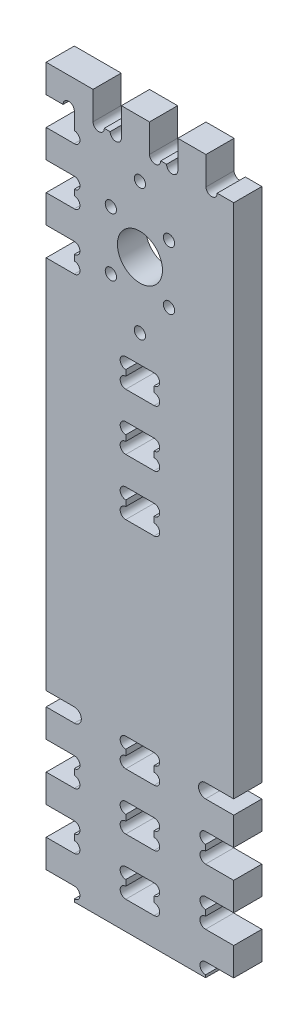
ISO-10303-21;
HEADER;
FILE_DESCRIPTION(('STEP AP214'),'2;1');
FILE_NAME('part.step','',(''),(''),'','','');
FILE_SCHEMA(('AUTOMOTIVE_DESIGN { 1 0 10303 214 1 1 1 1 }'));
ENDSEC;
DATA;
#1=APPLICATION_CONTEXT('core data for automotive mechanical design processes');
#2=APPLICATION_PROTOCOL_DEFINITION('international standard','automotive_design',2000,#1);
#3=PRODUCT_CONTEXT('',#1,'mechanical');
#4=PRODUCT('Part','Part','',(#3));
#5=PRODUCT_RELATED_PRODUCT_CATEGORY('part','',(#4));
#6=PRODUCT_DEFINITION_FORMATION('','',#4);
#7=PRODUCT_DEFINITION_CONTEXT('part definition',#1,'design');
#8=PRODUCT_DEFINITION('design','',#6,#7);
#9=PRODUCT_DEFINITION_SHAPE('','',#8);
#10=(LENGTH_UNIT() NAMED_UNIT(*) SI_UNIT(.MILLI.,.METRE.));
#11=(NAMED_UNIT(*) PLANE_ANGLE_UNIT() SI_UNIT($,.RADIAN.));
#12=(NAMED_UNIT(*) SI_UNIT($,.STERADIAN.) SOLID_ANGLE_UNIT());
#13=UNCERTAINTY_MEASURE_WITH_UNIT(LENGTH_MEASURE(1.E-05),#10,'distance_accuracy_value','');
#14=(GEOMETRIC_REPRESENTATION_CONTEXT(3) GLOBAL_UNCERTAINTY_ASSIGNED_CONTEXT((#13)) GLOBAL_UNIT_ASSIGNED_CONTEXT((#10,
#11,#12)) REPRESENTATION_CONTEXT('',''));
#15=CARTESIAN_POINT('',(0.,0.,0.));
#16=DIRECTION('',(0.,0.,1.));
#17=DIRECTION('',(1.,0.,0.));
#18=AXIS2_PLACEMENT_3D('',#15,#16,#17);
#19=CARTESIAN_POINT('',(15.,86.35,15.));
#20=DIRECTION('',(0.,0.,1.));
#21=DIRECTION('',(1.,0.,0.));
#22=AXIS2_PLACEMENT_3D('',#19,#20,#21);
#23=PLANE('',#22);
#24=DIRECTION('',(0.,-1.,0.));
#25=VECTOR('',#24,1.);
#26=CARTESIAN_POINT('',(42.4499999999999,0.,15.));
#27=LINE('',#26,#25);
#28=CARTESIAN_POINT('',(42.4499999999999,84.3,15.));
#29=VERTEX_POINT('',#28);
#30=CARTESIAN_POINT('',(42.4499999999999,81.2,15.));
#31=VERTEX_POINT('',#30);
#32=EDGE_CURVE('E851',#29,#31,#27,.T.);
#33=ORIENTED_EDGE('',*,*,#32,.F.);
#34=CARTESIAN_POINT('',(42.4499999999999,87.3,15.));
#35=DIRECTION('',(0.,0.,1.));
#36=DIRECTION('',(1.,0.,0.));
#37=AXIS2_PLACEMENT_3D('',#34,#35,#36);
#38=CIRCLE('',#37,3.);
#39=CARTESIAN_POINT('',(42.4499999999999,90.3,15.));
#40=VERTEX_POINT('',#39);
#41=EDGE_CURVE('E854',#29,#40,#38,.F.);
#42=ORIENTED_EDGE('',*,*,#41,.T.);
#43=DIRECTION('',(1.,0.,0.));
#44=VECTOR('',#43,1.);
#45=CARTESIAN_POINT('',(0.,90.3,15.));
#46=LINE('',#45,#44);
#47=CARTESIAN_POINT('',(57.5499999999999,90.3,15.));
#48=VERTEX_POINT('',#47);
#49=EDGE_CURVE('E822',#40,#48,#46,.T.);
#50=ORIENTED_EDGE('',*,*,#49,.T.);
#51=CARTESIAN_POINT('',(57.5499999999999,87.3,15.));
#52=DIRECTION('',(0.,0.,1.));
#53=DIRECTION('',(1.,0.,0.));
#54=AXIS2_PLACEMENT_3D('',#51,#52,#53);
#55=CIRCLE('',#54,3.);
#56=CARTESIAN_POINT('',(57.5499999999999,84.3,15.));
#57=VERTEX_POINT('',#56);
#58=EDGE_CURVE('E836',#48,#57,#55,.F.);
#59=ORIENTED_EDGE('',*,*,#58,.T.);
#60=DIRECTION('',(0.,1.,0.));
#61=VECTOR('',#60,1.);
#62=CARTESIAN_POINT('',(57.5499999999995,-2.57634415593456E-13,15.));
#63=LINE('',#62,#61);
#64=CARTESIAN_POINT('',(57.5499999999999,81.2,15.));
#65=VERTEX_POINT('',#64);
#66=EDGE_CURVE('E839',#65,#57,#63,.T.);
#67=ORIENTED_EDGE('',*,*,#66,.F.);
#68=CARTESIAN_POINT('',(57.5499999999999,78.2,15.));
#69=DIRECTION('',(0.,0.,1.));
#70=DIRECTION('',(1.,0.,0.));
#71=AXIS2_PLACEMENT_3D('',#68,#69,#70);
#72=CIRCLE('',#71,3.);
#73=CARTESIAN_POINT('',(57.5499999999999,75.2,15.));
#74=VERTEX_POINT('',#73);
#75=EDGE_CURVE('E842',#65,#74,#72,.F.);
#76=ORIENTED_EDGE('',*,*,#75,.T.);
#77=DIRECTION('',(1.,0.,0.));
#78=VECTOR('',#77,1.);
#79=CARTESIAN_POINT('',(0.,75.2,15.));
#80=LINE('',#79,#78);
#81=CARTESIAN_POINT('',(42.4499999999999,75.2,15.));
#82=VERTEX_POINT('',#81);
#83=EDGE_CURVE('E845',#82,#74,#80,.T.);
#84=ORIENTED_EDGE('',*,*,#83,.F.);
#85=CARTESIAN_POINT('',(42.4499999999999,78.2,15.));
#86=DIRECTION('',(0.,0.,1.));
#87=DIRECTION('',(1.,0.,0.));
#88=AXIS2_PLACEMENT_3D('',#85,#86,#87);
#89=CIRCLE('',#88,3.);
#90=EDGE_CURVE('E848',#31,#82,#89,.T.);
#91=ORIENTED_EDGE('',*,*,#90,.F.);
#92=EDGE_LOOP('',(#33,#42,#50,#59,#67,#76,#84,#91));
#93=FACE_BOUND('',#92,.T.);
#94=DIRECTION('',(0.,-1.,0.));
#95=VECTOR('',#94,1.);
#96=CARTESIAN_POINT('',(42.4500000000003,0.,15.));
#97=LINE('',#96,#95);
#98=CARTESIAN_POINT('',(42.4499999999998,229.5,15.));
#99=VERTEX_POINT('',#98);
#100=CARTESIAN_POINT('',(42.4499999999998,226.4,15.));
#101=VERTEX_POINT('',#100);
#102=EDGE_CURVE('E933',#99,#101,#97,.T.);
#103=ORIENTED_EDGE('',*,*,#102,.F.);
#104=CARTESIAN_POINT('',(42.4499999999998,232.5,15.));
#105=DIRECTION('',(0.,0.,1.));
#106=DIRECTION('',(1.,0.,0.));
#107=AXIS2_PLACEMENT_3D('',#104,#105,#106);
#108=CIRCLE('',#107,3.);
#109=CARTESIAN_POINT('',(42.4499999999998,235.5,15.));
#110=VERTEX_POINT('',#109);
#111=EDGE_CURVE('E936',#99,#110,#108,.F.);
#112=ORIENTED_EDGE('',*,*,#111,.T.);
#113=DIRECTION('',(1.,0.,0.));
#114=VECTOR('',#113,1.);
#115=CARTESIAN_POINT('',(0.,235.5,15.));
#116=LINE('',#115,#114);
#117=CARTESIAN_POINT('',(57.5499999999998,235.5,15.));
#118=VERTEX_POINT('',#117);
#119=EDGE_CURVE('E902',#110,#118,#116,.T.);
#120=ORIENTED_EDGE('',*,*,#119,.T.);
#121=CARTESIAN_POINT('',(57.5499999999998,232.5,15.));
#122=DIRECTION('',(0.,0.,1.));
#123=DIRECTION('',(1.,0.,0.));
#124=AXIS2_PLACEMENT_3D('',#121,#122,#123);
#125=CIRCLE('',#124,2.99999999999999);
#126=CARTESIAN_POINT('',(57.5499999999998,229.5,15.));
#127=VERTEX_POINT('',#126);
#128=EDGE_CURVE('E918',#118,#127,#125,.F.);
#129=ORIENTED_EDGE('',*,*,#128,.T.);
#130=DIRECTION('',(0.,1.,0.));
#131=VECTOR('',#130,1.);
#132=CARTESIAN_POINT('',(57.5499999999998,0.,15.));
#133=LINE('',#132,#131);
#134=CARTESIAN_POINT('',(57.5499999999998,226.4,15.));
#135=VERTEX_POINT('',#134);
#136=EDGE_CURVE('E921',#135,#127,#133,.T.);
#137=ORIENTED_EDGE('',*,*,#136,.F.);
#138=CARTESIAN_POINT('',(57.5499999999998,223.4,15.));
#139=DIRECTION('',(0.,0.,1.));
#140=DIRECTION('',(1.,0.,0.));
#141=AXIS2_PLACEMENT_3D('',#138,#139,#140);
#142=CIRCLE('',#141,3.00000000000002);
#143=CARTESIAN_POINT('',(57.5499999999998,220.4,15.));
#144=VERTEX_POINT('',#143);
#145=EDGE_CURVE('E924',#135,#144,#142,.F.);
#146=ORIENTED_EDGE('',*,*,#145,.T.);
#147=DIRECTION('',(1.,0.,0.));
#148=VECTOR('',#147,1.);
#149=CARTESIAN_POINT('',(0.,220.4,15.));
#150=LINE('',#149,#148);
#151=CARTESIAN_POINT('',(42.4499999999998,220.4,15.));
#152=VERTEX_POINT('',#151);
#153=EDGE_CURVE('E927',#152,#144,#150,.T.);
#154=ORIENTED_EDGE('',*,*,#153,.F.);
#155=CARTESIAN_POINT('',(42.4499999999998,223.4,15.));
#156=DIRECTION('',(0.,0.,1.));
#157=DIRECTION('',(1.,0.,0.));
#158=AXIS2_PLACEMENT_3D('',#155,#156,#157);
#159=CIRCLE('',#158,3.);
#160=EDGE_CURVE('E930',#101,#152,#159,.T.);
#161=ORIENTED_EDGE('',*,*,#160,.F.);
#162=EDGE_LOOP('',(#103,#112,#120,#129,#137,#146,#154,#161));
#163=FACE_BOUND('',#162,.T.);
#164=DIRECTION('',(0.,-1.,0.));
#165=VECTOR('',#164,1.);
#166=CARTESIAN_POINT('',(42.45,0.,15.));
#167=LINE('',#166,#165);
#168=CARTESIAN_POINT('',(42.45,24.1,15.));
#169=VERTEX_POINT('',#168);
#170=CARTESIAN_POINT('',(42.45,21.,15.));
#171=VERTEX_POINT('',#170);
#172=EDGE_CURVE('E983',#169,#171,#167,.T.);
#173=ORIENTED_EDGE('',*,*,#172,.F.);
#174=CARTESIAN_POINT('',(42.45,27.1,15.));
#175=DIRECTION('',(0.,0.,1.));
#176=DIRECTION('',(1.,0.,0.));
#177=AXIS2_PLACEMENT_3D('',#174,#175,#176);
#178=CIRCLE('',#177,3.);
#179=CARTESIAN_POINT('',(42.45,30.1,15.));
#180=VERTEX_POINT('',#179);
#181=EDGE_CURVE('E980',#169,#180,#178,.F.);
#182=ORIENTED_EDGE('',*,*,#181,.T.);
#183=DIRECTION('',(1.,0.,0.));
#184=VECTOR('',#183,1.);
#185=CARTESIAN_POINT('',(0.,30.1,15.));
#186=LINE('',#185,#184);
#187=CARTESIAN_POINT('',(57.55,30.1,15.));
#188=VERTEX_POINT('',#187);
#189=EDGE_CURVE('E1001',#180,#188,#186,.T.);
#190=ORIENTED_EDGE('',*,*,#189,.T.);
#191=CARTESIAN_POINT('',(57.55,27.1,15.));
#192=DIRECTION('',(0.,0.,1.));
#193=DIRECTION('',(1.,0.,0.));
#194=AXIS2_PLACEMENT_3D('',#191,#192,#193);
#195=CIRCLE('',#194,3.);
#196=CARTESIAN_POINT('',(57.55,24.1,15.));
#197=VERTEX_POINT('',#196);
#198=EDGE_CURVE('E998',#188,#197,#195,.F.);
#199=ORIENTED_EDGE('',*,*,#198,.T.);
#200=DIRECTION('',(0.,1.,0.));
#201=VECTOR('',#200,1.);
#202=CARTESIAN_POINT('',(57.5500000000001,2.57634415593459E-13,15.));
#203=LINE('',#202,#201);
#204=CARTESIAN_POINT('',(57.55,21.,15.));
#205=VERTEX_POINT('',#204);
#206=EDGE_CURVE('E995',#205,#197,#203,.T.);
#207=ORIENTED_EDGE('',*,*,#206,.F.);
#208=CARTESIAN_POINT('',(57.55,18.,15.));
#209=DIRECTION('',(0.,0.,1.));
#210=DIRECTION('',(1.,0.,0.));
#211=AXIS2_PLACEMENT_3D('',#208,#209,#210);
#212=CIRCLE('',#211,3.);
#213=CARTESIAN_POINT('',(57.55,15.,15.));
#214=VERTEX_POINT('',#213);
#215=EDGE_CURVE('E992',#205,#214,#212,.F.);
#216=ORIENTED_EDGE('',*,*,#215,.T.);
#217=DIRECTION('',(1.,0.,0.));
#218=VECTOR('',#217,1.);
#219=CARTESIAN_POINT('',(0.,15.,15.));
#220=LINE('',#219,#218);
#221=CARTESIAN_POINT('',(42.45,15.,15.));
#222=VERTEX_POINT('',#221);
#223=EDGE_CURVE('E989',#222,#214,#220,.T.);
#224=ORIENTED_EDGE('',*,*,#223,.F.);
#225=CARTESIAN_POINT('',(42.45,18.,15.));
#226=DIRECTION('',(0.,0.,1.));
#227=DIRECTION('',(1.,0.,0.));
#228=AXIS2_PLACEMENT_3D('',#225,#226,#227);
#229=CIRCLE('',#228,3.);
#230=EDGE_CURVE('E986',#171,#222,#229,.T.);
#231=ORIENTED_EDGE('',*,*,#230,.F.);
#232=EDGE_LOOP('',(#173,#182,#190,#199,#207,#216,#224,#231));
#233=FACE_BOUND('',#232,.T.);
#234=CARTESIAN_POINT('',(50.,280.270515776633,15.));
#235=DIRECTION('',(0.,0.,1.));
#236=DIRECTION('',(1.,0.,0.));
#237=AXIS2_PLACEMENT_3D('',#234,#235,#236);
#238=CIRCLE('',#237,3.);
#239=CARTESIAN_POINT('',(53.,280.270515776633,15.));
#240=VERTEX_POINT('',#239);
#241=EDGE_CURVE('E1022',#240,#240,#238,.T.);
#242=ORIENTED_EDGE('',*,*,#241,.F.);
#243=EDGE_LOOP('',(#242));
#244=FACE_BOUND('',#243,.T.);
#245=CARTESIAN_POINT('',(50.,350.270515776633,15.));
#246=DIRECTION('',(0.,0.,1.));
#247=DIRECTION('',(1.,0.,0.));
#248=AXIS2_PLACEMENT_3D('',#245,#246,#247);
#249=CIRCLE('',#248,3.);
#250=CARTESIAN_POINT('',(53.,350.270515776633,15.));
#251=VERTEX_POINT('',#250);
#252=EDGE_CURVE('E1026',#251,#251,#249,.T.);
#253=ORIENTED_EDGE('',*,*,#252,.F.);
#254=EDGE_LOOP('',(#253));
#255=FACE_BOUND('',#254,.T.);
#256=CARTESIAN_POINT('',(65.4999999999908,299.770515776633,15.));
#257=DIRECTION('',(0.,0.,1.));
#258=DIRECTION('',(1.,0.,0.));
#259=AXIS2_PLACEMENT_3D('',#256,#257,#258);
#260=CIRCLE('',#259,3.00000000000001);
#261=CARTESIAN_POINT('',(68.4999999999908,299.770515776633,15.));
#262=VERTEX_POINT('',#261);
#263=EDGE_CURVE('E1032',#262,#262,#260,.T.);
#264=ORIENTED_EDGE('',*,*,#263,.F.);
#265=EDGE_LOOP('',(#264));
#266=FACE_BOUND('',#265,.T.);
#267=CARTESIAN_POINT('',(34.5,299.770539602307,15.));
#268=DIRECTION('',(0.,0.,1.));
#269=DIRECTION('',(1.,0.,0.));
#270=AXIS2_PLACEMENT_3D('',#267,#268,#269);
#271=CIRCLE('',#270,3.);
#272=CARTESIAN_POINT('',(37.5,299.770539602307,15.));
#273=VERTEX_POINT('',#272);
#274=EDGE_CURVE('E1038',#273,#273,#271,.T.);
#275=ORIENTED_EDGE('',*,*,#274,.F.);
#276=EDGE_LOOP('',(#275));
#277=FACE_BOUND('',#276,.T.);
#278=CARTESIAN_POINT('',(34.5000000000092,330.770539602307,15.));
#279=DIRECTION('',(0.,0.,1.));
#280=DIRECTION('',(1.,0.,0.));
#281=AXIS2_PLACEMENT_3D('',#278,#279,#280);
#282=CIRCLE('',#281,3.);
#283=CARTESIAN_POINT('',(37.5000000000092,330.770539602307,15.));
#284=VERTEX_POINT('',#283);
#285=EDGE_CURVE('E1044',#284,#284,#282,.T.);
#286=ORIENTED_EDGE('',*,*,#285,.F.);
#287=EDGE_LOOP('',(#286));
#288=FACE_BOUND('',#287,.T.);
#289=CARTESIAN_POINT('',(65.5,330.770515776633,15.));
#290=DIRECTION('',(0.,0.,1.));
#291=DIRECTION('',(1.,0.,0.));
#292=AXIS2_PLACEMENT_3D('',#289,#290,#291);
#293=CIRCLE('',#292,3.00000000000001);
#294=CARTESIAN_POINT('',(68.5,330.770515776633,15.));
#295=VERTEX_POINT('',#294);
#296=EDGE_CURVE('E1050',#295,#295,#293,.T.);
#297=ORIENTED_EDGE('',*,*,#296,.F.);
#298=EDGE_LOOP('',(#297));
#299=FACE_BOUND('',#298,.T.);
#300=CARTESIAN_POINT('',(50.,315.270515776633,15.));
#301=DIRECTION('',(0.,0.,1.));
#302=DIRECTION('',(1.,0.,0.));
#303=AXIS2_PLACEMENT_3D('',#300,#301,#302);
#304=CIRCLE('',#303,12.);
#305=CARTESIAN_POINT('',(62.,315.270515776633,15.));
#306=VERTEX_POINT('',#305);
#307=EDGE_CURVE('E1056',#306,#306,#304,.T.);
#308=ORIENTED_EDGE('',*,*,#307,.F.);
#309=EDGE_LOOP('',(#308));
#310=FACE_BOUND('',#309,.T.);
#311=CARTESIAN_POINT('',(15.,86.35,15.));
#312=DIRECTION('',(0.,0.,-1.));
#313=DIRECTION('',(1.,0.,0.));
#314=AXIS2_PLACEMENT_3D('',#311,#312,#313);
#315=CIRCLE('',#314,3.75);
#316=CARTESIAN_POINT('',(15.,90.1,15.));
#317=VERTEX_POINT('',#316);
#318=CARTESIAN_POINT('',(15.,82.6,15.));
#319=VERTEX_POINT('',#318);
#320=EDGE_CURVE('E1072',#317,#319,#315,.T.);
#321=ORIENTED_EDGE('',*,*,#320,.T.);
#322=DIRECTION('',(-1.,0.,0.));
#323=VECTOR('',#322,1.);
#324=CARTESIAN_POINT('',(0.,82.6,15.));
#325=LINE('',#324,#323);
#326=CARTESIAN_POINT('',(0.,82.6,15.));
#327=VERTEX_POINT('',#326);
#328=EDGE_CURVE('E1075',#319,#327,#325,.T.);
#329=ORIENTED_EDGE('',*,*,#328,.T.);
#330=DIRECTION('',(0.,-1.,0.));
#331=VECTOR('',#330,1.);
#332=CARTESIAN_POINT('',(0.,82.6,15.));
#333=LINE('',#332,#331);
#334=CARTESIAN_POINT('',(0.,67.6,15.));
#335=VERTEX_POINT('',#334);
#336=EDGE_CURVE('E1078',#327,#335,#333,.T.);
#337=ORIENTED_EDGE('',*,*,#336,.T.);
#338=DIRECTION('',(1.,0.,0.));
#339=VECTOR('',#338,1.);
#340=CARTESIAN_POINT('',(0.,67.6,15.));
#341=LINE('',#340,#339);
#342=CARTESIAN_POINT('',(15.,67.6,15.));
#343=VERTEX_POINT('',#342);
#344=EDGE_CURVE('E1080',#335,#343,#341,.T.);
#345=ORIENTED_EDGE('',*,*,#344,.T.);
#346=CARTESIAN_POINT('',(15.,64.6,15.));
#347=DIRECTION('',(0.,0.,-1.));
#348=DIRECTION('',(-1.,0.,0.));
#349=AXIS2_PLACEMENT_3D('',#346,#347,#348);
#350=CIRCLE('',#349,3.);
#351=CARTESIAN_POINT('',(15.,61.6,15.));
#352=VERTEX_POINT('',#351);
#353=EDGE_CURVE('E1082',#343,#352,#350,.T.);
#354=ORIENTED_EDGE('',*,*,#353,.T.);
#355=DIRECTION('',(0.,-1.,0.));
#356=VECTOR('',#355,1.);
#357=CARTESIAN_POINT('',(15.,61.6,15.));
#358=LINE('',#357,#356);
#359=CARTESIAN_POINT('',(15.,58.5,15.));
#360=VERTEX_POINT('',#359);
#361=EDGE_CURVE('E1084',#352,#360,#358,.T.);
#362=ORIENTED_EDGE('',*,*,#361,.T.);
#363=CARTESIAN_POINT('',(15.,55.5,15.));
#364=DIRECTION('',(0.,0.,-1.));
#365=DIRECTION('',(-1.,0.,0.));
#366=AXIS2_PLACEMENT_3D('',#363,#364,#365);
#367=CIRCLE('',#366,3.);
#368=CARTESIAN_POINT('',(15.,52.5,15.));
#369=VERTEX_POINT('',#368);
#370=EDGE_CURVE('E1086',#360,#369,#367,.T.);
#371=ORIENTED_EDGE('',*,*,#370,.T.);
#372=DIRECTION('',(-1.,0.,0.));
#373=VECTOR('',#372,1.);
#374=CARTESIAN_POINT('',(15.,52.5,15.));
#375=LINE('',#374,#373);
#376=CARTESIAN_POINT('',(0.,52.5,15.));
#377=VERTEX_POINT('',#376);
#378=EDGE_CURVE('E1088',#369,#377,#375,.T.);
#379=ORIENTED_EDGE('',*,*,#378,.T.);
#380=DIRECTION('',(0.,-1.,0.));
#381=VECTOR('',#380,1.);
#382=CARTESIAN_POINT('',(0.,52.5,15.));
#383=LINE('',#382,#381);
#384=CARTESIAN_POINT('',(0.,37.5,15.));
#385=VERTEX_POINT('',#384);
#386=EDGE_CURVE('E1090',#377,#385,#383,.T.);
#387=ORIENTED_EDGE('',*,*,#386,.T.);
#388=DIRECTION('',(1.,0.,0.));
#389=VECTOR('',#388,1.);
#390=CARTESIAN_POINT('',(0.,37.5,15.));
#391=LINE('',#390,#389);
#392=CARTESIAN_POINT('',(15.,37.5,15.));
#393=VERTEX_POINT('',#392);
#394=EDGE_CURVE('E1092',#385,#393,#391,.T.);
#395=ORIENTED_EDGE('',*,*,#394,.T.);
#396=CARTESIAN_POINT('',(15.,34.5,15.));
#397=DIRECTION('',(0.,0.,-1.));
#398=DIRECTION('',(-1.,0.,0.));
#399=AXIS2_PLACEMENT_3D('',#396,#397,#398);
#400=CIRCLE('',#399,3.);
#401=CARTESIAN_POINT('',(15.,31.5,15.));
#402=VERTEX_POINT('',#401);
#403=EDGE_CURVE('E1094',#393,#402,#400,.T.);
#404=ORIENTED_EDGE('',*,*,#403,.T.);
#405=DIRECTION('',(0.,-1.,0.));
#406=VECTOR('',#405,1.);
#407=CARTESIAN_POINT('',(15.,31.5,15.));
#408=LINE('',#407,#406);
#409=CARTESIAN_POINT('',(15.,28.4,15.));
#410=VERTEX_POINT('',#409);
#411=EDGE_CURVE('E1096',#402,#410,#408,.T.);
#412=ORIENTED_EDGE('',*,*,#411,.T.);
#413=CARTESIAN_POINT('',(15.,25.4,15.));
#414=DIRECTION('',(0.,0.,-1.));
#415=DIRECTION('',(-1.,0.,0.));
#416=AXIS2_PLACEMENT_3D('',#413,#414,#415);
#417=CIRCLE('',#416,3.);
#418=CARTESIAN_POINT('',(15.,22.4,15.));
#419=VERTEX_POINT('',#418);
#420=EDGE_CURVE('E1098',#410,#419,#417,.T.);
#421=ORIENTED_EDGE('',*,*,#420,.T.);
#422=DIRECTION('',(-1.,0.,0.));
#423=VECTOR('',#422,1.);
#424=CARTESIAN_POINT('',(15.,22.4,15.));
#425=LINE('',#424,#423);
#426=CARTESIAN_POINT('',(0.,22.4,15.));
#427=VERTEX_POINT('',#426);
#428=EDGE_CURVE('E1100',#419,#427,#425,.T.);
#429=ORIENTED_EDGE('',*,*,#428,.T.);
#430=DIRECTION('',(0.,-1.,0.));
#431=VECTOR('',#430,1.);
#432=CARTESIAN_POINT('',(0.,22.4,15.));
#433=LINE('',#432,#431);
#434=CARTESIAN_POINT('',(0.,7.4,15.));
#435=VERTEX_POINT('',#434);
#436=EDGE_CURVE('E1102',#427,#435,#433,.T.);
#437=ORIENTED_EDGE('',*,*,#436,.T.);
#438=DIRECTION('',(1.,0.,0.));
#439=VECTOR('',#438,1.);
#440=CARTESIAN_POINT('',(0.,7.4,15.));
#441=LINE('',#440,#439);
#442=CARTESIAN_POINT('',(15.,7.4,15.));
#443=VERTEX_POINT('',#442);
#444=EDGE_CURVE('E1104',#435,#443,#441,.T.);
#445=ORIENTED_EDGE('',*,*,#444,.T.);
#446=CARTESIAN_POINT('',(15.,4.4,15.));
#447=DIRECTION('',(0.,0.,-1.));
#448=DIRECTION('',(-1.,0.,0.));
#449=AXIS2_PLACEMENT_3D('',#446,#447,#448);
#450=CIRCLE('',#449,3.);
#451=CARTESIAN_POINT('',(15.,1.4,15.));
#452=VERTEX_POINT('',#451);
#453=EDGE_CURVE('E1106',#443,#452,#450,.T.);
#454=ORIENTED_EDGE('',*,*,#453,.T.);
#455=DIRECTION('',(0.,-1.,0.));
#456=VECTOR('',#455,1.);
#457=CARTESIAN_POINT('',(15.,1.4,15.));
#458=LINE('',#457,#456);
#459=CARTESIAN_POINT('',(15.,0.,15.));
#460=VERTEX_POINT('',#459);
#461=EDGE_CURVE('E1108',#452,#460,#458,.T.);
#462=ORIENTED_EDGE('',*,*,#461,.T.);
#463=DIRECTION('',(1.,0.,0.));
#464=VECTOR('',#463,1.);
#465=CARTESIAN_POINT('',(85.,0.,15.));
#466=LINE('',#465,#464);
#467=CARTESIAN_POINT('',(85.,0.,15.));
#468=VERTEX_POINT('',#467);
#469=EDGE_CURVE('E1110',#460,#468,#466,.T.);
#470=ORIENTED_EDGE('',*,*,#469,.T.);
#471=DIRECTION('',(0.,1.,0.));
#472=VECTOR('',#471,1.);
#473=CARTESIAN_POINT('',(85.,1.39999999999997,15.));
#474=LINE('',#473,#472);
#475=CARTESIAN_POINT('',(85.,1.39999999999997,15.));
#476=VERTEX_POINT('',#475);
#477=EDGE_CURVE('E1112',#468,#476,#474,.T.);
#478=ORIENTED_EDGE('',*,*,#477,.T.);
#479=CARTESIAN_POINT('',(85.,4.39999999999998,15.));
#480=DIRECTION('',(0.,0.,-1.));
#481=DIRECTION('',(1.,0.,0.));
#482=AXIS2_PLACEMENT_3D('',#479,#480,#481);
#483=CIRCLE('',#482,3.00000000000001);
#484=CARTESIAN_POINT('',(85.,7.39999999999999,15.));
#485=VERTEX_POINT('',#484);
#486=EDGE_CURVE('E1114',#476,#485,#483,.T.);
#487=ORIENTED_EDGE('',*,*,#486,.T.);
#488=DIRECTION('',(1.,0.,0.));
#489=VECTOR('',#488,1.);
#490=CARTESIAN_POINT('',(100.,7.4,15.));
#491=LINE('',#490,#489);
#492=CARTESIAN_POINT('',(100.,7.4,15.));
#493=VERTEX_POINT('',#492);
#494=EDGE_CURVE('E1116',#485,#493,#491,.T.);
#495=ORIENTED_EDGE('',*,*,#494,.T.);
#496=DIRECTION('',(0.,1.,0.));
#497=VECTOR('',#496,1.);
#498=CARTESIAN_POINT('',(100.,22.4,15.));
#499=LINE('',#498,#497);
#500=CARTESIAN_POINT('',(100.,22.4,15.));
#501=VERTEX_POINT('',#500);
#502=EDGE_CURVE('E1118',#493,#501,#499,.T.);
#503=ORIENTED_EDGE('',*,*,#502,.T.);
#504=DIRECTION('',(-1.,0.,0.));
#505=VECTOR('',#504,1.);
#506=CARTESIAN_POINT('',(85.,22.4,15.));
#507=LINE('',#506,#505);
#508=CARTESIAN_POINT('',(85.,22.4,15.));
#509=VERTEX_POINT('',#508);
#510=EDGE_CURVE('E1120',#501,#509,#507,.T.);
#511=ORIENTED_EDGE('',*,*,#510,.T.);
#512=CARTESIAN_POINT('',(85.0000000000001,25.4,15.));
#513=DIRECTION('',(0.,0.,-1.));
#514=DIRECTION('',(-1.,0.,0.));
#515=AXIS2_PLACEMENT_3D('',#512,#513,#514);
#516=CIRCLE('',#515,3.);
#517=CARTESIAN_POINT('',(85.0000000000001,28.4,15.));
#518=VERTEX_POINT('',#517);
#519=EDGE_CURVE('E1122',#509,#518,#516,.T.);
#520=ORIENTED_EDGE('',*,*,#519,.T.);
#521=DIRECTION('',(0.,1.,0.));
#522=VECTOR('',#521,1.);
#523=CARTESIAN_POINT('',(85.,31.5,15.));
#524=LINE('',#523,#522);
#525=CARTESIAN_POINT('',(85.,31.5,15.));
#526=VERTEX_POINT('',#525);
#527=EDGE_CURVE('E1124',#518,#526,#524,.T.);
#528=ORIENTED_EDGE('',*,*,#527,.T.);
#529=CARTESIAN_POINT('',(85.,34.5,15.));
#530=DIRECTION('',(0.,0.,-1.));
#531=DIRECTION('',(-1.,0.,0.));
#532=AXIS2_PLACEMENT_3D('',#529,#530,#531);
#533=CIRCLE('',#532,3.);
#534=CARTESIAN_POINT('',(85.,37.5,15.));
#535=VERTEX_POINT('',#534);
#536=EDGE_CURVE('E1126',#526,#535,#533,.T.);
#537=ORIENTED_EDGE('',*,*,#536,.T.);
#538=DIRECTION('',(1.,0.,0.));
#539=VECTOR('',#538,1.);
#540=CARTESIAN_POINT('',(100.,37.5,15.));
#541=LINE('',#540,#539);
#542=CARTESIAN_POINT('',(100.,37.5,15.));
#543=VERTEX_POINT('',#542);
#544=EDGE_CURVE('E1128',#535,#543,#541,.T.);
#545=ORIENTED_EDGE('',*,*,#544,.T.);
#546=DIRECTION('',(0.,1.,0.));
#547=VECTOR('',#546,1.);
#548=CARTESIAN_POINT('',(100.,52.5,15.));
#549=LINE('',#548,#547);
#550=CARTESIAN_POINT('',(100.,52.5,15.));
#551=VERTEX_POINT('',#550);
#552=EDGE_CURVE('E1130',#543,#551,#549,.T.);
#553=ORIENTED_EDGE('',*,*,#552,.T.);
#554=DIRECTION('',(-1.,0.,0.));
#555=VECTOR('',#554,1.);
#556=CARTESIAN_POINT('',(85.,52.5,15.));
#557=LINE('',#556,#555);
#558=CARTESIAN_POINT('',(85.,52.5,15.));
#559=VERTEX_POINT('',#558);
#560=EDGE_CURVE('E1132',#551,#559,#557,.T.);
#561=ORIENTED_EDGE('',*,*,#560,.T.);
#562=CARTESIAN_POINT('',(85.,55.5,15.));
#563=DIRECTION('',(0.,0.,-1.));
#564=DIRECTION('',(-1.,0.,0.));
#565=AXIS2_PLACEMENT_3D('',#562,#563,#564);
#566=CIRCLE('',#565,3.);
#567=CARTESIAN_POINT('',(85.,58.5,15.));
#568=VERTEX_POINT('',#567);
#569=EDGE_CURVE('E1134',#559,#568,#566,.T.);
#570=ORIENTED_EDGE('',*,*,#569,.T.);
#571=DIRECTION('',(0.,1.,0.));
#572=VECTOR('',#571,1.);
#573=CARTESIAN_POINT('',(85.,61.6,15.));
#574=LINE('',#573,#572);
#575=CARTESIAN_POINT('',(85.,61.6,15.));
#576=VERTEX_POINT('',#575);
#577=EDGE_CURVE('E1136',#568,#576,#574,.T.);
#578=ORIENTED_EDGE('',*,*,#577,.T.);
#579=CARTESIAN_POINT('',(85.,64.6,15.));
#580=DIRECTION('',(0.,0.,-1.));
#581=DIRECTION('',(-1.,0.,0.));
#582=AXIS2_PLACEMENT_3D('',#579,#580,#581);
#583=CIRCLE('',#582,3.);
#584=CARTESIAN_POINT('',(85.,67.6,15.));
#585=VERTEX_POINT('',#584);
#586=EDGE_CURVE('E1138',#576,#585,#583,.T.);
#587=ORIENTED_EDGE('',*,*,#586,.T.);
#588=DIRECTION('',(1.,0.,0.));
#589=VECTOR('',#588,1.);
#590=CARTESIAN_POINT('',(100.,67.6,15.));
#591=LINE('',#590,#589);
#592=CARTESIAN_POINT('',(100.,67.6,15.));
#593=VERTEX_POINT('',#592);
#594=EDGE_CURVE('E1140',#585,#593,#591,.T.);
#595=ORIENTED_EDGE('',*,*,#594,.T.);
#596=DIRECTION('',(0.,1.,0.));
#597=VECTOR('',#596,1.);
#598=CARTESIAN_POINT('',(100.,82.6,15.));
#599=LINE('',#598,#597);
#600=CARTESIAN_POINT('',(100.,82.6,15.));
#601=VERTEX_POINT('',#600);
#602=EDGE_CURVE('E1142',#593,#601,#599,.T.);
#603=ORIENTED_EDGE('',*,*,#602,.T.);
#604=DIRECTION('',(-1.,0.,0.));
#605=VECTOR('',#604,1.);
#606=CARTESIAN_POINT('',(85.,82.6,15.));
#607=LINE('',#606,#605);
#608=CARTESIAN_POINT('',(85.,82.6,15.));
#609=VERTEX_POINT('',#608);
#610=EDGE_CURVE('E1144',#601,#609,#607,.T.);
#611=ORIENTED_EDGE('',*,*,#610,.T.);
#612=CARTESIAN_POINT('',(85.,86.35,15.));
#613=DIRECTION('',(0.,0.,-1.));
#614=DIRECTION('',(-1.,0.,0.));
#615=AXIS2_PLACEMENT_3D('',#612,#613,#614);
#616=CIRCLE('',#615,3.75);
#617=CARTESIAN_POINT('',(85.,90.1,15.));
#618=VERTEX_POINT('',#617);
#619=EDGE_CURVE('E1146',#609,#618,#616,.T.);
#620=ORIENTED_EDGE('',*,*,#619,.T.);
#621=DIRECTION('',(1.,0.,0.));
#622=VECTOR('',#621,1.);
#623=CARTESIAN_POINT('',(85.,90.1,15.));
#624=LINE('',#623,#622);
#625=CARTESIAN_POINT('',(100.,90.1,15.));
#626=VERTEX_POINT('',#625);
#627=EDGE_CURVE('E1148',#618,#626,#624,.T.);
#628=ORIENTED_EDGE('',*,*,#627,.T.);
#629=DIRECTION('',(0.,1.,0.));
#630=VECTOR('',#629,1.);
#631=CARTESIAN_POINT('',(100.,90.1,15.));
#632=LINE('',#631,#630);
#633=CARTESIAN_POINT('',(100.,365.4,15.));
#634=VERTEX_POINT('',#633);
#635=EDGE_CURVE('E1150',#626,#634,#632,.T.);
#636=ORIENTED_EDGE('',*,*,#635,.T.);
#637=DIRECTION('',(-1.,0.,0.));
#638=VECTOR('',#637,1.);
#639=CARTESIAN_POINT('',(91.1999999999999,365.4,15.));
#640=LINE('',#639,#638);
#641=CARTESIAN_POINT('',(91.1999999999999,365.4,15.));
#642=VERTEX_POINT('',#641);
#643=EDGE_CURVE('E1152',#634,#642,#640,.T.);
#644=ORIENTED_EDGE('',*,*,#643,.T.);
#645=CARTESIAN_POINT('',(88.1999999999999,365.335267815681,15.));
#646=DIRECTION('',(0.,0.,-1.));
#647=DIRECTION('',(-1.,0.,0.));
#648=AXIS2_PLACEMENT_3D('',#645,#646,#647);
#649=CIRCLE('',#648,3.00069829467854);
#650=CARTESIAN_POINT('',(85.2,365.270535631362,15.));
#651=VERTEX_POINT('',#650);
#652=EDGE_CURVE('E1154',#642,#651,#649,.T.);
#653=ORIENTED_EDGE('',*,*,#652,.T.);
#654=DIRECTION('',(0.,1.,0.));
#655=VECTOR('',#654,1.);
#656=CARTESIAN_POINT('',(85.1999999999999,380.270535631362,15.));
#657=LINE('',#656,#655);
#658=CARTESIAN_POINT('',(85.1999999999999,380.270535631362,15.));
#659=VERTEX_POINT('',#658);
#660=EDGE_CURVE('E1156',#651,#659,#657,.T.);
#661=ORIENTED_EDGE('',*,*,#660,.T.);
#662=DIRECTION('',(-1.,0.,0.));
#663=VECTOR('',#662,1.);
#664=CARTESIAN_POINT('',(70.1999999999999,380.270535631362,15.));
#665=LINE('',#664,#663);
#666=CARTESIAN_POINT('',(70.1999999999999,380.270535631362,15.));
#667=VERTEX_POINT('',#666);
#668=EDGE_CURVE('E1158',#659,#667,#665,.T.);
#669=ORIENTED_EDGE('',*,*,#668,.T.);
#670=DIRECTION('',(0.,-1.,0.));
#671=VECTOR('',#670,1.);
#672=CARTESIAN_POINT('',(70.1999999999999,365.270535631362,15.));
#673=LINE('',#672,#671);
#674=CARTESIAN_POINT('',(70.1999999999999,365.270535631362,15.));
#675=VERTEX_POINT('',#674);
#676=EDGE_CURVE('E1160',#667,#675,#673,.T.);
#677=ORIENTED_EDGE('',*,*,#676,.T.);
#678=CARTESIAN_POINT('',(67.1999999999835,365.270535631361,15.));
#679=DIRECTION('',(0.,0.,-1.));
#680=DIRECTION('',(-1.,0.,0.));
#681=AXIS2_PLACEMENT_3D('',#678,#679,#680);
#682=CIRCLE('',#681,3.00000000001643);
#683=CARTESIAN_POINT('',(64.2000000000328,365.270515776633,15.));
#684=VERTEX_POINT('',#683);
#685=EDGE_CURVE('E1162',#675,#684,#682,.T.);
#686=ORIENTED_EDGE('',*,*,#685,.T.);
#687=DIRECTION('',(-1.,0.,0.));
#688=VECTOR('',#687,1.);
#689=CARTESIAN_POINT('',(61.0999999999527,365.270515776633,15.));
#690=LINE('',#689,#688);
#691=CARTESIAN_POINT('',(61.0999999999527,365.270515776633,15.));
#692=VERTEX_POINT('',#691);
#693=EDGE_CURVE('E1164',#684,#692,#690,.T.);
#694=ORIENTED_EDGE('',*,*,#693,.T.);
#695=CARTESIAN_POINT('',(58.1000000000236,365.270539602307,15.));
#696=DIRECTION('',(0.,0.,-1.));
#697=DIRECTION('',(-1.,0.,0.));
#698=AXIS2_PLACEMENT_3D('',#695,#696,#697);
#699=CIRCLE('',#698,3.00000000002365);
#700=CARTESIAN_POINT('',(55.1,365.270539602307,15.));
#701=VERTEX_POINT('',#700);
#702=EDGE_CURVE('E1166',#692,#701,#699,.T.);
#703=ORIENTED_EDGE('',*,*,#702,.T.);
#704=DIRECTION('',(0.,1.,0.));
#705=VECTOR('',#704,1.);
#706=CARTESIAN_POINT('',(55.1,380.270539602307,15.));
#707=LINE('',#706,#705);
#708=CARTESIAN_POINT('',(55.1,380.270539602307,15.));
#709=VERTEX_POINT('',#708);
#710=EDGE_CURVE('E1168',#701,#709,#707,.T.);
#711=ORIENTED_EDGE('',*,*,#710,.T.);
#712=DIRECTION('',(-1.,0.,0.));
#713=VECTOR('',#712,1.);
#714=CARTESIAN_POINT('',(40.1,380.270539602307,15.));
#715=LINE('',#714,#713);
#716=CARTESIAN_POINT('',(40.1,380.270539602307,15.));
#717=VERTEX_POINT('',#716);
#718=EDGE_CURVE('E1170',#709,#717,#715,.T.);
#719=ORIENTED_EDGE('',*,*,#718,.T.);
#720=DIRECTION('',(0.,-1.,0.));
#721=VECTOR('',#720,1.);
#722=CARTESIAN_POINT('',(40.1,365.270539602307,15.));
#723=LINE('',#722,#721);
#724=CARTESIAN_POINT('',(40.1,365.270539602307,15.));
#725=VERTEX_POINT('',#724);
#726=EDGE_CURVE('E1172',#717,#725,#723,.T.);
#727=ORIENTED_EDGE('',*,*,#726,.T.);
#728=CARTESIAN_POINT('',(37.0999999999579,365.270539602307,15.));
#729=DIRECTION('',(0.,0.,-1.));
#730=DIRECTION('',(-1.,0.,0.));
#731=AXIS2_PLACEMENT_3D('',#728,#729,#730);
#732=CIRCLE('',#731,3.00000000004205);
#733=CARTESIAN_POINT('',(34.1000000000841,365.270507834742,15.));
#734=VERTEX_POINT('',#733);
#735=EDGE_CURVE('E1174',#725,#734,#732,.T.);
#736=ORIENTED_EDGE('',*,*,#735,.T.);
#737=DIRECTION('',(-1.,0.,0.));
#738=VECTOR('',#737,1.);
#739=CARTESIAN_POINT('',(30.9999999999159,365.270507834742,15.));
#740=LINE('',#739,#738);
#741=CARTESIAN_POINT('',(30.9999999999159,365.270507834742,15.));
#742=VERTEX_POINT('',#741);
#743=EDGE_CURVE('E1176',#734,#742,#740,.T.);
#744=ORIENTED_EDGE('',*,*,#743,.T.);
#745=CARTESIAN_POINT('',(28.0000000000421,365.270539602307,15.));
#746=DIRECTION('',(0.,0.,-1.));
#747=DIRECTION('',(-1.,0.,0.));
#748=AXIS2_PLACEMENT_3D('',#745,#746,#747);
#749=CIRCLE('',#748,3.00000000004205);
#750=CARTESIAN_POINT('',(25.,365.270539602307,15.));
#751=VERTEX_POINT('',#750);
#752=EDGE_CURVE('E1178',#742,#751,#749,.T.);
#753=ORIENTED_EDGE('',*,*,#752,.T.);
#754=DIRECTION('',(0.,1.,0.));
#755=VECTOR('',#754,1.);
#756=CARTESIAN_POINT('',(25.,365.270539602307,15.));
#757=LINE('',#756,#755);
#758=CARTESIAN_POINT('',(25.,380.270539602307,15.));
#759=VERTEX_POINT('',#758);
#760=EDGE_CURVE('E1180',#751,#759,#757,.T.);
#761=ORIENTED_EDGE('',*,*,#760,.T.);
#762=DIRECTION('',(-1.,0.,0.));
#763=VECTOR('',#762,1.);
#764=CARTESIAN_POINT('',(0.,380.270539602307,15.));
#765=LINE('',#764,#763);
#766=CARTESIAN_POINT('',(0.,380.270539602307,15.));
#767=VERTEX_POINT('',#766);
#768=EDGE_CURVE('E1182',#759,#767,#765,.T.);
#769=ORIENTED_EDGE('',*,*,#768,.T.);
#770=DIRECTION('',(0.,-1.,0.));
#771=VECTOR('',#770,1.);
#772=CARTESIAN_POINT('',(0.,365.270539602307,15.));
#773=LINE('',#772,#771);
#774=CARTESIAN_POINT('',(0.,365.270539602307,15.));
#775=VERTEX_POINT('',#774);
#776=EDGE_CURVE('E1184',#767,#775,#773,.T.);
#777=ORIENTED_EDGE('',*,*,#776,.T.);
#778=DIRECTION('',(1.,0.,0.));
#779=VECTOR('',#778,1.);
#780=CARTESIAN_POINT('',(0.,365.270539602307,15.));
#781=LINE('',#780,#779);
#782=CARTESIAN_POINT('',(9.,365.270539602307,15.));
#783=VERTEX_POINT('',#782);
#784=EDGE_CURVE('E1186',#775,#783,#781,.T.);
#785=ORIENTED_EDGE('',*,*,#784,.T.);
#786=CARTESIAN_POINT('',(12.,365.270539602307,15.));
#787=DIRECTION('',(0.,0.,-1.));
#788=DIRECTION('',(1.,0.,0.));
#789=AXIS2_PLACEMENT_3D('',#786,#787,#788);
#790=CIRCLE('',#789,3.);
#791=CARTESIAN_POINT('',(15.,365.270539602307,15.));
#792=VERTEX_POINT('',#791);
#793=EDGE_CURVE('E1188',#783,#792,#790,.T.);
#794=ORIENTED_EDGE('',*,*,#793,.T.);
#795=DIRECTION('',(0.,-1.,0.));
#796=VECTOR('',#795,1.);
#797=CARTESIAN_POINT('',(15.,356.170539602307,15.));
#798=LINE('',#797,#796);
#799=CARTESIAN_POINT('',(15.,356.170539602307,15.));
#800=VERTEX_POINT('',#799);
#801=EDGE_CURVE('E1190',#792,#800,#798,.T.);
#802=ORIENTED_EDGE('',*,*,#801,.T.);
#803=CARTESIAN_POINT('',(15.,353.170539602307,15.));
#804=DIRECTION('',(0.,0.,-1.));
#805=DIRECTION('',(-1.,0.,0.));
#806=AXIS2_PLACEMENT_3D('',#803,#804,#805);
#807=CIRCLE('',#806,3.);
#808=CARTESIAN_POINT('',(15.,350.170539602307,15.));
#809=VERTEX_POINT('',#808);
#810=EDGE_CURVE('E1192',#800,#809,#807,.T.);
#811=ORIENTED_EDGE('',*,*,#810,.T.);
#812=DIRECTION('',(-1.,0.,0.));
#813=VECTOR('',#812,1.);
#814=CARTESIAN_POINT('',(15.,350.170539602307,15.));
#815=LINE('',#814,#813);
#816=CARTESIAN_POINT('',(0.,350.170539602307,15.));
#817=VERTEX_POINT('',#816);
#818=EDGE_CURVE('E1194',#809,#817,#815,.T.);
#819=ORIENTED_EDGE('',*,*,#818,.T.);
#820=DIRECTION('',(0.,-1.,0.));
#821=VECTOR('',#820,1.);
#822=CARTESIAN_POINT('',(0.,335.170539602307,15.));
#823=LINE('',#822,#821);
#824=CARTESIAN_POINT('',(0.,335.170539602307,15.));
#825=VERTEX_POINT('',#824);
#826=EDGE_CURVE('E1196',#817,#825,#823,.T.);
#827=ORIENTED_EDGE('',*,*,#826,.T.);
#828=DIRECTION('',(1.,0.,0.));
#829=VECTOR('',#828,1.);
#830=CARTESIAN_POINT('',(0.,335.170539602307,15.));
#831=LINE('',#830,#829);
#832=CARTESIAN_POINT('',(15.,335.170539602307,15.));
#833=VERTEX_POINT('',#832);
#834=EDGE_CURVE('E1198',#825,#833,#831,.T.);
#835=ORIENTED_EDGE('',*,*,#834,.T.);
#836=CARTESIAN_POINT('',(15.,332.170539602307,15.));
#837=DIRECTION('',(0.,0.,-1.));
#838=DIRECTION('',(-1.,0.,0.));
#839=AXIS2_PLACEMENT_3D('',#836,#837,#838);
#840=CIRCLE('',#839,3.);
#841=CARTESIAN_POINT('',(15.,329.170539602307,15.));
#842=VERTEX_POINT('',#841);
#843=EDGE_CURVE('E1200',#833,#842,#840,.T.);
#844=ORIENTED_EDGE('',*,*,#843,.T.);
#845=DIRECTION('',(0.,-1.,0.));
#846=VECTOR('',#845,1.);
#847=CARTESIAN_POINT('',(15.,326.070539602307,15.));
#848=LINE('',#847,#846);
#849=CARTESIAN_POINT('',(15.,326.070539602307,15.));
#850=VERTEX_POINT('',#849);
#851=EDGE_CURVE('E1202',#842,#850,#848,.T.);
#852=ORIENTED_EDGE('',*,*,#851,.T.);
#853=CARTESIAN_POINT('',(15.,323.070539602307,15.));
#854=DIRECTION('',(0.,0.,-1.));
#855=DIRECTION('',(-1.,0.,0.));
#856=AXIS2_PLACEMENT_3D('',#853,#854,#855);
#857=CIRCLE('',#856,3.);
#858=CARTESIAN_POINT('',(15.,320.070539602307,15.));
#859=VERTEX_POINT('',#858);
#860=EDGE_CURVE('E1204',#850,#859,#857,.T.);
#861=ORIENTED_EDGE('',*,*,#860,.T.);
#862=DIRECTION('',(-1.,0.,0.));
#863=VECTOR('',#862,1.);
#864=CARTESIAN_POINT('',(15.,320.070539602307,15.));
#865=LINE('',#864,#863);
#866=CARTESIAN_POINT('',(0.,320.070539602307,15.));
#867=VERTEX_POINT('',#866);
#868=EDGE_CURVE('E1206',#859,#867,#865,.T.);
#869=ORIENTED_EDGE('',*,*,#868,.T.);
#870=DIRECTION('',(0.,-1.,0.));
#871=VECTOR('',#870,1.);
#872=CARTESIAN_POINT('',(0.,305.070539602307,15.));
#873=LINE('',#872,#871);
#874=CARTESIAN_POINT('',(0.,305.070539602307,15.));
#875=VERTEX_POINT('',#874);
#876=EDGE_CURVE('E1208',#867,#875,#873,.T.);
#877=ORIENTED_EDGE('',*,*,#876,.T.);
#878=DIRECTION('',(1.,0.,0.));
#879=VECTOR('',#878,1.);
#880=CARTESIAN_POINT('',(0.,305.070539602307,15.));
#881=LINE('',#880,#879);
#882=CARTESIAN_POINT('',(15.,305.070539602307,15.));
#883=VERTEX_POINT('',#882);
#884=EDGE_CURVE('E1210',#875,#883,#881,.T.);
#885=ORIENTED_EDGE('',*,*,#884,.T.);
#886=CARTESIAN_POINT('',(15.,302.070539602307,15.));
#887=DIRECTION('',(0.,0.,-1.));
#888=DIRECTION('',(-1.,0.,0.));
#889=AXIS2_PLACEMENT_3D('',#886,#887,#888);
#890=CIRCLE('',#889,3.);
#891=CARTESIAN_POINT('',(15.,299.070539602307,15.));
#892=VERTEX_POINT('',#891);
#893=EDGE_CURVE('E1212',#883,#892,#890,.T.);
#894=ORIENTED_EDGE('',*,*,#893,.T.);
#895=DIRECTION('',(0.,-1.,0.));
#896=VECTOR('',#895,1.);
#897=CARTESIAN_POINT('',(15.,295.970539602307,15.));
#898=LINE('',#897,#896);
#899=CARTESIAN_POINT('',(15.,295.970539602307,15.));
#900=VERTEX_POINT('',#899);
#901=EDGE_CURVE('E1214',#892,#900,#898,.T.);
#902=ORIENTED_EDGE('',*,*,#901,.T.);
#903=CARTESIAN_POINT('',(15.,292.970539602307,15.));
#904=DIRECTION('',(0.,0.,-1.));
#905=DIRECTION('',(-1.,0.,0.));
#906=AXIS2_PLACEMENT_3D('',#903,#904,#905);
#907=CIRCLE('',#906,3.);
#908=CARTESIAN_POINT('',(15.,289.970539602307,15.));
#909=VERTEX_POINT('',#908);
#910=EDGE_CURVE('E1216',#900,#909,#907,.T.);
#911=ORIENTED_EDGE('',*,*,#910,.T.);
#912=DIRECTION('',(-1.,0.,0.));
#913=VECTOR('',#912,1.);
#914=CARTESIAN_POINT('',(15.,289.970539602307,15.));
#915=LINE('',#914,#913);
#916=CARTESIAN_POINT('',(0.,289.970539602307,15.));
#917=VERTEX_POINT('',#916);
#918=EDGE_CURVE('E1218',#909,#917,#915,.T.);
#919=ORIENTED_EDGE('',*,*,#918,.T.);
#920=DIRECTION('',(0.,-1.,0.));
#921=VECTOR('',#920,1.);
#922=CARTESIAN_POINT('',(0.,289.970539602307,15.));
#923=LINE('',#922,#921);
#924=CARTESIAN_POINT('',(0.,90.1,15.));
#925=VERTEX_POINT('',#924);
#926=EDGE_CURVE('E1220',#917,#925,#923,.T.);
#927=ORIENTED_EDGE('',*,*,#926,.T.);
#928=DIRECTION('',(1.,0.,0.));
#929=VECTOR('',#928,1.);
#930=CARTESIAN_POINT('',(0.,90.1,15.));
#931=LINE('',#930,#929);
#932=EDGE_CURVE('E1222',#925,#317,#931,.T.);
#933=ORIENTED_EDGE('',*,*,#932,.T.);
#934=EDGE_LOOP('',(#321,#329,#337,#345,#354,#362,#371,#379,#387,#395,#404,#412,#421,#429,#437,
#445,#454,#462,#470,#478,#487,#495,#503,#511,#520,#528,#537,#545,#553,#561,#570,#578,#587,#595,
#603,#611,#620,#628,#636,#644,#653,#661,#669,#677,#686,#694,#703,#711,#719,#727,#736,#744,#753,
#761,#769,#777,#785,#794,#802,#811,#819,#827,#835,#844,#852,#861,#869,#877,#885,#894,#902,#911,
#919,#927,#933));
#935=FACE_BOUND('',#934,.T.);
#936=DIRECTION('',(0.,-1.,0.));
#937=VECTOR('',#936,1.);
#938=CARTESIAN_POINT('',(42.4500000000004,0.,15.));
#939=LINE('',#938,#937);
#940=CARTESIAN_POINT('',(42.4499999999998,259.6,15.));
#941=VERTEX_POINT('',#940);
#942=CARTESIAN_POINT('',(42.4499999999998,256.5,15.));
#943=VERTEX_POINT('',#942);
#944=EDGE_CURVE('E974',#941,#943,#939,.T.);
#945=ORIENTED_EDGE('',*,*,#944,.F.);
#946=CARTESIAN_POINT('',(42.4499999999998,262.6,15.));
#947=DIRECTION('',(0.,0.,1.));
#948=DIRECTION('',(1.,0.,0.));
#949=AXIS2_PLACEMENT_3D('',#946,#947,#948);
#950=CIRCLE('',#949,3.);
#951=CARTESIAN_POINT('',(42.4499999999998,265.6,15.));
#952=VERTEX_POINT('',#951);
#953=EDGE_CURVE('E977',#941,#952,#950,.F.);
#954=ORIENTED_EDGE('',*,*,#953,.T.);
#955=DIRECTION('',(1.,0.,0.));
#956=VECTOR('',#955,1.);
#957=CARTESIAN_POINT('',(0.,265.6,15.));
#958=LINE('',#957,#956);
#959=CARTESIAN_POINT('',(57.5499999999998,265.6,15.));
#960=VERTEX_POINT('',#959);
#961=EDGE_CURVE('E943',#952,#960,#958,.T.);
#962=ORIENTED_EDGE('',*,*,#961,.T.);
#963=CARTESIAN_POINT('',(57.5499999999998,262.6,15.));
#964=DIRECTION('',(0.,0.,1.));
#965=DIRECTION('',(1.,0.,0.));
#966=AXIS2_PLACEMENT_3D('',#963,#964,#965);
#967=CIRCLE('',#966,3.);
#968=CARTESIAN_POINT('',(57.5499999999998,259.6,15.));
#969=VERTEX_POINT('',#968);
#970=EDGE_CURVE('E959',#960,#969,#967,.F.);
#971=ORIENTED_EDGE('',*,*,#970,.T.);
#972=DIRECTION('',(0.,1.,0.));
#973=VECTOR('',#972,1.);
#974=CARTESIAN_POINT('',(57.5499999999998,0.,15.));
#975=LINE('',#974,#973);
#976=CARTESIAN_POINT('',(57.5499999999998,256.5,15.));
#977=VERTEX_POINT('',#976);
#978=EDGE_CURVE('E962',#977,#969,#975,.T.);
#979=ORIENTED_EDGE('',*,*,#978,.F.);
#980=CARTESIAN_POINT('',(57.5499999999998,253.5,15.));
#981=DIRECTION('',(0.,0.,1.));
#982=DIRECTION('',(1.,0.,0.));
#983=AXIS2_PLACEMENT_3D('',#980,#981,#982);
#984=CIRCLE('',#983,3.);
#985=CARTESIAN_POINT('',(57.5499999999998,250.5,15.));
#986=VERTEX_POINT('',#985);
#987=EDGE_CURVE('E965',#977,#986,#984,.F.);
#988=ORIENTED_EDGE('',*,*,#987,.T.);
#989=DIRECTION('',(1.,0.,0.));
#990=VECTOR('',#989,1.);
#991=CARTESIAN_POINT('',(0.,250.5,15.));
#992=LINE('',#991,#990);
#993=CARTESIAN_POINT('',(42.4499999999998,250.5,15.));
#994=VERTEX_POINT('',#993);
#995=EDGE_CURVE('E968',#994,#986,#992,.T.);
#996=ORIENTED_EDGE('',*,*,#995,.F.);
#997=CARTESIAN_POINT('',(42.4499999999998,253.5,15.));
#998=DIRECTION('',(0.,0.,1.));
#999=DIRECTION('',(1.,0.,0.));
#1000=AXIS2_PLACEMENT_3D('',#997,#998,#999);
#1001=CIRCLE('',#1000,3.);
#1002=EDGE_CURVE('E971',#943,#994,#1001,.T.);
#1003=ORIENTED_EDGE('',*,*,#1002,.F.);
#1004=EDGE_LOOP('',(#945,#954,#962,#971,#979,#988,#996,#1003));
#1005=FACE_BOUND('',#1004,.T.);
#1006=DIRECTION('',(0.,-1.,0.));
#1007=VECTOR('',#1006,1.);
#1008=CARTESIAN_POINT('',(42.45,0.,15.));
#1009=LINE('',#1008,#1007);
#1010=CARTESIAN_POINT('',(42.4499999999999,54.2,15.));
#1011=VERTEX_POINT('',#1010);
#1012=CARTESIAN_POINT('',(42.4499999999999,51.1,15.));
#1013=VERTEX_POINT('',#1012);
#1014=EDGE_CURVE('E892',#1011,#1013,#1009,.T.);
#1015=ORIENTED_EDGE('',*,*,#1014,.F.);
#1016=CARTESIAN_POINT('',(42.4499999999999,57.2,15.));
#1017=DIRECTION('',(0.,0.,1.));
#1018=DIRECTION('',(1.,0.,0.));
#1019=AXIS2_PLACEMENT_3D('',#1016,#1017,#1018);
#1020=CIRCLE('',#1019,3.);
#1021=CARTESIAN_POINT('',(42.4499999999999,60.2,15.));
#1022=VERTEX_POINT('',#1021);
#1023=EDGE_CURVE('E895',#1011,#1022,#1020,.F.);
#1024=ORIENTED_EDGE('',*,*,#1023,.T.);
#1025=DIRECTION('',(1.,0.,0.));
#1026=VECTOR('',#1025,1.);
#1027=CARTESIAN_POINT('',(0.,60.2,15.));
#1028=LINE('',#1027,#1026);
#1029=CARTESIAN_POINT('',(57.5499999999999,60.2,15.));
#1030=VERTEX_POINT('',#1029);
#1031=EDGE_CURVE('E861',#1022,#1030,#1028,.T.);
#1032=ORIENTED_EDGE('',*,*,#1031,.T.);
#1033=CARTESIAN_POINT('',(57.5499999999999,57.2,15.));
#1034=DIRECTION('',(0.,0.,1.));
#1035=DIRECTION('',(1.,0.,0.));
#1036=AXIS2_PLACEMENT_3D('',#1033,#1034,#1035);
#1037=CIRCLE('',#1036,3.);
#1038=CARTESIAN_POINT('',(57.5499999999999,54.2,15.));
#1039=VERTEX_POINT('',#1038);
#1040=EDGE_CURVE('E877',#1030,#1039,#1037,.F.);
#1041=ORIENTED_EDGE('',*,*,#1040,.T.);
#1042=DIRECTION('',(0.,1.,0.));
#1043=VECTOR('',#1042,1.);
#1044=CARTESIAN_POINT('',(57.5499999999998,-1.28817207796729E-13,15.));
#1045=LINE('',#1044,#1043);
#1046=CARTESIAN_POINT('',(57.5499999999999,51.1,15.));
#1047=VERTEX_POINT('',#1046);
#1048=EDGE_CURVE('E880',#1047,#1039,#1045,.T.);
#1049=ORIENTED_EDGE('',*,*,#1048,.F.);
#1050=CARTESIAN_POINT('',(57.5499999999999,48.1,15.));
#1051=DIRECTION('',(0.,0.,1.));
#1052=DIRECTION('',(1.,0.,0.));
#1053=AXIS2_PLACEMENT_3D('',#1050,#1051,#1052);
#1054=CIRCLE('',#1053,3.);
#1055=CARTESIAN_POINT('',(57.5499999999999,45.1,15.));
#1056=VERTEX_POINT('',#1055);
#1057=EDGE_CURVE('E883',#1047,#1056,#1054,.F.);
#1058=ORIENTED_EDGE('',*,*,#1057,.T.);
#1059=DIRECTION('',(1.,0.,0.));
#1060=VECTOR('',#1059,1.);
#1061=CARTESIAN_POINT('',(0.,45.1,15.));
#1062=LINE('',#1061,#1060);
#1063=CARTESIAN_POINT('',(42.4499999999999,45.1,15.));
#1064=VERTEX_POINT('',#1063);
#1065=EDGE_CURVE('E886',#1064,#1056,#1062,.T.);
#1066=ORIENTED_EDGE('',*,*,#1065,.F.);
#1067=CARTESIAN_POINT('',(42.4499999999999,48.1,15.));
#1068=DIRECTION('',(0.,0.,1.));
#1069=DIRECTION('',(1.,0.,0.));
#1070=AXIS2_PLACEMENT_3D('',#1067,#1068,#1069);
#1071=CIRCLE('',#1070,3.);
#1072=EDGE_CURVE('E889',#1013,#1064,#1071,.T.);
#1073=ORIENTED_EDGE('',*,*,#1072,.F.);
#1074=EDGE_LOOP('',(#1015,#1024,#1032,#1041,#1049,#1058,#1066,#1073));
#1075=FACE_BOUND('',#1074,.T.);
#1076=DIRECTION('',(0.,-1.,0.));
#1077=VECTOR('',#1076,1.);
#1078=CARTESIAN_POINT('',(42.4500000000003,0.,15.));
#1079=LINE('',#1078,#1077);
#1080=CARTESIAN_POINT('',(42.4499999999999,199.4,15.));
#1081=VERTEX_POINT('',#1080);
#1082=CARTESIAN_POINT('',(42.4499999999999,196.3,15.));
#1083=VERTEX_POINT('',#1082);
#1084=EDGE_CURVE('E810',#1081,#1083,#1079,.T.);
#1085=ORIENTED_EDGE('',*,*,#1084,.F.);
#1086=CARTESIAN_POINT('',(42.4499999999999,202.4,15.));
#1087=DIRECTION('',(0.,0.,1.));
#1088=DIRECTION('',(1.,0.,0.));
#1089=AXIS2_PLACEMENT_3D('',#1086,#1087,#1088);
#1090=CIRCLE('',#1089,3.);
#1091=CARTESIAN_POINT('',(42.4499999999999,205.4,15.));
#1092=VERTEX_POINT('',#1091);
#1093=EDGE_CURVE('E52',#1081,#1092,#1090,.F.);
#1094=ORIENTED_EDGE('',*,*,#1093,.T.);
#1095=DIRECTION('',(1.,0.,0.));
#1096=VECTOR('',#1095,1.);
#1097=CARTESIAN_POINT('',(0.,205.4,15.));
#1098=LINE('',#1097,#1096);
#1099=CARTESIAN_POINT('',(57.5499999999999,205.4,15.));
#1100=VERTEX_POINT('',#1099);
#1101=EDGE_CURVE('E799',#1092,#1100,#1098,.T.);
#1102=ORIENTED_EDGE('',*,*,#1101,.T.);
#1103=CARTESIAN_POINT('',(57.5499999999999,202.4,15.));
#1104=DIRECTION('',(0.,0.,1.));
#1105=DIRECTION('',(1.,0.,0.));
#1106=AXIS2_PLACEMENT_3D('',#1103,#1104,#1105);
#1107=CIRCLE('',#1106,3.);
#1108=CARTESIAN_POINT('',(57.5499999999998,199.4,15.));
#1109=VERTEX_POINT('',#1108);
#1110=EDGE_CURVE('E805',#1100,#1109,#1107,.F.);
#1111=ORIENTED_EDGE('',*,*,#1110,.T.);
#1112=DIRECTION('',(0.,1.,0.));
#1113=VECTOR('',#1112,1.);
#1114=CARTESIAN_POINT('',(57.5499999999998,0.,15.));
#1115=LINE('',#1114,#1113);
#1116=CARTESIAN_POINT('',(57.5499999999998,196.3,15.));
#1117=VERTEX_POINT('',#1116);
#1118=EDGE_CURVE('E1746',#1117,#1109,#1115,.T.);
#1119=ORIENTED_EDGE('',*,*,#1118,.F.);
#1120=CARTESIAN_POINT('',(57.5499999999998,193.3,15.));
#1121=DIRECTION('',(0.,0.,1.));
#1122=DIRECTION('',(1.,0.,0.));
#1123=AXIS2_PLACEMENT_3D('',#1120,#1121,#1122);
#1124=CIRCLE('',#1123,2.99999999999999);
#1125=CARTESIAN_POINT('',(57.5499999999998,190.3,15.));
#1126=VERTEX_POINT('',#1125);
#1127=EDGE_CURVE('E1736',#1117,#1126,#1124,.F.);
#1128=ORIENTED_EDGE('',*,*,#1127,.T.);
#1129=DIRECTION('',(1.,0.,0.));
#1130=VECTOR('',#1129,1.);
#1131=CARTESIAN_POINT('',(-3.49793777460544E-13,190.3,15.));
#1132=LINE('',#1131,#1130);
#1133=CARTESIAN_POINT('',(42.4499999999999,190.3,15.));
#1134=VERTEX_POINT('',#1133);
#1135=EDGE_CURVE('E1749',#1134,#1126,#1132,.T.);
#1136=ORIENTED_EDGE('',*,*,#1135,.F.);
#1137=CARTESIAN_POINT('',(42.4499999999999,193.3,15.));
#1138=DIRECTION('',(0.,0.,1.));
#1139=DIRECTION('',(1.,0.,0.));
#1140=AXIS2_PLACEMENT_3D('',#1137,#1138,#1139);
#1141=CIRCLE('',#1140,3.);
#1142=EDGE_CURVE('E815',#1083,#1134,#1141,.T.);
#1143=ORIENTED_EDGE('',*,*,#1142,.F.);
#1144=EDGE_LOOP('',(#1085,#1094,#1102,#1111,#1119,#1128,#1136,#1143));
#1145=FACE_BOUND('',#1144,.T.);
#1146=ADVANCED_FACE('F37',(#93,#163,#233,#244,#255,#266,#277,#288,#299,#310,#935,#1005,#1075,
#1145),#23,.T.);
#1147=CARTESIAN_POINT('',(15.,86.35,0.));
#1148=DIRECTION('',(0.,0.,1.));
#1149=DIRECTION('',(1.,0.,0.));
#1150=AXIS2_PLACEMENT_3D('',#1147,#1148,#1149);
#1151=PLANE('',#1150);
#1152=CARTESIAN_POINT('',(42.4499999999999,87.3,0.));
#1153=DIRECTION('',(0.,0.,1.));
#1154=DIRECTION('',(1.,0.,0.));
#1155=AXIS2_PLACEMENT_3D('',#1152,#1153,#1154);
#1156=CIRCLE('',#1155,3.);
#1157=CARTESIAN_POINT('',(42.4499999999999,84.3,0.));
#1158=VERTEX_POINT('',#1157);
#1159=CARTESIAN_POINT('',(42.4499999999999,90.3,0.));
#1160=VERTEX_POINT('',#1159);
#1161=EDGE_CURVE('E1700',#1158,#1160,#1156,.F.);
#1162=ORIENTED_EDGE('',*,*,#1161,.F.);
#1163=DIRECTION('',(0.,-1.,0.));
#1164=VECTOR('',#1163,1.);
#1165=CARTESIAN_POINT('',(42.4499999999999,86.35,0.));
#1166=LINE('',#1165,#1164);
#1167=CARTESIAN_POINT('',(42.4499999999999,81.2,0.));
#1168=VERTEX_POINT('',#1167);
#1169=EDGE_CURVE('E1682',#1158,#1168,#1166,.T.);
#1170=ORIENTED_EDGE('',*,*,#1169,.T.);
#1171=CARTESIAN_POINT('',(42.4499999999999,78.2,0.));
#1172=DIRECTION('',(0.,0.,1.));
#1173=DIRECTION('',(1.,0.,0.));
#1174=AXIS2_PLACEMENT_3D('',#1171,#1172,#1173);
#1175=CIRCLE('',#1174,3.);
#1176=CARTESIAN_POINT('',(42.4499999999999,75.2,0.));
#1177=VERTEX_POINT('',#1176);
#1178=EDGE_CURVE('E1685',#1168,#1177,#1175,.T.);
#1179=ORIENTED_EDGE('',*,*,#1178,.T.);
#1180=DIRECTION('',(1.,0.,0.));
#1181=VECTOR('',#1180,1.);
#1182=CARTESIAN_POINT('',(15.,75.2,0.));
#1183=LINE('',#1182,#1181);
#1184=CARTESIAN_POINT('',(57.5499999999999,75.2,0.));
#1185=VERTEX_POINT('',#1184);
#1186=EDGE_CURVE('E1688',#1177,#1185,#1183,.T.);
#1187=ORIENTED_EDGE('',*,*,#1186,.T.);
#1188=CARTESIAN_POINT('',(57.5499999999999,78.2,0.));
#1189=DIRECTION('',(0.,0.,1.));
#1190=DIRECTION('',(1.,0.,0.));
#1191=AXIS2_PLACEMENT_3D('',#1188,#1189,#1190);
#1192=CIRCLE('',#1191,3.);
#1193=CARTESIAN_POINT('',(57.5499999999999,81.2,0.));
#1194=VERTEX_POINT('',#1193);
#1195=EDGE_CURVE('E1691',#1194,#1185,#1192,.F.);
#1196=ORIENTED_EDGE('',*,*,#1195,.F.);
#1197=DIRECTION('',(0.,1.,0.));
#1198=VECTOR('',#1197,1.);
#1199=CARTESIAN_POINT('',(57.5499999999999,86.3499999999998,0.));
#1200=LINE('',#1199,#1198);
#1201=CARTESIAN_POINT('',(57.5499999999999,84.3,0.));
#1202=VERTEX_POINT('',#1201);
#1203=EDGE_CURVE('E1693',#1194,#1202,#1200,.T.);
#1204=ORIENTED_EDGE('',*,*,#1203,.T.);
#1205=CARTESIAN_POINT('',(57.5499999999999,87.3,0.));
#1206=DIRECTION('',(0.,0.,1.));
#1207=DIRECTION('',(1.,0.,0.));
#1208=AXIS2_PLACEMENT_3D('',#1205,#1206,#1207);
#1209=CIRCLE('',#1208,3.);
#1210=CARTESIAN_POINT('',(57.5499999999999,90.3,0.));
#1211=VERTEX_POINT('',#1210);
#1212=EDGE_CURVE('E1696',#1211,#1202,#1209,.F.);
#1213=ORIENTED_EDGE('',*,*,#1212,.F.);
#1214=DIRECTION('',(1.,0.,0.));
#1215=VECTOR('',#1214,1.);
#1216=CARTESIAN_POINT('',(15.,90.3,0.));
#1217=LINE('',#1216,#1215);
#1218=EDGE_CURVE('E1698',#1160,#1211,#1217,.T.);
#1219=ORIENTED_EDGE('',*,*,#1218,.F.);
#1220=EDGE_LOOP('',(#1162,#1170,#1179,#1187,#1196,#1204,#1213,#1219));
#1221=FACE_BOUND('',#1220,.T.);
#1222=CARTESIAN_POINT('',(42.4499999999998,232.5,0.));
#1223=DIRECTION('',(0.,0.,1.));
#1224=DIRECTION('',(1.,0.,0.));
#1225=AXIS2_PLACEMENT_3D('',#1222,#1223,#1224);
#1226=CIRCLE('',#1225,3.);
#1227=CARTESIAN_POINT('',(42.4499999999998,229.5,0.));
#1228=VERTEX_POINT('',#1227);
#1229=CARTESIAN_POINT('',(42.4499999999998,235.5,0.));
#1230=VERTEX_POINT('',#1229);
#1231=EDGE_CURVE('E1660',#1228,#1230,#1226,.F.);
#1232=ORIENTED_EDGE('',*,*,#1231,.F.);
#1233=DIRECTION('',(0.,-1.,0.));
#1234=VECTOR('',#1233,1.);
#1235=CARTESIAN_POINT('',(42.4500000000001,86.3500000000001,0.));
#1236=LINE('',#1235,#1234);
#1237=CARTESIAN_POINT('',(42.4499999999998,226.4,0.));
#1238=VERTEX_POINT('',#1237);
#1239=EDGE_CURVE('E1642',#1228,#1238,#1236,.T.);
#1240=ORIENTED_EDGE('',*,*,#1239,.T.);
#1241=CARTESIAN_POINT('',(42.4499999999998,223.4,0.));
#1242=DIRECTION('',(0.,0.,1.));
#1243=DIRECTION('',(1.,0.,0.));
#1244=AXIS2_PLACEMENT_3D('',#1241,#1242,#1243);
#1245=CIRCLE('',#1244,3.);
#1246=CARTESIAN_POINT('',(42.4499999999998,220.4,0.));
#1247=VERTEX_POINT('',#1246);
#1248=EDGE_CURVE('E1645',#1238,#1247,#1245,.T.);
#1249=ORIENTED_EDGE('',*,*,#1248,.T.);
#1250=DIRECTION('',(1.,0.,0.));
#1251=VECTOR('',#1250,1.);
#1252=CARTESIAN_POINT('',(15.,220.4,0.));
#1253=LINE('',#1252,#1251);
#1254=CARTESIAN_POINT('',(57.5499999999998,220.4,0.));
#1255=VERTEX_POINT('',#1254);
#1256=EDGE_CURVE('E1648',#1247,#1255,#1253,.T.);
#1257=ORIENTED_EDGE('',*,*,#1256,.T.);
#1258=CARTESIAN_POINT('',(57.5499999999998,223.4,0.));
#1259=DIRECTION('',(0.,0.,1.));
#1260=DIRECTION('',(1.,0.,0.));
#1261=AXIS2_PLACEMENT_3D('',#1258,#1259,#1260);
#1262=CIRCLE('',#1261,3.00000000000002);
#1263=CARTESIAN_POINT('',(57.5499999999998,226.4,0.));
#1264=VERTEX_POINT('',#1263);
#1265=EDGE_CURVE('E1651',#1264,#1255,#1262,.F.);
#1266=ORIENTED_EDGE('',*,*,#1265,.F.);
#1267=DIRECTION('',(0.,1.,0.));
#1268=VECTOR('',#1267,1.);
#1269=CARTESIAN_POINT('',(57.5499999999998,86.35,0.));
#1270=LINE('',#1269,#1268);
#1271=CARTESIAN_POINT('',(57.5499999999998,229.5,0.));
#1272=VERTEX_POINT('',#1271);
#1273=EDGE_CURVE('E1653',#1264,#1272,#1270,.T.);
#1274=ORIENTED_EDGE('',*,*,#1273,.T.);
#1275=CARTESIAN_POINT('',(57.5499999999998,232.5,0.));
#1276=DIRECTION('',(0.,0.,1.));
#1277=DIRECTION('',(1.,0.,0.));
#1278=AXIS2_PLACEMENT_3D('',#1275,#1276,#1277);
#1279=CIRCLE('',#1278,2.99999999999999);
#1280=CARTESIAN_POINT('',(57.5499999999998,235.5,0.));
#1281=VERTEX_POINT('',#1280);
#1282=EDGE_CURVE('E1656',#1281,#1272,#1279,.F.);
#1283=ORIENTED_EDGE('',*,*,#1282,.F.);
#1284=DIRECTION('',(1.,0.,0.));
#1285=VECTOR('',#1284,1.);
#1286=CARTESIAN_POINT('',(15.,235.5,0.));
#1287=LINE('',#1286,#1285);
#1288=EDGE_CURVE('E1658',#1230,#1281,#1287,.T.);
#1289=ORIENTED_EDGE('',*,*,#1288,.F.);
#1290=EDGE_LOOP('',(#1232,#1240,#1249,#1257,#1266,#1274,#1283,#1289));
#1291=FACE_BOUND('',#1290,.T.);
#1292=CARTESIAN_POINT('',(42.45,27.1,0.));
#1293=DIRECTION('',(0.,0.,1.));
#1294=DIRECTION('',(1.,0.,0.));
#1295=AXIS2_PLACEMENT_3D('',#1292,#1293,#1294);
#1296=CIRCLE('',#1295,3.);
#1297=CARTESIAN_POINT('',(42.45,24.1,0.));
#1298=VERTEX_POINT('',#1297);
#1299=CARTESIAN_POINT('',(42.45,30.1,0.));
#1300=VERTEX_POINT('',#1299);
#1301=EDGE_CURVE('E1620',#1298,#1300,#1296,.F.);
#1302=ORIENTED_EDGE('',*,*,#1301,.F.);
#1303=DIRECTION('',(0.,-1.,0.));
#1304=VECTOR('',#1303,1.);
#1305=CARTESIAN_POINT('',(42.45,86.35,0.));
#1306=LINE('',#1305,#1304);
#1307=CARTESIAN_POINT('',(42.45,21.,0.));
#1308=VERTEX_POINT('',#1307);
#1309=EDGE_CURVE('E1598',#1298,#1308,#1306,.T.);
#1310=ORIENTED_EDGE('',*,*,#1309,.T.);
#1311=CARTESIAN_POINT('',(42.45,18.,0.));
#1312=DIRECTION('',(0.,0.,1.));
#1313=DIRECTION('',(1.,0.,0.));
#1314=AXIS2_PLACEMENT_3D('',#1311,#1312,#1313);
#1315=CIRCLE('',#1314,3.);
#1316=CARTESIAN_POINT('',(42.45,15.,0.));
#1317=VERTEX_POINT('',#1316);
#1318=EDGE_CURVE('E1605',#1308,#1317,#1315,.T.);
#1319=ORIENTED_EDGE('',*,*,#1318,.T.);
#1320=DIRECTION('',(1.,0.,0.));
#1321=VECTOR('',#1320,1.);
#1322=CARTESIAN_POINT('',(15.,15.,0.));
#1323=LINE('',#1322,#1321);
#1324=CARTESIAN_POINT('',(57.55,15.,0.));
#1325=VERTEX_POINT('',#1324);
#1326=EDGE_CURVE('E1608',#1317,#1325,#1323,.T.);
#1327=ORIENTED_EDGE('',*,*,#1326,.T.);
#1328=CARTESIAN_POINT('',(57.55,18.,0.));
#1329=DIRECTION('',(0.,0.,1.));
#1330=DIRECTION('',(1.,0.,0.));
#1331=AXIS2_PLACEMENT_3D('',#1328,#1329,#1330);
#1332=CIRCLE('',#1331,3.);
#1333=CARTESIAN_POINT('',(57.55,21.,0.));
#1334=VERTEX_POINT('',#1333);
#1335=EDGE_CURVE('E1611',#1334,#1325,#1332,.F.);
#1336=ORIENTED_EDGE('',*,*,#1335,.F.);
#1337=DIRECTION('',(0.,1.,0.));
#1338=VECTOR('',#1337,1.);
#1339=CARTESIAN_POINT('',(57.5499999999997,86.3500000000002,0.));
#1340=LINE('',#1339,#1338);
#1341=CARTESIAN_POINT('',(57.55,24.1,0.));
#1342=VERTEX_POINT('',#1341);
#1343=EDGE_CURVE('E1613',#1334,#1342,#1340,.T.);
#1344=ORIENTED_EDGE('',*,*,#1343,.T.);
#1345=CARTESIAN_POINT('',(57.55,27.1,0.));
#1346=DIRECTION('',(0.,0.,1.));
#1347=DIRECTION('',(1.,0.,0.));
#1348=AXIS2_PLACEMENT_3D('',#1345,#1346,#1347);
#1349=CIRCLE('',#1348,3.);
#1350=CARTESIAN_POINT('',(57.55,30.1,0.));
#1351=VERTEX_POINT('',#1350);
#1352=EDGE_CURVE('E1616',#1351,#1342,#1349,.F.);
#1353=ORIENTED_EDGE('',*,*,#1352,.F.);
#1354=DIRECTION('',(1.,0.,0.));
#1355=VECTOR('',#1354,1.);
#1356=CARTESIAN_POINT('',(15.,30.1,0.));
#1357=LINE('',#1356,#1355);
#1358=EDGE_CURVE('E1618',#1300,#1351,#1357,.T.);
#1359=ORIENTED_EDGE('',*,*,#1358,.F.);
#1360=EDGE_LOOP('',(#1302,#1310,#1319,#1327,#1336,#1344,#1353,#1359));
#1361=FACE_BOUND('',#1360,.T.);
#1362=CARTESIAN_POINT('',(65.4999999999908,299.770515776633,0.));
#1363=DIRECTION('',(0.,0.,-1.));
#1364=DIRECTION('',(-1.,0.,0.));
#1365=AXIS2_PLACEMENT_3D('',#1362,#1363,#1364);
#1366=CIRCLE('',#1365,3.00000000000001);
#1367=CARTESIAN_POINT('',(62.4999999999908,299.770515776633,0.));
#1368=VERTEX_POINT('',#1367);
#1369=EDGE_CURVE('E1029',#1368,#1368,#1366,.T.);
#1370=ORIENTED_EDGE('',*,*,#1369,.F.);
#1371=EDGE_LOOP('',(#1370));
#1372=FACE_BOUND('',#1371,.T.);
#1373=CARTESIAN_POINT('',(34.5,299.770539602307,0.));
#1374=DIRECTION('',(0.,0.,-1.));
#1375=DIRECTION('',(-1.,0.,0.));
#1376=AXIS2_PLACEMENT_3D('',#1373,#1374,#1375);
#1377=CIRCLE('',#1376,3.);
#1378=CARTESIAN_POINT('',(31.5,299.770539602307,0.));
#1379=VERTEX_POINT('',#1378);
#1380=EDGE_CURVE('E1035',#1379,#1379,#1377,.T.);
#1381=ORIENTED_EDGE('',*,*,#1380,.F.);
#1382=EDGE_LOOP('',(#1381));
#1383=FACE_BOUND('',#1382,.T.);
#1384=CARTESIAN_POINT('',(34.5000000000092,330.770539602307,0.));
#1385=DIRECTION('',(0.,0.,-1.));
#1386=DIRECTION('',(-1.,0.,0.));
#1387=AXIS2_PLACEMENT_3D('',#1384,#1385,#1386);
#1388=CIRCLE('',#1387,3.);
#1389=CARTESIAN_POINT('',(31.5000000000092,330.770539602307,0.));
#1390=VERTEX_POINT('',#1389);
#1391=EDGE_CURVE('E1041',#1390,#1390,#1388,.T.);
#1392=ORIENTED_EDGE('',*,*,#1391,.F.);
#1393=EDGE_LOOP('',(#1392));
#1394=FACE_BOUND('',#1393,.T.);
#1395=CARTESIAN_POINT('',(65.5,330.770515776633,0.));
#1396=DIRECTION('',(0.,0.,-1.));
#1397=DIRECTION('',(-1.,0.,0.));
#1398=AXIS2_PLACEMENT_3D('',#1395,#1396,#1397);
#1399=CIRCLE('',#1398,3.00000000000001);
#1400=CARTESIAN_POINT('',(62.5,330.770515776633,0.));
#1401=VERTEX_POINT('',#1400);
#1402=EDGE_CURVE('E1047',#1401,#1401,#1399,.T.);
#1403=ORIENTED_EDGE('',*,*,#1402,.F.);
#1404=EDGE_LOOP('',(#1403));
#1405=FACE_BOUND('',#1404,.T.);
#1406=CARTESIAN_POINT('',(50.,315.270515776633,0.));
#1407=DIRECTION('',(0.,0.,-1.));
#1408=DIRECTION('',(-1.,0.,0.));
#1409=AXIS2_PLACEMENT_3D('',#1406,#1407,#1408);
#1410=CIRCLE('',#1409,12.);
#1411=CARTESIAN_POINT('',(38.,315.270515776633,0.));
#1412=VERTEX_POINT('',#1411);
#1413=EDGE_CURVE('E1053',#1412,#1412,#1410,.T.);
#1414=ORIENTED_EDGE('',*,*,#1413,.F.);
#1415=EDGE_LOOP('',(#1414));
#1416=FACE_BOUND('',#1415,.T.);
#1417=CARTESIAN_POINT('',(50.,280.270515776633,0.));
#1418=DIRECTION('',(0.,0.,-1.));
#1419=DIRECTION('',(-1.,0.,0.));
#1420=AXIS2_PLACEMENT_3D('',#1417,#1418,#1419);
#1421=CIRCLE('',#1420,5.05000000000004);
#1422=CARTESIAN_POINT('',(44.95,280.270515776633,0.));
#1423=VERTEX_POINT('',#1422);
#1424=EDGE_CURVE('E1059',#1423,#1423,#1421,.T.);
#1425=ORIENTED_EDGE('',*,*,#1424,.F.);
#1426=EDGE_LOOP('',(#1425));
#1427=FACE_BOUND('',#1426,.T.);
#1428=CARTESIAN_POINT('',(50.,350.270515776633,0.));
#1429=DIRECTION('',(0.,0.,-1.));
#1430=DIRECTION('',(-1.,0.,0.));
#1431=AXIS2_PLACEMENT_3D('',#1428,#1429,#1430);
#1432=CIRCLE('',#1431,5.05000000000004);
#1433=CARTESIAN_POINT('',(44.95,350.270515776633,0.));
#1434=VERTEX_POINT('',#1433);
#1435=EDGE_CURVE('E1063',#1434,#1434,#1432,.T.);
#1436=ORIENTED_EDGE('',*,*,#1435,.F.);
#1437=EDGE_LOOP('',(#1436));
#1438=FACE_BOUND('',#1437,.T.);
#1439=CARTESIAN_POINT('',(15.,86.35,0.));
#1440=DIRECTION('',(0.,0.,-1.));
#1441=DIRECTION('',(1.,0.,0.));
#1442=AXIS2_PLACEMENT_3D('',#1439,#1440,#1441);
#1443=CIRCLE('',#1442,3.75);
#1444=CARTESIAN_POINT('',(15.,90.1,0.));
#1445=VERTEX_POINT('',#1444);
#1446=CARTESIAN_POINT('',(15.,82.6,0.));
#1447=VERTEX_POINT('',#1446);
#1448=EDGE_CURVE('E1069',#1445,#1447,#1443,.T.);
#1449=ORIENTED_EDGE('',*,*,#1448,.F.);
#1450=DIRECTION('',(1.,0.,0.));
#1451=VECTOR('',#1450,1.);
#1452=CARTESIAN_POINT('',(0.,90.1,0.));
#1453=LINE('',#1452,#1451);
#1454=CARTESIAN_POINT('',(0.,90.1,0.));
#1455=VERTEX_POINT('',#1454);
#1456=EDGE_CURVE('E1076',#1455,#1445,#1453,.T.);
#1457=ORIENTED_EDGE('',*,*,#1456,.F.);
#1458=DIRECTION('',(0.,-1.,0.));
#1459=VECTOR('',#1458,1.);
#1460=CARTESIAN_POINT('',(0.,289.970539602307,0.));
#1461=LINE('',#1460,#1459);
#1462=CARTESIAN_POINT('',(0.,289.970539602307,0.));
#1463=VERTEX_POINT('',#1462);
#1464=EDGE_CURVE('E1371',#1463,#1455,#1461,.T.);
#1465=ORIENTED_EDGE('',*,*,#1464,.F.);
#1466=DIRECTION('',(-1.,0.,0.));
#1467=VECTOR('',#1466,1.);
#1468=CARTESIAN_POINT('',(15.,289.970539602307,0.));
#1469=LINE('',#1468,#1467);
#1470=CARTESIAN_POINT('',(15.,289.970539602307,0.));
#1471=VERTEX_POINT('',#1470);
#1472=EDGE_CURVE('E1369',#1471,#1463,#1469,.T.);
#1473=ORIENTED_EDGE('',*,*,#1472,.F.);
#1474=CARTESIAN_POINT('',(15.,292.970539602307,0.));
#1475=DIRECTION('',(0.,0.,-1.));
#1476=DIRECTION('',(-1.,0.,0.));
#1477=AXIS2_PLACEMENT_3D('',#1474,#1475,#1476);
#1478=CIRCLE('',#1477,3.);
#1479=CARTESIAN_POINT('',(15.,295.970539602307,0.));
#1480=VERTEX_POINT('',#1479);
#1481=EDGE_CURVE('E1367',#1480,#1471,#1478,.T.);
#1482=ORIENTED_EDGE('',*,*,#1481,.F.);
#1483=DIRECTION('',(0.,-1.,0.));
#1484=VECTOR('',#1483,1.);
#1485=CARTESIAN_POINT('',(15.,295.970539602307,0.));
#1486=LINE('',#1485,#1484);
#1487=CARTESIAN_POINT('',(15.,299.070539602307,0.));
#1488=VERTEX_POINT('',#1487);
#1489=EDGE_CURVE('E1365',#1488,#1480,#1486,.T.);
#1490=ORIENTED_EDGE('',*,*,#1489,.F.);
#1491=CARTESIAN_POINT('',(15.,302.070539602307,0.));
#1492=DIRECTION('',(0.,0.,-1.));
#1493=DIRECTION('',(-1.,0.,0.));
#1494=AXIS2_PLACEMENT_3D('',#1491,#1492,#1493);
#1495=CIRCLE('',#1494,3.);
#1496=CARTESIAN_POINT('',(15.,305.070539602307,0.));
#1497=VERTEX_POINT('',#1496);
#1498=EDGE_CURVE('E1363',#1497,#1488,#1495,.T.);
#1499=ORIENTED_EDGE('',*,*,#1498,.F.);
#1500=DIRECTION('',(1.,0.,0.));
#1501=VECTOR('',#1500,1.);
#1502=CARTESIAN_POINT('',(0.,305.070539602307,0.));
#1503=LINE('',#1502,#1501);
#1504=CARTESIAN_POINT('',(0.,305.070539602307,0.));
#1505=VERTEX_POINT('',#1504);
#1506=EDGE_CURVE('E1361',#1505,#1497,#1503,.T.);
#1507=ORIENTED_EDGE('',*,*,#1506,.F.);
#1508=DIRECTION('',(0.,-1.,0.));
#1509=VECTOR('',#1508,1.);
#1510=CARTESIAN_POINT('',(0.,305.070539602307,0.));
#1511=LINE('',#1510,#1509);
#1512=CARTESIAN_POINT('',(0.,320.070539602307,0.));
#1513=VERTEX_POINT('',#1512);
#1514=EDGE_CURVE('E1359',#1513,#1505,#1511,.T.);
#1515=ORIENTED_EDGE('',*,*,#1514,.F.);
#1516=DIRECTION('',(-1.,0.,0.));
#1517=VECTOR('',#1516,1.);
#1518=CARTESIAN_POINT('',(15.,320.070539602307,0.));
#1519=LINE('',#1518,#1517);
#1520=CARTESIAN_POINT('',(15.,320.070539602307,0.));
#1521=VERTEX_POINT('',#1520);
#1522=EDGE_CURVE('E1357',#1521,#1513,#1519,.T.);
#1523=ORIENTED_EDGE('',*,*,#1522,.F.);
#1524=CARTESIAN_POINT('',(15.,323.070539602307,0.));
#1525=DIRECTION('',(0.,0.,-1.));
#1526=DIRECTION('',(-1.,0.,0.));
#1527=AXIS2_PLACEMENT_3D('',#1524,#1525,#1526);
#1528=CIRCLE('',#1527,3.);
#1529=CARTESIAN_POINT('',(15.,326.070539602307,0.));
#1530=VERTEX_POINT('',#1529);
#1531=EDGE_CURVE('E1355',#1530,#1521,#1528,.T.);
#1532=ORIENTED_EDGE('',*,*,#1531,.F.);
#1533=DIRECTION('',(0.,-1.,0.));
#1534=VECTOR('',#1533,1.);
#1535=CARTESIAN_POINT('',(15.,326.070539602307,0.));
#1536=LINE('',#1535,#1534);
#1537=CARTESIAN_POINT('',(15.,329.170539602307,0.));
#1538=VERTEX_POINT('',#1537);
#1539=EDGE_CURVE('E1353',#1538,#1530,#1536,.T.);
#1540=ORIENTED_EDGE('',*,*,#1539,.F.);
#1541=CARTESIAN_POINT('',(15.,332.170539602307,0.));
#1542=DIRECTION('',(0.,0.,-1.));
#1543=DIRECTION('',(-1.,0.,0.));
#1544=AXIS2_PLACEMENT_3D('',#1541,#1542,#1543);
#1545=CIRCLE('',#1544,3.);
#1546=CARTESIAN_POINT('',(15.,335.170539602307,0.));
#1547=VERTEX_POINT('',#1546);
#1548=EDGE_CURVE('E1351',#1547,#1538,#1545,.T.);
#1549=ORIENTED_EDGE('',*,*,#1548,.F.);
#1550=DIRECTION('',(1.,0.,0.));
#1551=VECTOR('',#1550,1.);
#1552=CARTESIAN_POINT('',(0.,335.170539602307,0.));
#1553=LINE('',#1552,#1551);
#1554=CARTESIAN_POINT('',(0.,335.170539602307,0.));
#1555=VERTEX_POINT('',#1554);
#1556=EDGE_CURVE('E1349',#1555,#1547,#1553,.T.);
#1557=ORIENTED_EDGE('',*,*,#1556,.F.);
#1558=DIRECTION('',(0.,-1.,0.));
#1559=VECTOR('',#1558,1.);
#1560=CARTESIAN_POINT('',(0.,335.170539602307,0.));
#1561=LINE('',#1560,#1559);
#1562=CARTESIAN_POINT('',(0.,350.170539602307,0.));
#1563=VERTEX_POINT('',#1562);
#1564=EDGE_CURVE('E1347',#1563,#1555,#1561,.T.);
#1565=ORIENTED_EDGE('',*,*,#1564,.F.);
#1566=DIRECTION('',(-1.,0.,0.));
#1567=VECTOR('',#1566,1.);
#1568=CARTESIAN_POINT('',(15.,350.170539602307,0.));
#1569=LINE('',#1568,#1567);
#1570=CARTESIAN_POINT('',(15.,350.170539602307,0.));
#1571=VERTEX_POINT('',#1570);
#1572=EDGE_CURVE('E1345',#1571,#1563,#1569,.T.);
#1573=ORIENTED_EDGE('',*,*,#1572,.F.);
#1574=CARTESIAN_POINT('',(15.,353.170539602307,0.));
#1575=DIRECTION('',(0.,0.,-1.));
#1576=DIRECTION('',(-1.,0.,0.));
#1577=AXIS2_PLACEMENT_3D('',#1574,#1575,#1576);
#1578=CIRCLE('',#1577,3.);
#1579=CARTESIAN_POINT('',(15.,356.170539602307,0.));
#1580=VERTEX_POINT('',#1579);
#1581=EDGE_CURVE('E1343',#1580,#1571,#1578,.T.);
#1582=ORIENTED_EDGE('',*,*,#1581,.F.);
#1583=DIRECTION('',(0.,-1.,0.));
#1584=VECTOR('',#1583,1.);
#1585=CARTESIAN_POINT('',(15.,356.170539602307,0.));
#1586=LINE('',#1585,#1584);
#1587=CARTESIAN_POINT('',(15.,365.270539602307,0.));
#1588=VERTEX_POINT('',#1587);
#1589=EDGE_CURVE('E1341',#1588,#1580,#1586,.T.);
#1590=ORIENTED_EDGE('',*,*,#1589,.F.);
#1591=CARTESIAN_POINT('',(12.,365.270539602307,0.));
#1592=DIRECTION('',(0.,0.,-1.));
#1593=DIRECTION('',(1.,0.,0.));
#1594=AXIS2_PLACEMENT_3D('',#1591,#1592,#1593);
#1595=CIRCLE('',#1594,3.);
#1596=CARTESIAN_POINT('',(9.,365.270539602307,0.));
#1597=VERTEX_POINT('',#1596);
#1598=EDGE_CURVE('E1339',#1597,#1588,#1595,.T.);
#1599=ORIENTED_EDGE('',*,*,#1598,.F.);
#1600=DIRECTION('',(1.,0.,0.));
#1601=VECTOR('',#1600,1.);
#1602=CARTESIAN_POINT('',(0.,365.270539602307,0.));
#1603=LINE('',#1602,#1601);
#1604=CARTESIAN_POINT('',(0.,365.270539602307,0.));
#1605=VERTEX_POINT('',#1604);
#1606=EDGE_CURVE('E1337',#1605,#1597,#1603,.T.);
#1607=ORIENTED_EDGE('',*,*,#1606,.F.);
#1608=DIRECTION('',(0.,-1.,0.));
#1609=VECTOR('',#1608,1.);
#1610=CARTESIAN_POINT('',(0.,365.270539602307,0.));
#1611=LINE('',#1610,#1609);
#1612=CARTESIAN_POINT('',(0.,380.270539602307,0.));
#1613=VERTEX_POINT('',#1612);
#1614=EDGE_CURVE('E1335',#1613,#1605,#1611,.T.);
#1615=ORIENTED_EDGE('',*,*,#1614,.F.);
#1616=DIRECTION('',(-1.,0.,0.));
#1617=VECTOR('',#1616,1.);
#1618=CARTESIAN_POINT('',(0.,380.270539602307,0.));
#1619=LINE('',#1618,#1617);
#1620=CARTESIAN_POINT('',(25.,380.270539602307,0.));
#1621=VERTEX_POINT('',#1620);
#1622=EDGE_CURVE('E1333',#1621,#1613,#1619,.T.);
#1623=ORIENTED_EDGE('',*,*,#1622,.F.);
#1624=DIRECTION('',(0.,1.,0.));
#1625=VECTOR('',#1624,1.);
#1626=CARTESIAN_POINT('',(25.,365.270539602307,0.));
#1627=LINE('',#1626,#1625);
#1628=CARTESIAN_POINT('',(25.,365.270539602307,0.));
#1629=VERTEX_POINT('',#1628);
#1630=EDGE_CURVE('E1331',#1629,#1621,#1627,.T.);
#1631=ORIENTED_EDGE('',*,*,#1630,.F.);
#1632=CARTESIAN_POINT('',(28.0000000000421,365.270539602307,0.));
#1633=DIRECTION('',(0.,0.,-1.));
#1634=DIRECTION('',(-1.,0.,0.));
#1635=AXIS2_PLACEMENT_3D('',#1632,#1633,#1634);
#1636=CIRCLE('',#1635,3.00000000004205);
#1637=CARTESIAN_POINT('',(30.9999999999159,365.270507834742,0.));
#1638=VERTEX_POINT('',#1637);
#1639=EDGE_CURVE('E1329',#1638,#1629,#1636,.T.);
#1640=ORIENTED_EDGE('',*,*,#1639,.F.);
#1641=DIRECTION('',(-1.,0.,0.));
#1642=VECTOR('',#1641,1.);
#1643=CARTESIAN_POINT('',(30.9999999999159,365.270507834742,0.));
#1644=LINE('',#1643,#1642);
#1645=CARTESIAN_POINT('',(34.1000000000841,365.270507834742,0.));
#1646=VERTEX_POINT('',#1645);
#1647=EDGE_CURVE('E1327',#1646,#1638,#1644,.T.);
#1648=ORIENTED_EDGE('',*,*,#1647,.F.);
#1649=CARTESIAN_POINT('',(37.0999999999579,365.270539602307,0.));
#1650=DIRECTION('',(0.,0.,-1.));
#1651=DIRECTION('',(-1.,0.,0.));
#1652=AXIS2_PLACEMENT_3D('',#1649,#1650,#1651);
#1653=CIRCLE('',#1652,3.00000000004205);
#1654=CARTESIAN_POINT('',(40.1,365.270539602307,0.));
#1655=VERTEX_POINT('',#1654);
#1656=EDGE_CURVE('E1325',#1655,#1646,#1653,.T.);
#1657=ORIENTED_EDGE('',*,*,#1656,.F.);
#1658=DIRECTION('',(0.,-1.,0.));
#1659=VECTOR('',#1658,1.);
#1660=CARTESIAN_POINT('',(40.1,365.270539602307,0.));
#1661=LINE('',#1660,#1659);
#1662=CARTESIAN_POINT('',(40.1,380.270539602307,0.));
#1663=VERTEX_POINT('',#1662);
#1664=EDGE_CURVE('E1323',#1663,#1655,#1661,.T.);
#1665=ORIENTED_EDGE('',*,*,#1664,.F.);
#1666=DIRECTION('',(-1.,0.,0.));
#1667=VECTOR('',#1666,1.);
#1668=CARTESIAN_POINT('',(40.1,380.270539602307,0.));
#1669=LINE('',#1668,#1667);
#1670=CARTESIAN_POINT('',(55.1,380.270539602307,0.));
#1671=VERTEX_POINT('',#1670);
#1672=EDGE_CURVE('E1321',#1671,#1663,#1669,.T.);
#1673=ORIENTED_EDGE('',*,*,#1672,.F.);
#1674=DIRECTION('',(0.,1.,0.));
#1675=VECTOR('',#1674,1.);
#1676=CARTESIAN_POINT('',(55.1,380.270539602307,0.));
#1677=LINE('',#1676,#1675);
#1678=CARTESIAN_POINT('',(55.1,365.270539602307,0.));
#1679=VERTEX_POINT('',#1678);
#1680=EDGE_CURVE('E1319',#1679,#1671,#1677,.T.);
#1681=ORIENTED_EDGE('',*,*,#1680,.F.);
#1682=CARTESIAN_POINT('',(58.1000000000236,365.270539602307,0.));
#1683=DIRECTION('',(0.,0.,-1.));
#1684=DIRECTION('',(-1.,0.,0.));
#1685=AXIS2_PLACEMENT_3D('',#1682,#1683,#1684);
#1686=CIRCLE('',#1685,3.00000000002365);
#1687=CARTESIAN_POINT('',(61.0999999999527,365.270515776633,0.));
#1688=VERTEX_POINT('',#1687);
#1689=EDGE_CURVE('E1317',#1688,#1679,#1686,.T.);
#1690=ORIENTED_EDGE('',*,*,#1689,.F.);
#1691=DIRECTION('',(-1.,0.,0.));
#1692=VECTOR('',#1691,1.);
#1693=CARTESIAN_POINT('',(61.0999999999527,365.270515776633,0.));
#1694=LINE('',#1693,#1692);
#1695=CARTESIAN_POINT('',(64.2000000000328,365.270515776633,0.));
#1696=VERTEX_POINT('',#1695);
#1697=EDGE_CURVE('E1315',#1696,#1688,#1694,.T.);
#1698=ORIENTED_EDGE('',*,*,#1697,.F.);
#1699=CARTESIAN_POINT('',(67.1999999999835,365.270535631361,0.));
#1700=DIRECTION('',(0.,0.,-1.));
#1701=DIRECTION('',(-1.,0.,0.));
#1702=AXIS2_PLACEMENT_3D('',#1699,#1700,#1701);
#1703=CIRCLE('',#1702,3.00000000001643);
#1704=CARTESIAN_POINT('',(70.1999999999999,365.270535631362,0.));
#1705=VERTEX_POINT('',#1704);
#1706=EDGE_CURVE('E1313',#1705,#1696,#1703,.T.);
#1707=ORIENTED_EDGE('',*,*,#1706,.F.);
#1708=DIRECTION('',(0.,-1.,0.));
#1709=VECTOR('',#1708,1.);
#1710=CARTESIAN_POINT('',(70.1999999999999,365.270535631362,0.));
#1711=LINE('',#1710,#1709);
#1712=CARTESIAN_POINT('',(70.1999999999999,380.270535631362,0.));
#1713=VERTEX_POINT('',#1712);
#1714=EDGE_CURVE('E1311',#1713,#1705,#1711,.T.);
#1715=ORIENTED_EDGE('',*,*,#1714,.F.);
#1716=DIRECTION('',(-1.,0.,0.));
#1717=VECTOR('',#1716,1.);
#1718=CARTESIAN_POINT('',(70.1999999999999,380.270535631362,0.));
#1719=LINE('',#1718,#1717);
#1720=CARTESIAN_POINT('',(85.1999999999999,380.270535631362,0.));
#1721=VERTEX_POINT('',#1720);
#1722=EDGE_CURVE('E1309',#1721,#1713,#1719,.T.);
#1723=ORIENTED_EDGE('',*,*,#1722,.F.);
#1724=DIRECTION('',(0.,1.,0.));
#1725=VECTOR('',#1724,1.);
#1726=CARTESIAN_POINT('',(85.1999999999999,380.270535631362,0.));
#1727=LINE('',#1726,#1725);
#1728=CARTESIAN_POINT('',(85.2,365.270535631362,0.));
#1729=VERTEX_POINT('',#1728);
#1730=EDGE_CURVE('E1307',#1729,#1721,#1727,.T.);
#1731=ORIENTED_EDGE('',*,*,#1730,.F.);
#1732=CARTESIAN_POINT('',(88.1999999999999,365.335267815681,0.));
#1733=DIRECTION('',(0.,0.,-1.));
#1734=DIRECTION('',(-1.,0.,0.));
#1735=AXIS2_PLACEMENT_3D('',#1732,#1733,#1734);
#1736=CIRCLE('',#1735,3.00069829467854);
#1737=CARTESIAN_POINT('',(91.1999999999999,365.4,0.));
#1738=VERTEX_POINT('',#1737);
#1739=EDGE_CURVE('E1305',#1738,#1729,#1736,.T.);
#1740=ORIENTED_EDGE('',*,*,#1739,.F.);
#1741=DIRECTION('',(-1.,0.,0.));
#1742=VECTOR('',#1741,1.);
#1743=CARTESIAN_POINT('',(91.1999999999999,365.4,0.));
#1744=LINE('',#1743,#1742);
#1745=CARTESIAN_POINT('',(100.,365.4,0.));
#1746=VERTEX_POINT('',#1745);
#1747=EDGE_CURVE('E1303',#1746,#1738,#1744,.T.);
#1748=ORIENTED_EDGE('',*,*,#1747,.F.);
#1749=DIRECTION('',(0.,1.,0.));
#1750=VECTOR('',#1749,1.);
#1751=CARTESIAN_POINT('',(100.,90.1,0.));
#1752=LINE('',#1751,#1750);
#1753=CARTESIAN_POINT('',(100.,90.1,0.));
#1754=VERTEX_POINT('',#1753);
#1755=EDGE_CURVE('E1301',#1754,#1746,#1752,.T.);
#1756=ORIENTED_EDGE('',*,*,#1755,.F.);
#1757=DIRECTION('',(1.,0.,0.));
#1758=VECTOR('',#1757,1.);
#1759=CARTESIAN_POINT('',(85.,90.1,0.));
#1760=LINE('',#1759,#1758);
#1761=CARTESIAN_POINT('',(85.,90.1,0.));
#1762=VERTEX_POINT('',#1761);
#1763=EDGE_CURVE('E1299',#1762,#1754,#1760,.T.);
#1764=ORIENTED_EDGE('',*,*,#1763,.F.);
#1765=CARTESIAN_POINT('',(85.,86.35,0.));
#1766=DIRECTION('',(0.,0.,-1.));
#1767=DIRECTION('',(-1.,0.,0.));
#1768=AXIS2_PLACEMENT_3D('',#1765,#1766,#1767);
#1769=CIRCLE('',#1768,3.75);
#1770=CARTESIAN_POINT('',(85.,82.6,0.));
#1771=VERTEX_POINT('',#1770);
#1772=EDGE_CURVE('E1297',#1771,#1762,#1769,.T.);
#1773=ORIENTED_EDGE('',*,*,#1772,.F.);
#1774=DIRECTION('',(-1.,0.,0.));
#1775=VECTOR('',#1774,1.);
#1776=CARTESIAN_POINT('',(85.,82.6,0.));
#1777=LINE('',#1776,#1775);
#1778=CARTESIAN_POINT('',(100.,82.6,0.));
#1779=VERTEX_POINT('',#1778);
#1780=EDGE_CURVE('E1295',#1779,#1771,#1777,.T.);
#1781=ORIENTED_EDGE('',*,*,#1780,.F.);
#1782=DIRECTION('',(0.,1.,0.));
#1783=VECTOR('',#1782,1.);
#1784=CARTESIAN_POINT('',(100.,82.6,0.));
#1785=LINE('',#1784,#1783);
#1786=CARTESIAN_POINT('',(100.,67.6,0.));
#1787=VERTEX_POINT('',#1786);
#1788=EDGE_CURVE('E1293',#1787,#1779,#1785,.T.);
#1789=ORIENTED_EDGE('',*,*,#1788,.F.);
#1790=DIRECTION('',(1.,0.,0.));
#1791=VECTOR('',#1790,1.);
#1792=CARTESIAN_POINT('',(100.,67.6,0.));
#1793=LINE('',#1792,#1791);
#1794=CARTESIAN_POINT('',(85.,67.6,0.));
#1795=VERTEX_POINT('',#1794);
#1796=EDGE_CURVE('E1291',#1795,#1787,#1793,.T.);
#1797=ORIENTED_EDGE('',*,*,#1796,.F.);
#1798=CARTESIAN_POINT('',(85.,64.6,0.));
#1799=DIRECTION('',(0.,0.,-1.));
#1800=DIRECTION('',(-1.,0.,0.));
#1801=AXIS2_PLACEMENT_3D('',#1798,#1799,#1800);
#1802=CIRCLE('',#1801,3.);
#1803=CARTESIAN_POINT('',(85.,61.6,0.));
#1804=VERTEX_POINT('',#1803);
#1805=EDGE_CURVE('E1289',#1804,#1795,#1802,.T.);
#1806=ORIENTED_EDGE('',*,*,#1805,.F.);
#1807=DIRECTION('',(0.,1.,0.));
#1808=VECTOR('',#1807,1.);
#1809=CARTESIAN_POINT('',(85.,61.6,0.));
#1810=LINE('',#1809,#1808);
#1811=CARTESIAN_POINT('',(85.,58.5,0.));
#1812=VERTEX_POINT('',#1811);
#1813=EDGE_CURVE('E1287',#1812,#1804,#1810,.T.);
#1814=ORIENTED_EDGE('',*,*,#1813,.F.);
#1815=CARTESIAN_POINT('',(85.,55.5,0.));
#1816=DIRECTION('',(0.,0.,-1.));
#1817=DIRECTION('',(-1.,0.,0.));
#1818=AXIS2_PLACEMENT_3D('',#1815,#1816,#1817);
#1819=CIRCLE('',#1818,3.);
#1820=CARTESIAN_POINT('',(85.,52.5,0.));
#1821=VERTEX_POINT('',#1820);
#1822=EDGE_CURVE('E1285',#1821,#1812,#1819,.T.);
#1823=ORIENTED_EDGE('',*,*,#1822,.F.);
#1824=DIRECTION('',(-1.,0.,0.));
#1825=VECTOR('',#1824,1.);
#1826=CARTESIAN_POINT('',(85.,52.5,0.));
#1827=LINE('',#1826,#1825);
#1828=CARTESIAN_POINT('',(100.,52.5,0.));
#1829=VERTEX_POINT('',#1828);
#1830=EDGE_CURVE('E1283',#1829,#1821,#1827,.T.);
#1831=ORIENTED_EDGE('',*,*,#1830,.F.);
#1832=DIRECTION('',(0.,1.,0.));
#1833=VECTOR('',#1832,1.);
#1834=CARTESIAN_POINT('',(100.,52.5,0.));
#1835=LINE('',#1834,#1833);
#1836=CARTESIAN_POINT('',(100.,37.5,0.));
#1837=VERTEX_POINT('',#1836);
#1838=EDGE_CURVE('E1281',#1837,#1829,#1835,.T.);
#1839=ORIENTED_EDGE('',*,*,#1838,.F.);
#1840=DIRECTION('',(1.,0.,0.));
#1841=VECTOR('',#1840,1.);
#1842=CARTESIAN_POINT('',(100.,37.5,0.));
#1843=LINE('',#1842,#1841);
#1844=CARTESIAN_POINT('',(85.,37.5,0.));
#1845=VERTEX_POINT('',#1844);
#1846=EDGE_CURVE('E1279',#1845,#1837,#1843,.T.);
#1847=ORIENTED_EDGE('',*,*,#1846,.F.);
#1848=CARTESIAN_POINT('',(85.,34.5,0.));
#1849=DIRECTION('',(0.,0.,-1.));
#1850=DIRECTION('',(-1.,0.,0.));
#1851=AXIS2_PLACEMENT_3D('',#1848,#1849,#1850);
#1852=CIRCLE('',#1851,3.);
#1853=CARTESIAN_POINT('',(85.,31.5,0.));
#1854=VERTEX_POINT('',#1853);
#1855=EDGE_CURVE('E1277',#1854,#1845,#1852,.T.);
#1856=ORIENTED_EDGE('',*,*,#1855,.F.);
#1857=DIRECTION('',(0.,1.,0.));
#1858=VECTOR('',#1857,1.);
#1859=CARTESIAN_POINT('',(85.,31.5,0.));
#1860=LINE('',#1859,#1858);
#1861=CARTESIAN_POINT('',(85.0000000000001,28.4,0.));
#1862=VERTEX_POINT('',#1861);
#1863=EDGE_CURVE('E1275',#1862,#1854,#1860,.T.);
#1864=ORIENTED_EDGE('',*,*,#1863,.F.);
#1865=CARTESIAN_POINT('',(85.0000000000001,25.4,0.));
#1866=DIRECTION('',(0.,0.,-1.));
#1867=DIRECTION('',(-1.,0.,0.));
#1868=AXIS2_PLACEMENT_3D('',#1865,#1866,#1867);
#1869=CIRCLE('',#1868,3.);
#1870=CARTESIAN_POINT('',(85.,22.4,0.));
#1871=VERTEX_POINT('',#1870);
#1872=EDGE_CURVE('E1273',#1871,#1862,#1869,.T.);
#1873=ORIENTED_EDGE('',*,*,#1872,.F.);
#1874=DIRECTION('',(-1.,0.,0.));
#1875=VECTOR('',#1874,1.);
#1876=CARTESIAN_POINT('',(85.,22.4,0.));
#1877=LINE('',#1876,#1875);
#1878=CARTESIAN_POINT('',(100.,22.4,0.));
#1879=VERTEX_POINT('',#1878);
#1880=EDGE_CURVE('E1271',#1879,#1871,#1877,.T.);
#1881=ORIENTED_EDGE('',*,*,#1880,.F.);
#1882=DIRECTION('',(0.,1.,0.));
#1883=VECTOR('',#1882,1.);
#1884=CARTESIAN_POINT('',(100.,22.4,0.));
#1885=LINE('',#1884,#1883);
#1886=CARTESIAN_POINT('',(100.,7.4,0.));
#1887=VERTEX_POINT('',#1886);
#1888=EDGE_CURVE('E1269',#1887,#1879,#1885,.T.);
#1889=ORIENTED_EDGE('',*,*,#1888,.F.);
#1890=DIRECTION('',(1.,0.,0.));
#1891=VECTOR('',#1890,1.);
#1892=CARTESIAN_POINT('',(100.,7.4,0.));
#1893=LINE('',#1892,#1891);
#1894=CARTESIAN_POINT('',(85.,7.39999999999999,0.));
#1895=VERTEX_POINT('',#1894);
#1896=EDGE_CURVE('E1267',#1895,#1887,#1893,.T.);
#1897=ORIENTED_EDGE('',*,*,#1896,.F.);
#1898=CARTESIAN_POINT('',(85.,4.39999999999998,0.));
#1899=DIRECTION('',(0.,0.,-1.));
#1900=DIRECTION('',(1.,0.,0.));
#1901=AXIS2_PLACEMENT_3D('',#1898,#1899,#1900);
#1902=CIRCLE('',#1901,3.00000000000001);
#1903=CARTESIAN_POINT('',(85.,1.39999999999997,0.));
#1904=VERTEX_POINT('',#1903);
#1905=EDGE_CURVE('E1265',#1904,#1895,#1902,.T.);
#1906=ORIENTED_EDGE('',*,*,#1905,.F.);
#1907=DIRECTION('',(0.,1.,0.));
#1908=VECTOR('',#1907,1.);
#1909=CARTESIAN_POINT('',(85.,1.39999999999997,0.));
#1910=LINE('',#1909,#1908);
#1911=CARTESIAN_POINT('',(85.,0.,0.));
#1912=VERTEX_POINT('',#1911);
#1913=EDGE_CURVE('E1263',#1912,#1904,#1910,.T.);
#1914=ORIENTED_EDGE('',*,*,#1913,.F.);
#1915=DIRECTION('',(1.,0.,0.));
#1916=VECTOR('',#1915,1.);
#1917=CARTESIAN_POINT('',(85.,0.,0.));
#1918=LINE('',#1917,#1916);
#1919=CARTESIAN_POINT('',(15.,0.,0.));
#1920=VERTEX_POINT('',#1919);
#1921=EDGE_CURVE('E1261',#1920,#1912,#1918,.T.);
#1922=ORIENTED_EDGE('',*,*,#1921,.F.);
#1923=DIRECTION('',(0.,-1.,0.));
#1924=VECTOR('',#1923,1.);
#1925=CARTESIAN_POINT('',(15.,1.4,0.));
#1926=LINE('',#1925,#1924);
#1927=CARTESIAN_POINT('',(15.,1.4,0.));
#1928=VERTEX_POINT('',#1927);
#1929=EDGE_CURVE('E1259',#1928,#1920,#1926,.T.);
#1930=ORIENTED_EDGE('',*,*,#1929,.F.);
#1931=CARTESIAN_POINT('',(15.,4.4,0.));
#1932=DIRECTION('',(0.,0.,-1.));
#1933=DIRECTION('',(-1.,0.,0.));
#1934=AXIS2_PLACEMENT_3D('',#1931,#1932,#1933);
#1935=CIRCLE('',#1934,3.);
#1936=CARTESIAN_POINT('',(15.,7.4,0.));
#1937=VERTEX_POINT('',#1936);
#1938=EDGE_CURVE('E1257',#1937,#1928,#1935,.T.);
#1939=ORIENTED_EDGE('',*,*,#1938,.F.);
#1940=DIRECTION('',(1.,0.,0.));
#1941=VECTOR('',#1940,1.);
#1942=CARTESIAN_POINT('',(0.,7.4,0.));
#1943=LINE('',#1942,#1941);
#1944=CARTESIAN_POINT('',(0.,7.4,0.));
#1945=VERTEX_POINT('',#1944);
#1946=EDGE_CURVE('E1255',#1945,#1937,#1943,.T.);
#1947=ORIENTED_EDGE('',*,*,#1946,.F.);
#1948=DIRECTION('',(0.,-1.,0.));
#1949=VECTOR('',#1948,1.);
#1950=CARTESIAN_POINT('',(0.,22.4,0.));
#1951=LINE('',#1950,#1949);
#1952=CARTESIAN_POINT('',(0.,22.4,0.));
#1953=VERTEX_POINT('',#1952);
#1954=EDGE_CURVE('E1253',#1953,#1945,#1951,.T.);
#1955=ORIENTED_EDGE('',*,*,#1954,.F.);
#1956=DIRECTION('',(-1.,0.,0.));
#1957=VECTOR('',#1956,1.);
#1958=CARTESIAN_POINT('',(15.,22.4,0.));
#1959=LINE('',#1958,#1957);
#1960=CARTESIAN_POINT('',(15.,22.4,0.));
#1961=VERTEX_POINT('',#1960);
#1962=EDGE_CURVE('E1251',#1961,#1953,#1959,.T.);
#1963=ORIENTED_EDGE('',*,*,#1962,.F.);
#1964=CARTESIAN_POINT('',(15.,25.4,0.));
#1965=DIRECTION('',(0.,0.,-1.));
#1966=DIRECTION('',(-1.,0.,0.));
#1967=AXIS2_PLACEMENT_3D('',#1964,#1965,#1966);
#1968=CIRCLE('',#1967,3.);
#1969=CARTESIAN_POINT('',(15.,28.4,0.));
#1970=VERTEX_POINT('',#1969);
#1971=EDGE_CURVE('E1249',#1970,#1961,#1968,.T.);
#1972=ORIENTED_EDGE('',*,*,#1971,.F.);
#1973=DIRECTION('',(0.,-1.,0.));
#1974=VECTOR('',#1973,1.);
#1975=CARTESIAN_POINT('',(15.,31.5,0.));
#1976=LINE('',#1975,#1974);
#1977=CARTESIAN_POINT('',(15.,31.5,0.));
#1978=VERTEX_POINT('',#1977);
#1979=EDGE_CURVE('E1247',#1978,#1970,#1976,.T.);
#1980=ORIENTED_EDGE('',*,*,#1979,.F.);
#1981=CARTESIAN_POINT('',(15.,34.5,0.));
#1982=DIRECTION('',(0.,0.,-1.));
#1983=DIRECTION('',(-1.,0.,0.));
#1984=AXIS2_PLACEMENT_3D('',#1981,#1982,#1983);
#1985=CIRCLE('',#1984,3.);
#1986=CARTESIAN_POINT('',(15.,37.5,0.));
#1987=VERTEX_POINT('',#1986);
#1988=EDGE_CURVE('E1245',#1987,#1978,#1985,.T.);
#1989=ORIENTED_EDGE('',*,*,#1988,.F.);
#1990=DIRECTION('',(1.,0.,0.));
#1991=VECTOR('',#1990,1.);
#1992=CARTESIAN_POINT('',(0.,37.5,0.));
#1993=LINE('',#1992,#1991);
#1994=CARTESIAN_POINT('',(0.,37.5,0.));
#1995=VERTEX_POINT('',#1994);
#1996=EDGE_CURVE('E1243',#1995,#1987,#1993,.T.);
#1997=ORIENTED_EDGE('',*,*,#1996,.F.);
#1998=DIRECTION('',(0.,-1.,0.));
#1999=VECTOR('',#1998,1.);
#2000=CARTESIAN_POINT('',(0.,52.5,0.));
#2001=LINE('',#2000,#1999);
#2002=CARTESIAN_POINT('',(0.,52.5,0.));
#2003=VERTEX_POINT('',#2002);
#2004=EDGE_CURVE('E1241',#2003,#1995,#2001,.T.);
#2005=ORIENTED_EDGE('',*,*,#2004,.F.);
#2006=DIRECTION('',(-1.,0.,0.));
#2007=VECTOR('',#2006,1.);
#2008=CARTESIAN_POINT('',(15.,52.5,0.));
#2009=LINE('',#2008,#2007);
#2010=CARTESIAN_POINT('',(15.,52.5,0.));
#2011=VERTEX_POINT('',#2010);
#2012=EDGE_CURVE('E1239',#2011,#2003,#2009,.T.);
#2013=ORIENTED_EDGE('',*,*,#2012,.F.);
#2014=CARTESIAN_POINT('',(15.,55.5,0.));
#2015=DIRECTION('',(0.,0.,-1.));
#2016=DIRECTION('',(-1.,0.,0.));
#2017=AXIS2_PLACEMENT_3D('',#2014,#2015,#2016);
#2018=CIRCLE('',#2017,3.);
#2019=CARTESIAN_POINT('',(15.,58.5,0.));
#2020=VERTEX_POINT('',#2019);
#2021=EDGE_CURVE('E1237',#2020,#2011,#2018,.T.);
#2022=ORIENTED_EDGE('',*,*,#2021,.F.);
#2023=DIRECTION('',(0.,-1.,0.));
#2024=VECTOR('',#2023,1.);
#2025=CARTESIAN_POINT('',(15.,61.6,0.));
#2026=LINE('',#2025,#2024);
#2027=CARTESIAN_POINT('',(15.,61.6,0.));
#2028=VERTEX_POINT('',#2027);
#2029=EDGE_CURVE('E1235',#2028,#2020,#2026,.T.);
#2030=ORIENTED_EDGE('',*,*,#2029,.F.);
#2031=CARTESIAN_POINT('',(15.,64.6,0.));
#2032=DIRECTION('',(0.,0.,-1.));
#2033=DIRECTION('',(-1.,0.,0.));
#2034=AXIS2_PLACEMENT_3D('',#2031,#2032,#2033);
#2035=CIRCLE('',#2034,3.);
#2036=CARTESIAN_POINT('',(15.,67.6,0.));
#2037=VERTEX_POINT('',#2036);
#2038=EDGE_CURVE('E1233',#2037,#2028,#2035,.T.);
#2039=ORIENTED_EDGE('',*,*,#2038,.F.);
#2040=DIRECTION('',(1.,0.,0.));
#2041=VECTOR('',#2040,1.);
#2042=CARTESIAN_POINT('',(0.,67.6,0.));
#2043=LINE('',#2042,#2041);
#2044=CARTESIAN_POINT('',(0.,67.6,0.));
#2045=VERTEX_POINT('',#2044);
#2046=EDGE_CURVE('E1231',#2045,#2037,#2043,.T.);
#2047=ORIENTED_EDGE('',*,*,#2046,.F.);
#2048=DIRECTION('',(0.,-1.,0.));
#2049=VECTOR('',#2048,1.);
#2050=CARTESIAN_POINT('',(0.,82.6,0.));
#2051=LINE('',#2050,#2049);
#2052=CARTESIAN_POINT('',(0.,82.6,0.));
#2053=VERTEX_POINT('',#2052);
#2054=EDGE_CURVE('E1229',#2053,#2045,#2051,.T.);
#2055=ORIENTED_EDGE('',*,*,#2054,.F.);
#2056=DIRECTION('',(-1.,0.,0.));
#2057=VECTOR('',#2056,1.);
#2058=CARTESIAN_POINT('',(0.,82.6,0.));
#2059=LINE('',#2058,#2057);
#2060=EDGE_CURVE('E1227',#1447,#2053,#2059,.T.);
#2061=ORIENTED_EDGE('',*,*,#2060,.F.);
#2062=EDGE_LOOP('',(#1449,#1457,#1465,#1473,#1482,#1490,#1499,#1507,#1515,#1523,#1532,#1540,
#1549,#1557,#1565,#1573,#1582,#1590,#1599,#1607,#1615,#1623,#1631,#1640,#1648,#1657,#1665,#1673,
#1681,#1690,#1698,#1707,#1715,#1723,#1731,#1740,#1748,#1756,#1764,#1773,#1781,#1789,#1797,#1806,
#1814,#1823,#1831,#1839,#1847,#1856,#1864,#1873,#1881,#1889,#1897,#1906,#1914,#1922,#1930,#1939,
#1947,#1955,#1963,#1972,#1980,#1989,#1997,#2005,#2013,#2022,#2030,#2039,#2047,#2055,#2061));
#2063=FACE_BOUND('',#2062,.T.);
#2064=CARTESIAN_POINT('',(42.4499999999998,262.6,0.));
#2065=DIRECTION('',(0.,0.,1.));
#2066=DIRECTION('',(1.,0.,0.));
#2067=AXIS2_PLACEMENT_3D('',#2064,#2065,#2066);
#2068=CIRCLE('',#2067,3.);
#2069=CARTESIAN_POINT('',(42.4499999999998,259.6,0.));
#2070=VERTEX_POINT('',#2069);
#2071=CARTESIAN_POINT('',(42.4499999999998,265.6,0.));
#2072=VERTEX_POINT('',#2071);
#2073=EDGE_CURVE('E1640',#2070,#2072,#2068,.F.);
#2074=ORIENTED_EDGE('',*,*,#2073,.F.);
#2075=DIRECTION('',(0.,-1.,0.));
#2076=VECTOR('',#2075,1.);
#2077=CARTESIAN_POINT('',(42.4500000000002,86.3500000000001,0.));
#2078=LINE('',#2077,#2076);
#2079=CARTESIAN_POINT('',(42.4499999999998,256.5,0.));
#2080=VERTEX_POINT('',#2079);
#2081=EDGE_CURVE('E1622',#2070,#2080,#2078,.T.);
#2082=ORIENTED_EDGE('',*,*,#2081,.T.);
#2083=CARTESIAN_POINT('',(42.4499999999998,253.5,0.));
#2084=DIRECTION('',(0.,0.,1.));
#2085=DIRECTION('',(1.,0.,0.));
#2086=AXIS2_PLACEMENT_3D('',#2083,#2084,#2085);
#2087=CIRCLE('',#2086,3.);
#2088=CARTESIAN_POINT('',(42.4499999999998,250.5,0.));
#2089=VERTEX_POINT('',#2088);
#2090=EDGE_CURVE('E1625',#2080,#2089,#2087,.T.);
#2091=ORIENTED_EDGE('',*,*,#2090,.T.);
#2092=DIRECTION('',(1.,0.,0.));
#2093=VECTOR('',#2092,1.);
#2094=CARTESIAN_POINT('',(15.,250.5,0.));
#2095=LINE('',#2094,#2093);
#2096=CARTESIAN_POINT('',(57.5499999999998,250.5,0.));
#2097=VERTEX_POINT('',#2096);
#2098=EDGE_CURVE('E1628',#2089,#2097,#2095,.T.);
#2099=ORIENTED_EDGE('',*,*,#2098,.T.);
#2100=CARTESIAN_POINT('',(57.5499999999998,253.5,0.));
#2101=DIRECTION('',(0.,0.,1.));
#2102=DIRECTION('',(1.,0.,0.));
#2103=AXIS2_PLACEMENT_3D('',#2100,#2101,#2102);
#2104=CIRCLE('',#2103,3.);
#2105=CARTESIAN_POINT('',(57.5499999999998,256.5,0.));
#2106=VERTEX_POINT('',#2105);
#2107=EDGE_CURVE('E1631',#2106,#2097,#2104,.F.);
#2108=ORIENTED_EDGE('',*,*,#2107,.F.);
#2109=DIRECTION('',(0.,1.,0.));
#2110=VECTOR('',#2109,1.);
#2111=CARTESIAN_POINT('',(57.5499999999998,86.35,0.));
#2112=LINE('',#2111,#2110);
#2113=CARTESIAN_POINT('',(57.5499999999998,259.6,0.));
#2114=VERTEX_POINT('',#2113);
#2115=EDGE_CURVE('E1633',#2106,#2114,#2112,.T.);
#2116=ORIENTED_EDGE('',*,*,#2115,.T.);
#2117=CARTESIAN_POINT('',(57.5499999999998,262.6,0.));
#2118=DIRECTION('',(0.,0.,1.));
#2119=DIRECTION('',(1.,0.,0.));
#2120=AXIS2_PLACEMENT_3D('',#2117,#2118,#2119);
#2121=CIRCLE('',#2120,3.);
#2122=CARTESIAN_POINT('',(57.5499999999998,265.6,0.));
#2123=VERTEX_POINT('',#2122);
#2124=EDGE_CURVE('E1636',#2123,#2114,#2121,.F.);
#2125=ORIENTED_EDGE('',*,*,#2124,.F.);
#2126=DIRECTION('',(1.,0.,0.));
#2127=VECTOR('',#2126,1.);
#2128=CARTESIAN_POINT('',(15.,265.6,0.));
#2129=LINE('',#2128,#2127);
#2130=EDGE_CURVE('E1638',#2072,#2123,#2129,.T.);
#2131=ORIENTED_EDGE('',*,*,#2130,.F.);
#2132=EDGE_LOOP('',(#2074,#2082,#2091,#2099,#2108,#2116,#2125,#2131));
#2133=FACE_BOUND('',#2132,.T.);
#2134=CARTESIAN_POINT('',(42.4499999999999,57.2,0.));
#2135=DIRECTION('',(0.,0.,1.));
#2136=DIRECTION('',(1.,0.,0.));
#2137=AXIS2_PLACEMENT_3D('',#2134,#2135,#2136);
#2138=CIRCLE('',#2137,3.);
#2139=CARTESIAN_POINT('',(42.4499999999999,54.2,0.));
#2140=VERTEX_POINT('',#2139);
#2141=CARTESIAN_POINT('',(42.4499999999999,60.2,0.));
#2142=VERTEX_POINT('',#2141);
#2143=EDGE_CURVE('E1680',#2140,#2142,#2138,.F.);
#2144=ORIENTED_EDGE('',*,*,#2143,.F.);
#2145=DIRECTION('',(0.,-1.,0.));
#2146=VECTOR('',#2145,1.);
#2147=CARTESIAN_POINT('',(42.4499999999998,86.3500000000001,0.));
#2148=LINE('',#2147,#2146);
#2149=CARTESIAN_POINT('',(42.4499999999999,51.1,0.));
#2150=VERTEX_POINT('',#2149);
#2151=EDGE_CURVE('E1662',#2140,#2150,#2148,.T.);
#2152=ORIENTED_EDGE('',*,*,#2151,.T.);
#2153=CARTESIAN_POINT('',(42.4499999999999,48.1,0.));
#2154=DIRECTION('',(0.,0.,1.));
#2155=DIRECTION('',(1.,0.,0.));
#2156=AXIS2_PLACEMENT_3D('',#2153,#2154,#2155);
#2157=CIRCLE('',#2156,3.);
#2158=CARTESIAN_POINT('',(42.4499999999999,45.1,0.));
#2159=VERTEX_POINT('',#2158);
#2160=EDGE_CURVE('E1665',#2150,#2159,#2157,.T.);
#2161=ORIENTED_EDGE('',*,*,#2160,.T.);
#2162=DIRECTION('',(1.,0.,0.));
#2163=VECTOR('',#2162,1.);
#2164=CARTESIAN_POINT('',(15.,45.1,0.));
#2165=LINE('',#2164,#2163);
#2166=CARTESIAN_POINT('',(57.5499999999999,45.1,0.));
#2167=VERTEX_POINT('',#2166);
#2168=EDGE_CURVE('E1668',#2159,#2167,#2165,.T.);
#2169=ORIENTED_EDGE('',*,*,#2168,.T.);
#2170=CARTESIAN_POINT('',(57.5499999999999,48.1,0.));
#2171=DIRECTION('',(0.,0.,1.));
#2172=DIRECTION('',(1.,0.,0.));
#2173=AXIS2_PLACEMENT_3D('',#2170,#2171,#2172);
#2174=CIRCLE('',#2173,3.);
#2175=CARTESIAN_POINT('',(57.5499999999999,51.1,0.));
#2176=VERTEX_POINT('',#2175);
#2177=EDGE_CURVE('E1671',#2176,#2167,#2174,.F.);
#2178=ORIENTED_EDGE('',*,*,#2177,.F.);
#2179=DIRECTION('',(0.,1.,0.));
#2180=VECTOR('',#2179,1.);
#2181=CARTESIAN_POINT('',(57.55,86.3499999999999,0.));
#2182=LINE('',#2181,#2180);
#2183=CARTESIAN_POINT('',(57.5499999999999,54.2,0.));
#2184=VERTEX_POINT('',#2183);
#2185=EDGE_CURVE('E1673',#2176,#2184,#2182,.T.);
#2186=ORIENTED_EDGE('',*,*,#2185,.T.);
#2187=CARTESIAN_POINT('',(57.5499999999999,57.2,0.));
#2188=DIRECTION('',(0.,0.,1.));
#2189=DIRECTION('',(1.,0.,0.));
#2190=AXIS2_PLACEMENT_3D('',#2187,#2188,#2189);
#2191=CIRCLE('',#2190,3.);
#2192=CARTESIAN_POINT('',(57.5499999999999,60.2,0.));
#2193=VERTEX_POINT('',#2192);
#2194=EDGE_CURVE('E1676',#2193,#2184,#2191,.F.);
#2195=ORIENTED_EDGE('',*,*,#2194,.F.);
#2196=DIRECTION('',(1.,0.,0.));
#2197=VECTOR('',#2196,1.);
#2198=CARTESIAN_POINT('',(15.,60.2,0.));
#2199=LINE('',#2198,#2197);
#2200=EDGE_CURVE('E1678',#2142,#2193,#2199,.T.);
#2201=ORIENTED_EDGE('',*,*,#2200,.F.);
#2202=EDGE_LOOP('',(#2144,#2152,#2161,#2169,#2178,#2186,#2195,#2201));
#2203=FACE_BOUND('',#2202,.T.);
#2204=CARTESIAN_POINT('',(42.4499999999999,202.4,0.));
#2205=DIRECTION('',(0.,0.,1.));
#2206=DIRECTION('',(1.,0.,0.));
#2207=AXIS2_PLACEMENT_3D('',#2204,#2205,#2206);
#2208=CIRCLE('',#2207,3.);
#2209=CARTESIAN_POINT('',(42.4499999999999,199.4,0.));
#2210=VERTEX_POINT('',#2209);
#2211=CARTESIAN_POINT('',(42.4499999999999,205.4,0.));
#2212=VERTEX_POINT('',#2211);
#2213=EDGE_CURVE('E11',#2210,#2212,#2208,.F.);
#2214=ORIENTED_EDGE('',*,*,#2213,.F.);
#2215=DIRECTION('',(0.,-1.,0.));
#2216=VECTOR('',#2215,1.);
#2217=CARTESIAN_POINT('',(42.4500000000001,86.3500000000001,0.));
#2218=LINE('',#2217,#2216);
#2219=CARTESIAN_POINT('',(42.4499999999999,196.3,0.));
#2220=VERTEX_POINT('',#2219);
#2221=EDGE_CURVE('E1702',#2210,#2220,#2218,.T.);
#2222=ORIENTED_EDGE('',*,*,#2221,.T.);
#2223=CARTESIAN_POINT('',(42.4499999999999,193.3,0.));
#2224=DIRECTION('',(0.,0.,1.));
#2225=DIRECTION('',(1.,0.,0.));
#2226=AXIS2_PLACEMENT_3D('',#2223,#2224,#2225);
#2227=CIRCLE('',#2226,3.);
#2228=CARTESIAN_POINT('',(42.4499999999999,190.3,0.));
#2229=VERTEX_POINT('',#2228);
#2230=EDGE_CURVE('E1705',#2220,#2229,#2227,.T.);
#2231=ORIENTED_EDGE('',*,*,#2230,.T.);
#2232=DIRECTION('',(1.,0.,0.));
#2233=VECTOR('',#2232,1.);
#2234=CARTESIAN_POINT('',(14.9999999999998,190.3,0.));
#2235=LINE('',#2234,#2233);
#2236=CARTESIAN_POINT('',(57.5499999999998,190.3,0.));
#2237=VERTEX_POINT('',#2236);
#2238=EDGE_CURVE('E1708',#2229,#2237,#2235,.T.);
#2239=ORIENTED_EDGE('',*,*,#2238,.T.);
#2240=CARTESIAN_POINT('',(57.5499999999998,193.3,0.));
#2241=DIRECTION('',(0.,0.,1.));
#2242=DIRECTION('',(1.,0.,0.));
#2243=AXIS2_PLACEMENT_3D('',#2240,#2241,#2242);
#2244=CIRCLE('',#2243,2.99999999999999);
#2245=CARTESIAN_POINT('',(57.5499999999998,196.3,0.));
#2246=VERTEX_POINT('',#2245);
#2247=EDGE_CURVE('E1711',#2246,#2237,#2244,.F.);
#2248=ORIENTED_EDGE('',*,*,#2247,.F.);
#2249=DIRECTION('',(0.,1.,0.));
#2250=VECTOR('',#2249,1.);
#2251=CARTESIAN_POINT('',(57.5499999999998,86.35,0.));
#2252=LINE('',#2251,#2250);
#2253=CARTESIAN_POINT('',(57.5499999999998,199.4,0.));
#2254=VERTEX_POINT('',#2253);
#2255=EDGE_CURVE('E1713',#2246,#2254,#2252,.T.);
#2256=ORIENTED_EDGE('',*,*,#2255,.T.);
#2257=CARTESIAN_POINT('',(57.5499999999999,202.4,0.));
#2258=DIRECTION('',(0.,0.,1.));
#2259=DIRECTION('',(1.,0.,0.));
#2260=AXIS2_PLACEMENT_3D('',#2257,#2258,#2259);
#2261=CIRCLE('',#2260,3.);
#2262=CARTESIAN_POINT('',(57.5499999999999,205.4,0.));
#2263=VERTEX_POINT('',#2262);
#2264=EDGE_CURVE('E1716',#2263,#2254,#2261,.F.);
#2265=ORIENTED_EDGE('',*,*,#2264,.F.);
#2266=DIRECTION('',(1.,0.,0.));
#2267=VECTOR('',#2266,1.);
#2268=CARTESIAN_POINT('',(15.,205.4,0.));
#2269=LINE('',#2268,#2267);
#2270=EDGE_CURVE('E45',#2212,#2263,#2269,.T.);
#2271=ORIENTED_EDGE('',*,*,#2270,.F.);
#2272=EDGE_LOOP('',(#2214,#2222,#2231,#2239,#2248,#2256,#2265,#2271));
#2273=FACE_BOUND('',#2272,.T.);
#2274=ADVANCED_FACE('F1724',(#1221,#1291,#1361,#1372,#1383,#1394,#1405,#1416,#1427,#1438,#2063,
#2133,#2203,#2273),#1151,.F.);
#2275=CARTESIAN_POINT('',(15.,86.35,15.));
#2276=DIRECTION('',(0.,0.,-1.));
#2277=DIRECTION('',(-1.,0.,0.));
#2278=AXIS2_PLACEMENT_3D('',#2275,#2276,#2277);
#2279=CYLINDRICAL_SURFACE('',#2278,3.75);
#2280=ORIENTED_EDGE('',*,*,#1448,.T.);
#2281=DIRECTION('',(0.,0.,-1.));
#2282=VECTOR('',#2281,1.);
#2283=CARTESIAN_POINT('',(15.,82.6,15.));
#2284=LINE('',#2283,#2282);
#2285=EDGE_CURVE('E1595',#319,#1447,#2284,.T.);
#2286=ORIENTED_EDGE('',*,*,#2285,.F.);
#2287=ORIENTED_EDGE('',*,*,#320,.F.);
#2288=DIRECTION('',(0.,0.,-1.));
#2289=VECTOR('',#2288,1.);
#2290=CARTESIAN_POINT('',(15.,90.1,15.));
#2291=LINE('',#2290,#2289);
#2292=EDGE_CURVE('E1224',#317,#1445,#2291,.T.);
#2293=ORIENTED_EDGE('',*,*,#2292,.T.);
#2294=EDGE_LOOP('',(#2280,#2286,#2287,#2293));
#2295=FACE_BOUND('',#2294,.T.);
#2296=ADVANCED_FACE('F39',(#2295),#2279,.F.);
#2297=CARTESIAN_POINT('',(0.,82.6,15.));
#2298=DIRECTION('',(0.,-1.,0.));
#2299=DIRECTION('',(0.,0.,-1.));
#2300=AXIS2_PLACEMENT_3D('',#2297,#2298,#2299);
#2301=PLANE('',#2300);
#2302=ORIENTED_EDGE('',*,*,#2060,.T.);
#2303=DIRECTION('',(0.,0.,-1.));
#2304=VECTOR('',#2303,1.);
#2305=CARTESIAN_POINT('',(0.,82.6,15.));
#2306=LINE('',#2305,#2304);
#2307=EDGE_CURVE('E1592',#327,#2053,#2306,.T.);
#2308=ORIENTED_EDGE('',*,*,#2307,.F.);
#2309=ORIENTED_EDGE('',*,*,#328,.F.);
#2310=ORIENTED_EDGE('',*,*,#2285,.T.);
#2311=EDGE_LOOP('',(#2302,#2308,#2309,#2310));
#2312=FACE_BOUND('',#2311,.T.);
#2313=ADVANCED_FACE('F2072',(#2312),#2301,.F.);
#2314=CARTESIAN_POINT('',(0.,82.6,15.));
#2315=DIRECTION('',(1.,0.,0.));
#2316=DIRECTION('',(0.,0.,-1.));
#2317=AXIS2_PLACEMENT_3D('',#2314,#2315,#2316);
#2318=PLANE('',#2317);
#2319=ORIENTED_EDGE('',*,*,#2054,.T.);
#2320=DIRECTION('',(0.,0.,-1.));
#2321=VECTOR('',#2320,1.);
#2322=CARTESIAN_POINT('',(0.,67.6,15.));
#2323=LINE('',#2322,#2321);
#2324=EDGE_CURVE('E1589',#335,#2045,#2323,.T.);
#2325=ORIENTED_EDGE('',*,*,#2324,.F.);
#2326=ORIENTED_EDGE('',*,*,#336,.F.);
#2327=ORIENTED_EDGE('',*,*,#2307,.T.);
#2328=EDGE_LOOP('',(#2319,#2325,#2326,#2327));
#2329=FACE_BOUND('',#2328,.T.);
#2330=ADVANCED_FACE('F2069',(#2329),#2318,.F.);
#2331=CARTESIAN_POINT('',(0.,67.6,15.));
#2332=DIRECTION('',(0.,1.,0.));
#2333=DIRECTION('',(0.,0.,1.));
#2334=AXIS2_PLACEMENT_3D('',#2331,#2332,#2333);
#2335=PLANE('',#2334);
#2336=ORIENTED_EDGE('',*,*,#2046,.T.);
#2337=DIRECTION('',(0.,0.,-1.));
#2338=VECTOR('',#2337,1.);
#2339=CARTESIAN_POINT('',(15.,67.6,15.));
#2340=LINE('',#2339,#2338);
#2341=EDGE_CURVE('E1586',#343,#2037,#2340,.T.);
#2342=ORIENTED_EDGE('',*,*,#2341,.F.);
#2343=ORIENTED_EDGE('',*,*,#344,.F.);
#2344=ORIENTED_EDGE('',*,*,#2324,.T.);
#2345=EDGE_LOOP('',(#2336,#2342,#2343,#2344));
#2346=FACE_BOUND('',#2345,.T.);
#2347=ADVANCED_FACE('F2065',(#2346),#2335,.F.);
#2348=CARTESIAN_POINT('',(15.,64.6,15.));
#2349=DIRECTION('',(0.,0.,-1.));
#2350=DIRECTION('',(-1.,0.,0.));
#2351=AXIS2_PLACEMENT_3D('',#2348,#2349,#2350);
#2352=CYLINDRICAL_SURFACE('',#2351,3.);
#2353=ORIENTED_EDGE('',*,*,#2038,.T.);
#2354=DIRECTION('',(0.,0.,-1.));
#2355=VECTOR('',#2354,1.);
#2356=CARTESIAN_POINT('',(15.,61.6,15.));
#2357=LINE('',#2356,#2355);
#2358=EDGE_CURVE('E1583',#352,#2028,#2357,.T.);
#2359=ORIENTED_EDGE('',*,*,#2358,.F.);
#2360=ORIENTED_EDGE('',*,*,#353,.F.);
#2361=ORIENTED_EDGE('',*,*,#2341,.T.);
#2362=EDGE_LOOP('',(#2353,#2359,#2360,#2361));
#2363=FACE_BOUND('',#2362,.T.);
#2364=ADVANCED_FACE('F2061',(#2363),#2352,.F.);
#2365=CARTESIAN_POINT('',(15.,61.6,15.));
#2366=DIRECTION('',(1.,0.,0.));
#2367=DIRECTION('',(0.,1.,0.));
#2368=AXIS2_PLACEMENT_3D('',#2365,#2366,#2367);
#2369=PLANE('',#2368);
#2370=ORIENTED_EDGE('',*,*,#2029,.T.);
#2371=DIRECTION('',(0.,0.,-1.));
#2372=VECTOR('',#2371,1.);
#2373=CARTESIAN_POINT('',(15.,58.5,15.));
#2374=LINE('',#2373,#2372);
#2375=EDGE_CURVE('E1580',#360,#2020,#2374,.T.);
#2376=ORIENTED_EDGE('',*,*,#2375,.F.);
#2377=ORIENTED_EDGE('',*,*,#361,.F.);
#2378=ORIENTED_EDGE('',*,*,#2358,.T.);
#2379=EDGE_LOOP('',(#2370,#2376,#2377,#2378));
#2380=FACE_BOUND('',#2379,.T.);
#2381=ADVANCED_FACE('F2057',(#2380),#2369,.F.);
#2382=CARTESIAN_POINT('',(15.,55.5,15.));
#2383=DIRECTION('',(0.,0.,-1.));
#2384=DIRECTION('',(-1.,0.,0.));
#2385=AXIS2_PLACEMENT_3D('',#2382,#2383,#2384);
#2386=CYLINDRICAL_SURFACE('',#2385,3.);
#2387=ORIENTED_EDGE('',*,*,#2021,.T.);
#2388=DIRECTION('',(0.,0.,-1.));
#2389=VECTOR('',#2388,1.);
#2390=CARTESIAN_POINT('',(15.,52.5,15.));
#2391=LINE('',#2390,#2389);
#2392=EDGE_CURVE('E1577',#369,#2011,#2391,.T.);
#2393=ORIENTED_EDGE('',*,*,#2392,.F.);
#2394=ORIENTED_EDGE('',*,*,#370,.F.);
#2395=ORIENTED_EDGE('',*,*,#2375,.T.);
#2396=EDGE_LOOP('',(#2387,#2393,#2394,#2395));
#2397=FACE_BOUND('',#2396,.T.);
#2398=ADVANCED_FACE('F2053',(#2397),#2386,.F.);
#2399=CARTESIAN_POINT('',(15.,52.5,15.));
#2400=DIRECTION('',(0.,-1.,0.));
#2401=DIRECTION('',(0.,0.,-1.));
#2402=AXIS2_PLACEMENT_3D('',#2399,#2400,#2401);
#2403=PLANE('',#2402);
#2404=ORIENTED_EDGE('',*,*,#2012,.T.);
#2405=DIRECTION('',(0.,0.,-1.));
#2406=VECTOR('',#2405,1.);
#2407=CARTESIAN_POINT('',(0.,52.5,15.));
#2408=LINE('',#2407,#2406);
#2409=EDGE_CURVE('E1574',#377,#2003,#2408,.T.);
#2410=ORIENTED_EDGE('',*,*,#2409,.F.);
#2411=ORIENTED_EDGE('',*,*,#378,.F.);
#2412=ORIENTED_EDGE('',*,*,#2392,.T.);
#2413=EDGE_LOOP('',(#2404,#2410,#2411,#2412));
#2414=FACE_BOUND('',#2413,.T.);
#2415=ADVANCED_FACE('F2049',(#2414),#2403,.F.);
#2416=CARTESIAN_POINT('',(0.,52.5,15.));
#2417=DIRECTION('',(1.,0.,0.));
#2418=DIRECTION('',(0.,0.,-1.));
#2419=AXIS2_PLACEMENT_3D('',#2416,#2417,#2418);
#2420=PLANE('',#2419);
#2421=ORIENTED_EDGE('',*,*,#2004,.T.);
#2422=DIRECTION('',(0.,0.,-1.));
#2423=VECTOR('',#2422,1.);
#2424=CARTESIAN_POINT('',(0.,37.5,15.));
#2425=LINE('',#2424,#2423);
#2426=EDGE_CURVE('E1571',#385,#1995,#2425,.T.);
#2427=ORIENTED_EDGE('',*,*,#2426,.F.);
#2428=ORIENTED_EDGE('',*,*,#386,.F.);
#2429=ORIENTED_EDGE('',*,*,#2409,.T.);
#2430=EDGE_LOOP('',(#2421,#2427,#2428,#2429));
#2431=FACE_BOUND('',#2430,.T.);
#2432=ADVANCED_FACE('F2045',(#2431),#2420,.F.);
#2433=CARTESIAN_POINT('',(0.,37.5,15.));
#2434=DIRECTION('',(0.,1.,0.));
#2435=DIRECTION('',(0.,0.,1.));
#2436=AXIS2_PLACEMENT_3D('',#2433,#2434,#2435);
#2437=PLANE('',#2436);
#2438=ORIENTED_EDGE('',*,*,#1996,.T.);
#2439=DIRECTION('',(0.,0.,-1.));
#2440=VECTOR('',#2439,1.);
#2441=CARTESIAN_POINT('',(15.,37.5,15.));
#2442=LINE('',#2441,#2440);
#2443=EDGE_CURVE('E1568',#393,#1987,#2442,.T.);
#2444=ORIENTED_EDGE('',*,*,#2443,.F.);
#2445=ORIENTED_EDGE('',*,*,#394,.F.);
#2446=ORIENTED_EDGE('',*,*,#2426,.T.);
#2447=EDGE_LOOP('',(#2438,#2444,#2445,#2446));
#2448=FACE_BOUND('',#2447,.T.);
#2449=ADVANCED_FACE('F2041',(#2448),#2437,.F.);
#2450=CARTESIAN_POINT('',(15.,34.5,15.));
#2451=DIRECTION('',(0.,0.,-1.));
#2452=DIRECTION('',(-1.,0.,0.));
#2453=AXIS2_PLACEMENT_3D('',#2450,#2451,#2452);
#2454=CYLINDRICAL_SURFACE('',#2453,3.);
#2455=ORIENTED_EDGE('',*,*,#1988,.T.);
#2456=DIRECTION('',(0.,0.,-1.));
#2457=VECTOR('',#2456,1.);
#2458=CARTESIAN_POINT('',(15.,31.5,15.));
#2459=LINE('',#2458,#2457);
#2460=EDGE_CURVE('E1565',#402,#1978,#2459,.T.);
#2461=ORIENTED_EDGE('',*,*,#2460,.F.);
#2462=ORIENTED_EDGE('',*,*,#403,.F.);
#2463=ORIENTED_EDGE('',*,*,#2443,.T.);
#2464=EDGE_LOOP('',(#2455,#2461,#2462,#2463));
#2465=FACE_BOUND('',#2464,.T.);
#2466=ADVANCED_FACE('F2037',(#2465),#2454,.F.);
#2467=CARTESIAN_POINT('',(15.,31.5,15.));
#2468=DIRECTION('',(1.,0.,0.));
#2469=DIRECTION('',(0.,0.,-1.));
#2470=AXIS2_PLACEMENT_3D('',#2467,#2468,#2469);
#2471=PLANE('',#2470);
#2472=ORIENTED_EDGE('',*,*,#1979,.T.);
#2473=DIRECTION('',(0.,0.,-1.));
#2474=VECTOR('',#2473,1.);
#2475=CARTESIAN_POINT('',(15.,28.4,15.));
#2476=LINE('',#2475,#2474);
#2477=EDGE_CURVE('E1562',#410,#1970,#2476,.T.);
#2478=ORIENTED_EDGE('',*,*,#2477,.F.);
#2479=ORIENTED_EDGE('',*,*,#411,.F.);
#2480=ORIENTED_EDGE('',*,*,#2460,.T.);
#2481=EDGE_LOOP('',(#2472,#2478,#2479,#2480));
#2482=FACE_BOUND('',#2481,.T.);
#2483=ADVANCED_FACE('F2033',(#2482),#2471,.F.);
#2484=CARTESIAN_POINT('',(15.,25.4,15.));
#2485=DIRECTION('',(0.,0.,-1.));
#2486=DIRECTION('',(-1.,0.,0.));
#2487=AXIS2_PLACEMENT_3D('',#2484,#2485,#2486);
#2488=CYLINDRICAL_SURFACE('',#2487,3.);
#2489=ORIENTED_EDGE('',*,*,#1971,.T.);
#2490=DIRECTION('',(0.,0.,-1.));
#2491=VECTOR('',#2490,1.);
#2492=CARTESIAN_POINT('',(15.,22.4,15.));
#2493=LINE('',#2492,#2491);
#2494=EDGE_CURVE('E1559',#419,#1961,#2493,.T.);
#2495=ORIENTED_EDGE('',*,*,#2494,.F.);
#2496=ORIENTED_EDGE('',*,*,#420,.F.);
#2497=ORIENTED_EDGE('',*,*,#2477,.T.);
#2498=EDGE_LOOP('',(#2489,#2495,#2496,#2497));
#2499=FACE_BOUND('',#2498,.T.);
#2500=ADVANCED_FACE('F2029',(#2499),#2488,.F.);
#2501=CARTESIAN_POINT('',(15.,22.4,15.));
#2502=DIRECTION('',(0.,-1.,0.));
#2503=DIRECTION('',(1.,0.,0.));
#2504=AXIS2_PLACEMENT_3D('',#2501,#2502,#2503);
#2505=PLANE('',#2504);
#2506=ORIENTED_EDGE('',*,*,#1962,.T.);
#2507=DIRECTION('',(0.,0.,-1.));
#2508=VECTOR('',#2507,1.);
#2509=CARTESIAN_POINT('',(0.,22.4,15.));
#2510=LINE('',#2509,#2508);
#2511=EDGE_CURVE('E1556',#427,#1953,#2510,.T.);
#2512=ORIENTED_EDGE('',*,*,#2511,.F.);
#2513=ORIENTED_EDGE('',*,*,#428,.F.);
#2514=ORIENTED_EDGE('',*,*,#2494,.T.);
#2515=EDGE_LOOP('',(#2506,#2512,#2513,#2514));
#2516=FACE_BOUND('',#2515,.T.);
#2517=ADVANCED_FACE('F2025',(#2516),#2505,.F.);
#2518=CARTESIAN_POINT('',(0.,22.4,15.));
#2519=DIRECTION('',(1.,0.,0.));
#2520=DIRECTION('',(0.,0.,-1.));
#2521=AXIS2_PLACEMENT_3D('',#2518,#2519,#2520);
#2522=PLANE('',#2521);
#2523=ORIENTED_EDGE('',*,*,#1954,.T.);
#2524=DIRECTION('',(0.,0.,-1.));
#2525=VECTOR('',#2524,1.);
#2526=CARTESIAN_POINT('',(0.,7.4,15.));
#2527=LINE('',#2526,#2525);
#2528=EDGE_CURVE('E1553',#435,#1945,#2527,.T.);
#2529=ORIENTED_EDGE('',*,*,#2528,.F.);
#2530=ORIENTED_EDGE('',*,*,#436,.F.);
#2531=ORIENTED_EDGE('',*,*,#2511,.T.);
#2532=EDGE_LOOP('',(#2523,#2529,#2530,#2531));
#2533=FACE_BOUND('',#2532,.T.);
#2534=ADVANCED_FACE('F2021',(#2533),#2522,.F.);
#2535=CARTESIAN_POINT('',(0.,7.4,15.));
#2536=DIRECTION('',(0.,1.,0.));
#2537=DIRECTION('',(0.,0.,1.));
#2538=AXIS2_PLACEMENT_3D('',#2535,#2536,#2537);
#2539=PLANE('',#2538);
#2540=ORIENTED_EDGE('',*,*,#1946,.T.);
#2541=DIRECTION('',(0.,0.,-1.));
#2542=VECTOR('',#2541,1.);
#2543=CARTESIAN_POINT('',(15.,7.4,15.));
#2544=LINE('',#2543,#2542);
#2545=EDGE_CURVE('E1550',#443,#1937,#2544,.T.);
#2546=ORIENTED_EDGE('',*,*,#2545,.F.);
#2547=ORIENTED_EDGE('',*,*,#444,.F.);
#2548=ORIENTED_EDGE('',*,*,#2528,.T.);
#2549=EDGE_LOOP('',(#2540,#2546,#2547,#2548));
#2550=FACE_BOUND('',#2549,.T.);
#2551=ADVANCED_FACE('F2017',(#2550),#2539,.F.);
#2552=CARTESIAN_POINT('',(15.,4.4,15.));
#2553=DIRECTION('',(0.,0.,-1.));
#2554=DIRECTION('',(-1.,0.,0.));
#2555=AXIS2_PLACEMENT_3D('',#2552,#2553,#2554);
#2556=CYLINDRICAL_SURFACE('',#2555,3.);
#2557=ORIENTED_EDGE('',*,*,#1938,.T.);
#2558=DIRECTION('',(0.,0.,-1.));
#2559=VECTOR('',#2558,1.);
#2560=CARTESIAN_POINT('',(15.,1.4,15.));
#2561=LINE('',#2560,#2559);
#2562=EDGE_CURVE('E1547',#452,#1928,#2561,.T.);
#2563=ORIENTED_EDGE('',*,*,#2562,.F.);
#2564=ORIENTED_EDGE('',*,*,#453,.F.);
#2565=ORIENTED_EDGE('',*,*,#2545,.T.);
#2566=EDGE_LOOP('',(#2557,#2563,#2564,#2565));
#2567=FACE_BOUND('',#2566,.T.);
#2568=ADVANCED_FACE('F2013',(#2567),#2556,.F.);
#2569=CARTESIAN_POINT('',(15.,1.4,15.));
#2570=DIRECTION('',(1.,0.,0.));
#2571=DIRECTION('',(0.,0.,-1.));
#2572=AXIS2_PLACEMENT_3D('',#2569,#2570,#2571);
#2573=PLANE('',#2572);
#2574=ORIENTED_EDGE('',*,*,#1929,.T.);
#2575=DIRECTION('',(0.,0.,-1.));
#2576=VECTOR('',#2575,1.);
#2577=CARTESIAN_POINT('',(15.,0.,15.));
#2578=LINE('',#2577,#2576);
#2579=EDGE_CURVE('E1544',#460,#1920,#2578,.T.);
#2580=ORIENTED_EDGE('',*,*,#2579,.F.);
#2581=ORIENTED_EDGE('',*,*,#461,.F.);
#2582=ORIENTED_EDGE('',*,*,#2562,.T.);
#2583=EDGE_LOOP('',(#2574,#2580,#2581,#2582));
#2584=FACE_BOUND('',#2583,.T.);
#2585=ADVANCED_FACE('F2009',(#2584),#2573,.F.);
#2586=CARTESIAN_POINT('',(85.,0.,15.));
#2587=DIRECTION('',(0.,1.,0.));
#2588=DIRECTION('',(0.,0.,1.));
#2589=AXIS2_PLACEMENT_3D('',#2586,#2587,#2588);
#2590=PLANE('',#2589);
#2591=ORIENTED_EDGE('',*,*,#1921,.T.);
#2592=DIRECTION('',(0.,0.,-1.));
#2593=VECTOR('',#2592,1.);
#2594=CARTESIAN_POINT('',(85.,0.,15.));
#2595=LINE('',#2594,#2593);
#2596=EDGE_CURVE('E1541',#468,#1912,#2595,.T.);
#2597=ORIENTED_EDGE('',*,*,#2596,.F.);
#2598=ORIENTED_EDGE('',*,*,#469,.F.);
#2599=ORIENTED_EDGE('',*,*,#2579,.T.);
#2600=EDGE_LOOP('',(#2591,#2597,#2598,#2599));
#2601=FACE_BOUND('',#2600,.T.);
#2602=ADVANCED_FACE('F2005',(#2601),#2590,.F.);
#2603=CARTESIAN_POINT('',(85.,1.39999999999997,15.));
#2604=DIRECTION('',(-1.,0.,0.));
#2605=DIRECTION('',(0.,-1.,0.));
#2606=AXIS2_PLACEMENT_3D('',#2603,#2604,#2605);
#2607=PLANE('',#2606);
#2608=ORIENTED_EDGE('',*,*,#1913,.T.);
#2609=DIRECTION('',(0.,0.,-1.));
#2610=VECTOR('',#2609,1.);
#2611=CARTESIAN_POINT('',(85.,1.39999999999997,15.));
#2612=LINE('',#2611,#2610);
#2613=EDGE_CURVE('E1538',#476,#1904,#2612,.T.);
#2614=ORIENTED_EDGE('',*,*,#2613,.F.);
#2615=ORIENTED_EDGE('',*,*,#477,.F.);
#2616=ORIENTED_EDGE('',*,*,#2596,.T.);
#2617=EDGE_LOOP('',(#2608,#2614,#2615,#2616));
#2618=FACE_BOUND('',#2617,.T.);
#2619=ADVANCED_FACE('F2001',(#2618),#2607,.F.);
#2620=CARTESIAN_POINT('',(85.,4.39999999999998,15.));
#2621=DIRECTION('',(0.,0.,-1.));
#2622=DIRECTION('',(-1.,0.,0.));
#2623=AXIS2_PLACEMENT_3D('',#2620,#2621,#2622);
#2624=CYLINDRICAL_SURFACE('',#2623,3.00000000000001);
#2625=ORIENTED_EDGE('',*,*,#1905,.T.);
#2626=DIRECTION('',(0.,0.,-1.));
#2627=VECTOR('',#2626,1.);
#2628=CARTESIAN_POINT('',(85.,7.39999999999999,15.));
#2629=LINE('',#2628,#2627);
#2630=EDGE_CURVE('E1535',#485,#1895,#2629,.T.);
#2631=ORIENTED_EDGE('',*,*,#2630,.F.);
#2632=ORIENTED_EDGE('',*,*,#486,.F.);
#2633=ORIENTED_EDGE('',*,*,#2613,.T.);
#2634=EDGE_LOOP('',(#2625,#2631,#2632,#2633));
#2635=FACE_BOUND('',#2634,.T.);
#2636=ADVANCED_FACE('F1997',(#2635),#2624,.F.);
#2637=CARTESIAN_POINT('',(100.,7.4,15.));
#2638=DIRECTION('',(0.,1.,0.));
#2639=DIRECTION('',(-1.,0.,0.));
#2640=AXIS2_PLACEMENT_3D('',#2637,#2638,#2639);
#2641=PLANE('',#2640);
#2642=ORIENTED_EDGE('',*,*,#1896,.T.);
#2643=DIRECTION('',(0.,0.,-1.));
#2644=VECTOR('',#2643,1.);
#2645=CARTESIAN_POINT('',(100.,7.4,15.));
#2646=LINE('',#2645,#2644);
#2647=EDGE_CURVE('E1532',#493,#1887,#2646,.T.);
#2648=ORIENTED_EDGE('',*,*,#2647,.F.);
#2649=ORIENTED_EDGE('',*,*,#494,.F.);
#2650=ORIENTED_EDGE('',*,*,#2630,.T.);
#2651=EDGE_LOOP('',(#2642,#2648,#2649,#2650));
#2652=FACE_BOUND('',#2651,.T.);
#2653=ADVANCED_FACE('F1993',(#2652),#2641,.F.);
#2654=CARTESIAN_POINT('',(100.,22.4,15.));
#2655=DIRECTION('',(-1.,0.,0.));
#2656=DIRECTION('',(0.,0.,1.));
#2657=AXIS2_PLACEMENT_3D('',#2654,#2655,#2656);
#2658=PLANE('',#2657);
#2659=ORIENTED_EDGE('',*,*,#1888,.T.);
#2660=DIRECTION('',(0.,0.,-1.));
#2661=VECTOR('',#2660,1.);
#2662=CARTESIAN_POINT('',(100.,22.4,15.));
#2663=LINE('',#2662,#2661);
#2664=EDGE_CURVE('E1529',#501,#1879,#2663,.T.);
#2665=ORIENTED_EDGE('',*,*,#2664,.F.);
#2666=ORIENTED_EDGE('',*,*,#502,.F.);
#2667=ORIENTED_EDGE('',*,*,#2647,.T.);
#2668=EDGE_LOOP('',(#2659,#2665,#2666,#2667));
#2669=FACE_BOUND('',#2668,.T.);
#2670=ADVANCED_FACE('F1989',(#2669),#2658,.F.);
#2671=CARTESIAN_POINT('',(85.,22.4,15.));
#2672=DIRECTION('',(0.,-1.,0.));
#2673=DIRECTION('',(1.,0.,0.));
#2674=AXIS2_PLACEMENT_3D('',#2671,#2672,#2673);
#2675=PLANE('',#2674);
#2676=ORIENTED_EDGE('',*,*,#1880,.T.);
#2677=DIRECTION('',(0.,0.,-1.));
#2678=VECTOR('',#2677,1.);
#2679=CARTESIAN_POINT('',(85.,22.4,15.));
#2680=LINE('',#2679,#2678);
#2681=EDGE_CURVE('E1526',#509,#1871,#2680,.T.);
#2682=ORIENTED_EDGE('',*,*,#2681,.F.);
#2683=ORIENTED_EDGE('',*,*,#510,.F.);
#2684=ORIENTED_EDGE('',*,*,#2664,.T.);
#2685=EDGE_LOOP('',(#2676,#2682,#2683,#2684));
#2686=FACE_BOUND('',#2685,.T.);
#2687=ADVANCED_FACE('F1985',(#2686),#2675,.F.);
#2688=CARTESIAN_POINT('',(85.0000000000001,25.4,15.));
#2689=DIRECTION('',(0.,0.,-1.));
#2690=DIRECTION('',(-1.,0.,0.));
#2691=AXIS2_PLACEMENT_3D('',#2688,#2689,#2690);
#2692=CYLINDRICAL_SURFACE('',#2691,3.);
#2693=ORIENTED_EDGE('',*,*,#1872,.T.);
#2694=DIRECTION('',(0.,0.,-1.));
#2695=VECTOR('',#2694,1.);
#2696=CARTESIAN_POINT('',(85.0000000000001,28.4,15.));
#2697=LINE('',#2696,#2695);
#2698=EDGE_CURVE('E1523',#518,#1862,#2697,.T.);
#2699=ORIENTED_EDGE('',*,*,#2698,.F.);
#2700=ORIENTED_EDGE('',*,*,#519,.F.);
#2701=ORIENTED_EDGE('',*,*,#2681,.T.);
#2702=EDGE_LOOP('',(#2693,#2699,#2700,#2701));
#2703=FACE_BOUND('',#2702,.T.);
#2704=ADVANCED_FACE('F1981',(#2703),#2692,.F.);
#2705=CARTESIAN_POINT('',(85.,31.5,15.));
#2706=DIRECTION('',(-1.,0.,0.));
#2707=DIRECTION('',(0.,-1.,0.));
#2708=AXIS2_PLACEMENT_3D('',#2705,#2706,#2707);
#2709=PLANE('',#2708);
#2710=ORIENTED_EDGE('',*,*,#1863,.T.);
#2711=DIRECTION('',(0.,0.,-1.));
#2712=VECTOR('',#2711,1.);
#2713=CARTESIAN_POINT('',(85.,31.5,15.));
#2714=LINE('',#2713,#2712);
#2715=EDGE_CURVE('E1520',#526,#1854,#2714,.T.);
#2716=ORIENTED_EDGE('',*,*,#2715,.F.);
#2717=ORIENTED_EDGE('',*,*,#527,.F.);
#2718=ORIENTED_EDGE('',*,*,#2698,.T.);
#2719=EDGE_LOOP('',(#2710,#2716,#2717,#2718));
#2720=FACE_BOUND('',#2719,.T.);
#2721=ADVANCED_FACE('F1977',(#2720),#2709,.F.);
#2722=CARTESIAN_POINT('',(85.,34.5,15.));
#2723=DIRECTION('',(0.,0.,-1.));
#2724=DIRECTION('',(-1.,0.,0.));
#2725=AXIS2_PLACEMENT_3D('',#2722,#2723,#2724);
#2726=CYLINDRICAL_SURFACE('',#2725,3.);
#2727=ORIENTED_EDGE('',*,*,#1855,.T.);
#2728=DIRECTION('',(0.,0.,-1.));
#2729=VECTOR('',#2728,1.);
#2730=CARTESIAN_POINT('',(85.,37.5,15.));
#2731=LINE('',#2730,#2729);
#2732=EDGE_CURVE('E1517',#535,#1845,#2731,.T.);
#2733=ORIENTED_EDGE('',*,*,#2732,.F.);
#2734=ORIENTED_EDGE('',*,*,#536,.F.);
#2735=ORIENTED_EDGE('',*,*,#2715,.T.);
#2736=EDGE_LOOP('',(#2727,#2733,#2734,#2735));
#2737=FACE_BOUND('',#2736,.T.);
#2738=ADVANCED_FACE('F1973',(#2737),#2726,.F.);
#2739=CARTESIAN_POINT('',(100.,37.5,15.));
#2740=DIRECTION('',(0.,1.,0.));
#2741=DIRECTION('',(-1.,0.,0.));
#2742=AXIS2_PLACEMENT_3D('',#2739,#2740,#2741);
#2743=PLANE('',#2742);
#2744=ORIENTED_EDGE('',*,*,#1846,.T.);
#2745=DIRECTION('',(0.,0.,-1.));
#2746=VECTOR('',#2745,1.);
#2747=CARTESIAN_POINT('',(100.,37.5,15.));
#2748=LINE('',#2747,#2746);
#2749=EDGE_CURVE('E1514',#543,#1837,#2748,.T.);
#2750=ORIENTED_EDGE('',*,*,#2749,.F.);
#2751=ORIENTED_EDGE('',*,*,#544,.F.);
#2752=ORIENTED_EDGE('',*,*,#2732,.T.);
#2753=EDGE_LOOP('',(#2744,#2750,#2751,#2752));
#2754=FACE_BOUND('',#2753,.T.);
#2755=ADVANCED_FACE('F1969',(#2754),#2743,.F.);
#2756=CARTESIAN_POINT('',(100.,52.5,15.));
#2757=DIRECTION('',(-1.,0.,0.));
#2758=DIRECTION('',(0.,-1.,0.));
#2759=AXIS2_PLACEMENT_3D('',#2756,#2757,#2758);
#2760=PLANE('',#2759);
#2761=ORIENTED_EDGE('',*,*,#1838,.T.);
#2762=DIRECTION('',(0.,0.,-1.));
#2763=VECTOR('',#2762,1.);
#2764=CARTESIAN_POINT('',(100.,52.5,15.));
#2765=LINE('',#2764,#2763);
#2766=EDGE_CURVE('E1511',#551,#1829,#2765,.T.);
#2767=ORIENTED_EDGE('',*,*,#2766,.F.);
#2768=ORIENTED_EDGE('',*,*,#552,.F.);
#2769=ORIENTED_EDGE('',*,*,#2749,.T.);
#2770=EDGE_LOOP('',(#2761,#2767,#2768,#2769));
#2771=FACE_BOUND('',#2770,.T.);
#2772=ADVANCED_FACE('F1965',(#2771),#2760,.F.);
#2773=CARTESIAN_POINT('',(85.,52.5,15.));
#2774=DIRECTION('',(0.,-1.,0.));
#2775=DIRECTION('',(0.,0.,-1.));
#2776=AXIS2_PLACEMENT_3D('',#2773,#2774,#2775);
#2777=PLANE('',#2776);
#2778=ORIENTED_EDGE('',*,*,#1830,.T.);
#2779=DIRECTION('',(0.,0.,-1.));
#2780=VECTOR('',#2779,1.);
#2781=CARTESIAN_POINT('',(85.,52.5,15.));
#2782=LINE('',#2781,#2780);
#2783=EDGE_CURVE('E1508',#559,#1821,#2782,.T.);
#2784=ORIENTED_EDGE('',*,*,#2783,.F.);
#2785=ORIENTED_EDGE('',*,*,#560,.F.);
#2786=ORIENTED_EDGE('',*,*,#2766,.T.);
#2787=EDGE_LOOP('',(#2778,#2784,#2785,#2786));
#2788=FACE_BOUND('',#2787,.T.);
#2789=ADVANCED_FACE('F1961',(#2788),#2777,.F.);
#2790=CARTESIAN_POINT('',(85.,55.5,15.));
#2791=DIRECTION('',(0.,0.,-1.));
#2792=DIRECTION('',(-1.,0.,0.));
#2793=AXIS2_PLACEMENT_3D('',#2790,#2791,#2792);
#2794=CYLINDRICAL_SURFACE('',#2793,3.);
#2795=ORIENTED_EDGE('',*,*,#1822,.T.);
#2796=DIRECTION('',(0.,0.,-1.));
#2797=VECTOR('',#2796,1.);
#2798=CARTESIAN_POINT('',(85.,58.5,15.));
#2799=LINE('',#2798,#2797);
#2800=EDGE_CURVE('E1505',#568,#1812,#2799,.T.);
#2801=ORIENTED_EDGE('',*,*,#2800,.F.);
#2802=ORIENTED_EDGE('',*,*,#569,.F.);
#2803=ORIENTED_EDGE('',*,*,#2783,.T.);
#2804=EDGE_LOOP('',(#2795,#2801,#2802,#2803));
#2805=FACE_BOUND('',#2804,.T.);
#2806=ADVANCED_FACE('F1957',(#2805),#2794,.F.);
#2807=CARTESIAN_POINT('',(85.,61.6,15.));
#2808=DIRECTION('',(-1.,0.,0.));
#2809=DIRECTION('',(0.,0.,1.));
#2810=AXIS2_PLACEMENT_3D('',#2807,#2808,#2809);
#2811=PLANE('',#2810);
#2812=ORIENTED_EDGE('',*,*,#1813,.T.);
#2813=DIRECTION('',(0.,0.,-1.));
#2814=VECTOR('',#2813,1.);
#2815=CARTESIAN_POINT('',(85.,61.6,15.));
#2816=LINE('',#2815,#2814);
#2817=EDGE_CURVE('E1502',#576,#1804,#2816,.T.);
#2818=ORIENTED_EDGE('',*,*,#2817,.F.);
#2819=ORIENTED_EDGE('',*,*,#577,.F.);
#2820=ORIENTED_EDGE('',*,*,#2800,.T.);
#2821=EDGE_LOOP('',(#2812,#2818,#2819,#2820));
#2822=FACE_BOUND('',#2821,.T.);
#2823=ADVANCED_FACE('F1953',(#2822),#2811,.F.);
#2824=CARTESIAN_POINT('',(85.,64.6,15.));
#2825=DIRECTION('',(0.,0.,-1.));
#2826=DIRECTION('',(-1.,0.,0.));
#2827=AXIS2_PLACEMENT_3D('',#2824,#2825,#2826);
#2828=CYLINDRICAL_SURFACE('',#2827,3.);
#2829=ORIENTED_EDGE('',*,*,#1805,.T.);
#2830=DIRECTION('',(0.,0.,-1.));
#2831=VECTOR('',#2830,1.);
#2832=CARTESIAN_POINT('',(85.,67.6,15.));
#2833=LINE('',#2832,#2831);
#2834=EDGE_CURVE('E1499',#585,#1795,#2833,.T.);
#2835=ORIENTED_EDGE('',*,*,#2834,.F.);
#2836=ORIENTED_EDGE('',*,*,#586,.F.);
#2837=ORIENTED_EDGE('',*,*,#2817,.T.);
#2838=EDGE_LOOP('',(#2829,#2835,#2836,#2837));
#2839=FACE_BOUND('',#2838,.T.);
#2840=ADVANCED_FACE('F1949',(#2839),#2828,.F.);
#2841=CARTESIAN_POINT('',(100.,67.6,15.));
#2842=DIRECTION('',(0.,1.,0.));
#2843=DIRECTION('',(0.,0.,1.));
#2844=AXIS2_PLACEMENT_3D('',#2841,#2842,#2843);
#2845=PLANE('',#2844);
#2846=ORIENTED_EDGE('',*,*,#1796,.T.);
#2847=DIRECTION('',(0.,0.,-1.));
#2848=VECTOR('',#2847,1.);
#2849=CARTESIAN_POINT('',(100.,67.6,15.));
#2850=LINE('',#2849,#2848);
#2851=EDGE_CURVE('E1496',#593,#1787,#2850,.T.);
#2852=ORIENTED_EDGE('',*,*,#2851,.F.);
#2853=ORIENTED_EDGE('',*,*,#594,.F.);
#2854=ORIENTED_EDGE('',*,*,#2834,.T.);
#2855=EDGE_LOOP('',(#2846,#2852,#2853,#2854));
#2856=FACE_BOUND('',#2855,.T.);
#2857=ADVANCED_FACE('F1945',(#2856),#2845,.F.);
#2858=CARTESIAN_POINT('',(100.,82.6,15.));
#2859=DIRECTION('',(-1.,0.,0.));
#2860=DIRECTION('',(0.,0.,1.));
#2861=AXIS2_PLACEMENT_3D('',#2858,#2859,#2860);
#2862=PLANE('',#2861);
#2863=ORIENTED_EDGE('',*,*,#1788,.T.);
#2864=DIRECTION('',(0.,0.,-1.));
#2865=VECTOR('',#2864,1.);
#2866=CARTESIAN_POINT('',(100.,82.6,15.));
#2867=LINE('',#2866,#2865);
#2868=EDGE_CURVE('E1493',#601,#1779,#2867,.T.);
#2869=ORIENTED_EDGE('',*,*,#2868,.F.);
#2870=ORIENTED_EDGE('',*,*,#602,.F.);
#2871=ORIENTED_EDGE('',*,*,#2851,.T.);
#2872=EDGE_LOOP('',(#2863,#2869,#2870,#2871));
#2873=FACE_BOUND('',#2872,.T.);
#2874=ADVANCED_FACE('F1941',(#2873),#2862,.F.);
#2875=CARTESIAN_POINT('',(85.,82.6,15.));
#2876=DIRECTION('',(0.,-1.,0.));
#2877=DIRECTION('',(0.,0.,-1.));
#2878=AXIS2_PLACEMENT_3D('',#2875,#2876,#2877);
#2879=PLANE('',#2878);
#2880=ORIENTED_EDGE('',*,*,#1780,.T.);
#2881=DIRECTION('',(0.,0.,-1.));
#2882=VECTOR('',#2881,1.);
#2883=CARTESIAN_POINT('',(85.,82.6,15.));
#2884=LINE('',#2883,#2882);
#2885=EDGE_CURVE('E1490',#609,#1771,#2884,.T.);
#2886=ORIENTED_EDGE('',*,*,#2885,.F.);
#2887=ORIENTED_EDGE('',*,*,#610,.F.);
#2888=ORIENTED_EDGE('',*,*,#2868,.T.);
#2889=EDGE_LOOP('',(#2880,#2886,#2887,#2888));
#2890=FACE_BOUND('',#2889,.T.);
#2891=ADVANCED_FACE('F1937',(#2890),#2879,.F.);
#2892=CARTESIAN_POINT('',(85.,86.35,15.));
#2893=DIRECTION('',(0.,0.,-1.));
#2894=DIRECTION('',(-1.,0.,0.));
#2895=AXIS2_PLACEMENT_3D('',#2892,#2893,#2894);
#2896=CYLINDRICAL_SURFACE('',#2895,3.75);
#2897=ORIENTED_EDGE('',*,*,#1772,.T.);
#2898=DIRECTION('',(0.,0.,-1.));
#2899=VECTOR('',#2898,1.);
#2900=CARTESIAN_POINT('',(85.,90.1,15.));
#2901=LINE('',#2900,#2899);
#2902=EDGE_CURVE('E1487',#618,#1762,#2901,.T.);
#2903=ORIENTED_EDGE('',*,*,#2902,.F.);
#2904=ORIENTED_EDGE('',*,*,#619,.F.);
#2905=ORIENTED_EDGE('',*,*,#2885,.T.);
#2906=EDGE_LOOP('',(#2897,#2903,#2904,#2905));
#2907=FACE_BOUND('',#2906,.T.);
#2908=ADVANCED_FACE('F1933',(#2907),#2896,.F.);
#2909=CARTESIAN_POINT('',(85.,90.1,15.));
#2910=DIRECTION('',(0.,1.,0.));
#2911=DIRECTION('',(0.,0.,1.));
#2912=AXIS2_PLACEMENT_3D('',#2909,#2910,#2911);
#2913=PLANE('',#2912);
#2914=ORIENTED_EDGE('',*,*,#1763,.T.);
#2915=DIRECTION('',(0.,0.,-1.));
#2916=VECTOR('',#2915,1.);
#2917=CARTESIAN_POINT('',(100.,90.1,15.));
#2918=LINE('',#2917,#2916);
#2919=EDGE_CURVE('E1484',#626,#1754,#2918,.T.);
#2920=ORIENTED_EDGE('',*,*,#2919,.F.);
#2921=ORIENTED_EDGE('',*,*,#627,.F.);
#2922=ORIENTED_EDGE('',*,*,#2902,.T.);
#2923=EDGE_LOOP('',(#2914,#2920,#2921,#2922));
#2924=FACE_BOUND('',#2923,.T.);
#2925=ADVANCED_FACE('F1929',(#2924),#2913,.F.);
#2926=CARTESIAN_POINT('',(100.,90.1,15.));
#2927=DIRECTION('',(-1.,0.,0.));
#2928=DIRECTION('',(0.,0.,1.));
#2929=AXIS2_PLACEMENT_3D('',#2926,#2927,#2928);
#2930=PLANE('',#2929);
#2931=ORIENTED_EDGE('',*,*,#1755,.T.);
#2932=DIRECTION('',(0.,0.,-1.));
#2933=VECTOR('',#2932,1.);
#2934=CARTESIAN_POINT('',(100.,365.4,15.));
#2935=LINE('',#2934,#2933);
#2936=EDGE_CURVE('E1481',#634,#1746,#2935,.T.);
#2937=ORIENTED_EDGE('',*,*,#2936,.F.);
#2938=ORIENTED_EDGE('',*,*,#635,.F.);
#2939=ORIENTED_EDGE('',*,*,#2919,.T.);
#2940=EDGE_LOOP('',(#2931,#2937,#2938,#2939));
#2941=FACE_BOUND('',#2940,.T.);
#2942=ADVANCED_FACE('F1925',(#2941),#2930,.F.);
#2943=CARTESIAN_POINT('',(91.1999999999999,365.4,15.));
#2944=DIRECTION('',(0.,-1.,0.));
#2945=DIRECTION('',(0.,0.,-1.));
#2946=AXIS2_PLACEMENT_3D('',#2943,#2944,#2945);
#2947=PLANE('',#2946);
#2948=ORIENTED_EDGE('',*,*,#1747,.T.);
#2949=DIRECTION('',(0.,0.,-1.));
#2950=VECTOR('',#2949,1.);
#2951=CARTESIAN_POINT('',(91.1999999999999,365.4,15.));
#2952=LINE('',#2951,#2950);
#2953=EDGE_CURVE('E1478',#642,#1738,#2952,.T.);
#2954=ORIENTED_EDGE('',*,*,#2953,.F.);
#2955=ORIENTED_EDGE('',*,*,#643,.F.);
#2956=ORIENTED_EDGE('',*,*,#2936,.T.);
#2957=EDGE_LOOP('',(#2948,#2954,#2955,#2956));
#2958=FACE_BOUND('',#2957,.T.);
#2959=ADVANCED_FACE('F1921',(#2958),#2947,.F.);
#2960=CARTESIAN_POINT('',(88.1999999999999,365.335267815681,15.));
#2961=DIRECTION('',(0.,0.,-1.));
#2962=DIRECTION('',(-1.,0.,0.));
#2963=AXIS2_PLACEMENT_3D('',#2960,#2961,#2962);
#2964=CYLINDRICAL_SURFACE('',#2963,3.00069829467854);
#2965=ORIENTED_EDGE('',*,*,#1739,.T.);
#2966=DIRECTION('',(0.,0.,-1.));
#2967=VECTOR('',#2966,1.);
#2968=CARTESIAN_POINT('',(85.2,365.270535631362,15.));
#2969=LINE('',#2968,#2967);
#2970=EDGE_CURVE('E1475',#651,#1729,#2969,.T.);
#2971=ORIENTED_EDGE('',*,*,#2970,.F.);
#2972=ORIENTED_EDGE('',*,*,#652,.F.);
#2973=ORIENTED_EDGE('',*,*,#2953,.T.);
#2974=EDGE_LOOP('',(#2965,#2971,#2972,#2973));
#2975=FACE_BOUND('',#2974,.T.);
#2976=ADVANCED_FACE('F1917',(#2975),#2964,.F.);
#2977=CARTESIAN_POINT('',(85.1999999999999,380.270535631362,15.));
#2978=DIRECTION('',(-1.,0.,0.));
#2979=DIRECTION('',(0.,-1.,0.));
#2980=AXIS2_PLACEMENT_3D('',#2977,#2978,#2979);
#2981=PLANE('',#2980);
#2982=ORIENTED_EDGE('',*,*,#1730,.T.);
#2983=DIRECTION('',(0.,0.,-1.));
#2984=VECTOR('',#2983,1.);
#2985=CARTESIAN_POINT('',(85.1999999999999,380.270535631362,15.));
#2986=LINE('',#2985,#2984);
#2987=EDGE_CURVE('E1472',#659,#1721,#2986,.T.);
#2988=ORIENTED_EDGE('',*,*,#2987,.F.);
#2989=ORIENTED_EDGE('',*,*,#660,.F.);
#2990=ORIENTED_EDGE('',*,*,#2970,.T.);
#2991=EDGE_LOOP('',(#2982,#2988,#2989,#2990));
#2992=FACE_BOUND('',#2991,.T.);
#2993=ADVANCED_FACE('F1913',(#2992),#2981,.F.);
#2994=CARTESIAN_POINT('',(70.1999999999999,380.270535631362,15.));
#2995=DIRECTION('',(0.,-1.,0.));
#2996=DIRECTION('',(0.,0.,-1.));
#2997=AXIS2_PLACEMENT_3D('',#2994,#2995,#2996);
#2998=PLANE('',#2997);
#2999=ORIENTED_EDGE('',*,*,#1722,.T.);
#3000=DIRECTION('',(0.,0.,-1.));
#3001=VECTOR('',#3000,1.);
#3002=CARTESIAN_POINT('',(70.1999999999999,380.270535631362,15.));
#3003=LINE('',#3002,#3001);
#3004=EDGE_CURVE('E1469',#667,#1713,#3003,.T.);
#3005=ORIENTED_EDGE('',*,*,#3004,.F.);
#3006=ORIENTED_EDGE('',*,*,#668,.F.);
#3007=ORIENTED_EDGE('',*,*,#2987,.T.);
#3008=EDGE_LOOP('',(#2999,#3005,#3006,#3007));
#3009=FACE_BOUND('',#3008,.T.);
#3010=ADVANCED_FACE('F1909',(#3009),#2998,.F.);
#3011=CARTESIAN_POINT('',(70.1999999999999,365.270535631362,15.));
#3012=DIRECTION('',(1.,0.,0.));
#3013=DIRECTION('',(0.,1.,0.));
#3014=AXIS2_PLACEMENT_3D('',#3011,#3012,#3013);
#3015=PLANE('',#3014);
#3016=ORIENTED_EDGE('',*,*,#1714,.T.);
#3017=DIRECTION('',(0.,0.,-1.));
#3018=VECTOR('',#3017,1.);
#3019=CARTESIAN_POINT('',(70.1999999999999,365.270535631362,15.));
#3020=LINE('',#3019,#3018);
#3021=EDGE_CURVE('E1466',#675,#1705,#3020,.T.);
#3022=ORIENTED_EDGE('',*,*,#3021,.F.);
#3023=ORIENTED_EDGE('',*,*,#676,.F.);
#3024=ORIENTED_EDGE('',*,*,#3004,.T.);
#3025=EDGE_LOOP('',(#3016,#3022,#3023,#3024));
#3026=FACE_BOUND('',#3025,.T.);
#3027=ADVANCED_FACE('F1905',(#3026),#3015,.F.);
#3028=CARTESIAN_POINT('',(67.1999999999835,365.270535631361,15.));
#3029=DIRECTION('',(0.,0.,-1.));
#3030=DIRECTION('',(-1.,0.,0.));
#3031=AXIS2_PLACEMENT_3D('',#3028,#3029,#3030);
#3032=CYLINDRICAL_SURFACE('',#3031,3.00000000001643);
#3033=ORIENTED_EDGE('',*,*,#1706,.T.);
#3034=DIRECTION('',(0.,0.,-1.));
#3035=VECTOR('',#3034,1.);
#3036=CARTESIAN_POINT('',(64.2000000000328,365.270515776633,15.));
#3037=LINE('',#3036,#3035);
#3038=EDGE_CURVE('E1463',#684,#1696,#3037,.T.);
#3039=ORIENTED_EDGE('',*,*,#3038,.F.);
#3040=ORIENTED_EDGE('',*,*,#685,.F.);
#3041=ORIENTED_EDGE('',*,*,#3021,.T.);
#3042=EDGE_LOOP('',(#3033,#3039,#3040,#3041));
#3043=FACE_BOUND('',#3042,.T.);
#3044=ADVANCED_FACE('F1901',(#3043),#3032,.F.);
#3045=CARTESIAN_POINT('',(61.0999999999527,365.270515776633,15.));
#3046=DIRECTION('',(0.,-1.,0.));
#3047=DIRECTION('',(0.,0.,-1.));
#3048=AXIS2_PLACEMENT_3D('',#3045,#3046,#3047);
#3049=PLANE('',#3048);
#3050=ORIENTED_EDGE('',*,*,#1697,.T.);
#3051=DIRECTION('',(0.,0.,-1.));
#3052=VECTOR('',#3051,1.);
#3053=CARTESIAN_POINT('',(61.0999999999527,365.270515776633,15.));
#3054=LINE('',#3053,#3052);
#3055=EDGE_CURVE('E1460',#692,#1688,#3054,.T.);
#3056=ORIENTED_EDGE('',*,*,#3055,.F.);
#3057=ORIENTED_EDGE('',*,*,#693,.F.);
#3058=ORIENTED_EDGE('',*,*,#3038,.T.);
#3059=EDGE_LOOP('',(#3050,#3056,#3057,#3058));
#3060=FACE_BOUND('',#3059,.T.);
#3061=ADVANCED_FACE('F1897',(#3060),#3049,.F.);
#3062=CARTESIAN_POINT('',(58.1000000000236,365.270539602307,15.));
#3063=DIRECTION('',(0.,0.,-1.));
#3064=DIRECTION('',(-1.,0.,0.));
#3065=AXIS2_PLACEMENT_3D('',#3062,#3063,#3064);
#3066=CYLINDRICAL_SURFACE('',#3065,3.00000000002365);
#3067=ORIENTED_EDGE('',*,*,#1689,.T.);
#3068=DIRECTION('',(0.,0.,-1.));
#3069=VECTOR('',#3068,1.);
#3070=CARTESIAN_POINT('',(55.1,365.270539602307,15.));
#3071=LINE('',#3070,#3069);
#3072=EDGE_CURVE('E1457',#701,#1679,#3071,.T.);
#3073=ORIENTED_EDGE('',*,*,#3072,.F.);
#3074=ORIENTED_EDGE('',*,*,#702,.F.);
#3075=ORIENTED_EDGE('',*,*,#3055,.T.);
#3076=EDGE_LOOP('',(#3067,#3073,#3074,#3075));
#3077=FACE_BOUND('',#3076,.T.);
#3078=ADVANCED_FACE('F1893',(#3077),#3066,.F.);
#3079=CARTESIAN_POINT('',(55.1,380.270539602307,15.));
#3080=DIRECTION('',(-1.,0.,0.));
#3081=DIRECTION('',(0.,-1.,0.));
#3082=AXIS2_PLACEMENT_3D('',#3079,#3080,#3081);
#3083=PLANE('',#3082);
#3084=ORIENTED_EDGE('',*,*,#1680,.T.);
#3085=DIRECTION('',(0.,0.,-1.));
#3086=VECTOR('',#3085,1.);
#3087=CARTESIAN_POINT('',(55.1,380.270539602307,15.));
#3088=LINE('',#3087,#3086);
#3089=EDGE_CURVE('E1454',#709,#1671,#3088,.T.);
#3090=ORIENTED_EDGE('',*,*,#3089,.F.);
#3091=ORIENTED_EDGE('',*,*,#710,.F.);
#3092=ORIENTED_EDGE('',*,*,#3072,.T.);
#3093=EDGE_LOOP('',(#3084,#3090,#3091,#3092));
#3094=FACE_BOUND('',#3093,.T.);
#3095=ADVANCED_FACE('F1889',(#3094),#3083,.F.);
#3096=CARTESIAN_POINT('',(40.1,380.270539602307,15.));
#3097=DIRECTION('',(0.,-1.,0.));
#3098=DIRECTION('',(0.,0.,-1.));
#3099=AXIS2_PLACEMENT_3D('',#3096,#3097,#3098);
#3100=PLANE('',#3099);
#3101=ORIENTED_EDGE('',*,*,#1672,.T.);
#3102=DIRECTION('',(0.,0.,-1.));
#3103=VECTOR('',#3102,1.);
#3104=CARTESIAN_POINT('',(40.1,380.270539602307,15.));
#3105=LINE('',#3104,#3103);
#3106=EDGE_CURVE('E1451',#717,#1663,#3105,.T.);
#3107=ORIENTED_EDGE('',*,*,#3106,.F.);
#3108=ORIENTED_EDGE('',*,*,#718,.F.);
#3109=ORIENTED_EDGE('',*,*,#3089,.T.);
#3110=EDGE_LOOP('',(#3101,#3107,#3108,#3109));
#3111=FACE_BOUND('',#3110,.T.);
#3112=ADVANCED_FACE('F1885',(#3111),#3100,.F.);
#3113=CARTESIAN_POINT('',(40.1,365.270539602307,15.));
#3114=DIRECTION('',(1.,0.,0.));
#3115=DIRECTION('',(0.,1.,0.));
#3116=AXIS2_PLACEMENT_3D('',#3113,#3114,#3115);
#3117=PLANE('',#3116);
#3118=ORIENTED_EDGE('',*,*,#1664,.T.);
#3119=DIRECTION('',(0.,0.,-1.));
#3120=VECTOR('',#3119,1.);
#3121=CARTESIAN_POINT('',(40.1,365.270539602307,15.));
#3122=LINE('',#3121,#3120);
#3123=EDGE_CURVE('E1448',#725,#1655,#3122,.T.);
#3124=ORIENTED_EDGE('',*,*,#3123,.F.);
#3125=ORIENTED_EDGE('',*,*,#726,.F.);
#3126=ORIENTED_EDGE('',*,*,#3106,.T.);
#3127=EDGE_LOOP('',(#3118,#3124,#3125,#3126));
#3128=FACE_BOUND('',#3127,.T.);
#3129=ADVANCED_FACE('F1881',(#3128),#3117,.F.);
#3130=CARTESIAN_POINT('',(37.0999999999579,365.270539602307,15.));
#3131=DIRECTION('',(0.,0.,-1.));
#3132=DIRECTION('',(-1.,0.,0.));
#3133=AXIS2_PLACEMENT_3D('',#3130,#3131,#3132);
#3134=CYLINDRICAL_SURFACE('',#3133,3.00000000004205);
#3135=ORIENTED_EDGE('',*,*,#1656,.T.);
#3136=DIRECTION('',(0.,0.,-1.));
#3137=VECTOR('',#3136,1.);
#3138=CARTESIAN_POINT('',(34.1000000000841,365.270507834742,15.));
#3139=LINE('',#3138,#3137);
#3140=EDGE_CURVE('E1445',#734,#1646,#3139,.T.);
#3141=ORIENTED_EDGE('',*,*,#3140,.F.);
#3142=ORIENTED_EDGE('',*,*,#735,.F.);
#3143=ORIENTED_EDGE('',*,*,#3123,.T.);
#3144=EDGE_LOOP('',(#3135,#3141,#3142,#3143));
#3145=FACE_BOUND('',#3144,.T.);
#3146=ADVANCED_FACE('F1877',(#3145),#3134,.F.);
#3147=CARTESIAN_POINT('',(30.9999999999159,365.270507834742,15.));
#3148=DIRECTION('',(0.,-1.,0.));
#3149=DIRECTION('',(0.,0.,-1.));
#3150=AXIS2_PLACEMENT_3D('',#3147,#3148,#3149);
#3151=PLANE('',#3150);
#3152=ORIENTED_EDGE('',*,*,#1647,.T.);
#3153=DIRECTION('',(0.,0.,-1.));
#3154=VECTOR('',#3153,1.);
#3155=CARTESIAN_POINT('',(30.9999999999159,365.270507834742,15.));
#3156=LINE('',#3155,#3154);
#3157=EDGE_CURVE('E1442',#742,#1638,#3156,.T.);
#3158=ORIENTED_EDGE('',*,*,#3157,.F.);
#3159=ORIENTED_EDGE('',*,*,#743,.F.);
#3160=ORIENTED_EDGE('',*,*,#3140,.T.);
#3161=EDGE_LOOP('',(#3152,#3158,#3159,#3160));
#3162=FACE_BOUND('',#3161,.T.);
#3163=ADVANCED_FACE('F1873',(#3162),#3151,.F.);
#3164=CARTESIAN_POINT('',(28.0000000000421,365.270539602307,15.));
#3165=DIRECTION('',(0.,0.,-1.));
#3166=DIRECTION('',(-1.,0.,0.));
#3167=AXIS2_PLACEMENT_3D('',#3164,#3165,#3166);
#3168=CYLINDRICAL_SURFACE('',#3167,3.00000000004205);
#3169=ORIENTED_EDGE('',*,*,#1639,.T.);
#3170=DIRECTION('',(0.,0.,-1.));
#3171=VECTOR('',#3170,1.);
#3172=CARTESIAN_POINT('',(25.,365.270539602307,15.));
#3173=LINE('',#3172,#3171);
#3174=EDGE_CURVE('E1439',#751,#1629,#3173,.T.);
#3175=ORIENTED_EDGE('',*,*,#3174,.F.);
#3176=ORIENTED_EDGE('',*,*,#752,.F.);
#3177=ORIENTED_EDGE('',*,*,#3157,.T.);
#3178=EDGE_LOOP('',(#3169,#3175,#3176,#3177));
#3179=FACE_BOUND('',#3178,.T.);
#3180=ADVANCED_FACE('F1869',(#3179),#3168,.F.);
#3181=CARTESIAN_POINT('',(25.,365.270539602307,15.));
#3182=DIRECTION('',(-1.,0.,0.));
#3183=DIRECTION('',(0.,0.,1.));
#3184=AXIS2_PLACEMENT_3D('',#3181,#3182,#3183);
#3185=PLANE('',#3184);
#3186=ORIENTED_EDGE('',*,*,#1630,.T.);
#3187=DIRECTION('',(0.,0.,-1.));
#3188=VECTOR('',#3187,1.);
#3189=CARTESIAN_POINT('',(25.,380.270539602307,15.));
#3190=LINE('',#3189,#3188);
#3191=EDGE_CURVE('E1436',#759,#1621,#3190,.T.);
#3192=ORIENTED_EDGE('',*,*,#3191,.F.);
#3193=ORIENTED_EDGE('',*,*,#760,.F.);
#3194=ORIENTED_EDGE('',*,*,#3174,.T.);
#3195=EDGE_LOOP('',(#3186,#3192,#3193,#3194));
#3196=FACE_BOUND('',#3195,.T.);
#3197=ADVANCED_FACE('F1865',(#3196),#3185,.F.);
#3198=CARTESIAN_POINT('',(0.,380.270539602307,15.));
#3199=DIRECTION('',(0.,-1.,0.));
#3200=DIRECTION('',(0.,0.,-1.));
#3201=AXIS2_PLACEMENT_3D('',#3198,#3199,#3200);
#3202=PLANE('',#3201);
#3203=ORIENTED_EDGE('',*,*,#1622,.T.);
#3204=DIRECTION('',(0.,0.,-1.));
#3205=VECTOR('',#3204,1.);
#3206=CARTESIAN_POINT('',(0.,380.270539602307,15.));
#3207=LINE('',#3206,#3205);
#3208=EDGE_CURVE('E1433',#767,#1613,#3207,.T.);
#3209=ORIENTED_EDGE('',*,*,#3208,.F.);
#3210=ORIENTED_EDGE('',*,*,#768,.F.);
#3211=ORIENTED_EDGE('',*,*,#3191,.T.);
#3212=EDGE_LOOP('',(#3203,#3209,#3210,#3211));
#3213=FACE_BOUND('',#3212,.T.);
#3214=ADVANCED_FACE('F1861',(#3213),#3202,.F.);
#3215=CARTESIAN_POINT('',(0.,365.270539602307,15.));
#3216=DIRECTION('',(1.,0.,0.));
#3217=DIRECTION('',(0.,0.,-1.));
#3218=AXIS2_PLACEMENT_3D('',#3215,#3216,#3217);
#3219=PLANE('',#3218);
#3220=ORIENTED_EDGE('',*,*,#1614,.T.);
#3221=DIRECTION('',(0.,0.,-1.));
#3222=VECTOR('',#3221,1.);
#3223=CARTESIAN_POINT('',(0.,365.270539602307,15.));
#3224=LINE('',#3223,#3222);
#3225=EDGE_CURVE('E1430',#775,#1605,#3224,.T.);
#3226=ORIENTED_EDGE('',*,*,#3225,.F.);
#3227=ORIENTED_EDGE('',*,*,#776,.F.);
#3228=ORIENTED_EDGE('',*,*,#3208,.T.);
#3229=EDGE_LOOP('',(#3220,#3226,#3227,#3228));
#3230=FACE_BOUND('',#3229,.T.);
#3231=ADVANCED_FACE('F1857',(#3230),#3219,.F.);
#3232=CARTESIAN_POINT('',(0.,365.270539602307,15.));
#3233=DIRECTION('',(0.,1.,0.));
#3234=DIRECTION('',(-1.,0.,0.));
#3235=AXIS2_PLACEMENT_3D('',#3232,#3233,#3234);
#3236=PLANE('',#3235);
#3237=ORIENTED_EDGE('',*,*,#1606,.T.);
#3238=DIRECTION('',(0.,0.,-1.));
#3239=VECTOR('',#3238,1.);
#3240=CARTESIAN_POINT('',(9.,365.270539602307,15.));
#3241=LINE('',#3240,#3239);
#3242=EDGE_CURVE('E1427',#783,#1597,#3241,.T.);
#3243=ORIENTED_EDGE('',*,*,#3242,.F.);
#3244=ORIENTED_EDGE('',*,*,#784,.F.);
#3245=ORIENTED_EDGE('',*,*,#3225,.T.);
#3246=EDGE_LOOP('',(#3237,#3243,#3244,#3245));
#3247=FACE_BOUND('',#3246,.T.);
#3248=ADVANCED_FACE('F1853',(#3247),#3236,.F.);
#3249=CARTESIAN_POINT('',(12.,365.270539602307,15.));
#3250=DIRECTION('',(0.,0.,-1.));
#3251=DIRECTION('',(-1.,0.,0.));
#3252=AXIS2_PLACEMENT_3D('',#3249,#3250,#3251);
#3253=CYLINDRICAL_SURFACE('',#3252,3.);
#3254=ORIENTED_EDGE('',*,*,#1598,.T.);
#3255=DIRECTION('',(0.,0.,-1.));
#3256=VECTOR('',#3255,1.);
#3257=CARTESIAN_POINT('',(15.,365.270539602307,15.));
#3258=LINE('',#3257,#3256);
#3259=EDGE_CURVE('E1424',#792,#1588,#3258,.T.);
#3260=ORIENTED_EDGE('',*,*,#3259,.F.);
#3261=ORIENTED_EDGE('',*,*,#793,.F.);
#3262=ORIENTED_EDGE('',*,*,#3242,.T.);
#3263=EDGE_LOOP('',(#3254,#3260,#3261,#3262));
#3264=FACE_BOUND('',#3263,.T.);
#3265=ADVANCED_FACE('F1849',(#3264),#3253,.F.);
#3266=CARTESIAN_POINT('',(15.,356.170539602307,15.));
#3267=DIRECTION('',(1.,0.,0.));
#3268=DIRECTION('',(0.,0.,-1.));
#3269=AXIS2_PLACEMENT_3D('',#3266,#3267,#3268);
#3270=PLANE('',#3269);
#3271=ORIENTED_EDGE('',*,*,#1589,.T.);
#3272=DIRECTION('',(0.,0.,-1.));
#3273=VECTOR('',#3272,1.);
#3274=CARTESIAN_POINT('',(15.,356.170539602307,15.));
#3275=LINE('',#3274,#3273);
#3276=EDGE_CURVE('E1421',#800,#1580,#3275,.T.);
#3277=ORIENTED_EDGE('',*,*,#3276,.F.);
#3278=ORIENTED_EDGE('',*,*,#801,.F.);
#3279=ORIENTED_EDGE('',*,*,#3259,.T.);
#3280=EDGE_LOOP('',(#3271,#3277,#3278,#3279));
#3281=FACE_BOUND('',#3280,.T.);
#3282=ADVANCED_FACE('F1845',(#3281),#3270,.F.);
#3283=CARTESIAN_POINT('',(15.,353.170539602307,15.));
#3284=DIRECTION('',(0.,0.,-1.));
#3285=DIRECTION('',(-1.,0.,0.));
#3286=AXIS2_PLACEMENT_3D('',#3283,#3284,#3285);
#3287=CYLINDRICAL_SURFACE('',#3286,3.);
#3288=ORIENTED_EDGE('',*,*,#1581,.T.);
#3289=DIRECTION('',(0.,0.,-1.));
#3290=VECTOR('',#3289,1.);
#3291=CARTESIAN_POINT('',(15.,350.170539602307,15.));
#3292=LINE('',#3291,#3290);
#3293=EDGE_CURVE('E1418',#809,#1571,#3292,.T.);
#3294=ORIENTED_EDGE('',*,*,#3293,.F.);
#3295=ORIENTED_EDGE('',*,*,#810,.F.);
#3296=ORIENTED_EDGE('',*,*,#3276,.T.);
#3297=EDGE_LOOP('',(#3288,#3294,#3295,#3296));
#3298=FACE_BOUND('',#3297,.T.);
#3299=ADVANCED_FACE('F1841',(#3298),#3287,.F.);
#3300=CARTESIAN_POINT('',(15.,350.170539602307,15.));
#3301=DIRECTION('',(0.,-1.,0.));
#3302=DIRECTION('',(0.,0.,-1.));
#3303=AXIS2_PLACEMENT_3D('',#3300,#3301,#3302);
#3304=PLANE('',#3303);
#3305=ORIENTED_EDGE('',*,*,#1572,.T.);
#3306=DIRECTION('',(0.,0.,-1.));
#3307=VECTOR('',#3306,1.);
#3308=CARTESIAN_POINT('',(0.,350.170539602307,15.));
#3309=LINE('',#3308,#3307);
#3310=EDGE_CURVE('E1415',#817,#1563,#3309,.T.);
#3311=ORIENTED_EDGE('',*,*,#3310,.F.);
#3312=ORIENTED_EDGE('',*,*,#818,.F.);
#3313=ORIENTED_EDGE('',*,*,#3293,.T.);
#3314=EDGE_LOOP('',(#3305,#3311,#3312,#3313));
#3315=FACE_BOUND('',#3314,.T.);
#3316=ADVANCED_FACE('F1837',(#3315),#3304,.F.);
#3317=CARTESIAN_POINT('',(0.,335.170539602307,15.));
#3318=DIRECTION('',(1.,0.,0.));
#3319=DIRECTION('',(0.,0.,-1.));
#3320=AXIS2_PLACEMENT_3D('',#3317,#3318,#3319);
#3321=PLANE('',#3320);
#3322=ORIENTED_EDGE('',*,*,#1564,.T.);
#3323=DIRECTION('',(0.,0.,-1.));
#3324=VECTOR('',#3323,1.);
#3325=CARTESIAN_POINT('',(0.,335.170539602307,15.));
#3326=LINE('',#3325,#3324);
#3327=EDGE_CURVE('E1412',#825,#1555,#3326,.T.);
#3328=ORIENTED_EDGE('',*,*,#3327,.F.);
#3329=ORIENTED_EDGE('',*,*,#826,.F.);
#3330=ORIENTED_EDGE('',*,*,#3310,.T.);
#3331=EDGE_LOOP('',(#3322,#3328,#3329,#3330));
#3332=FACE_BOUND('',#3331,.T.);
#3333=ADVANCED_FACE('F1833',(#3332),#3321,.F.);
#3334=CARTESIAN_POINT('',(0.,335.170539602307,15.));
#3335=DIRECTION('',(0.,1.,0.));
#3336=DIRECTION('',(0.,0.,1.));
#3337=AXIS2_PLACEMENT_3D('',#3334,#3335,#3336);
#3338=PLANE('',#3337);
#3339=ORIENTED_EDGE('',*,*,#1556,.T.);
#3340=DIRECTION('',(0.,0.,-1.));
#3341=VECTOR('',#3340,1.);
#3342=CARTESIAN_POINT('',(15.,335.170539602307,15.));
#3343=LINE('',#3342,#3341);
#3344=EDGE_CURVE('E1409',#833,#1547,#3343,.T.);
#3345=ORIENTED_EDGE('',*,*,#3344,.F.);
#3346=ORIENTED_EDGE('',*,*,#834,.F.);
#3347=ORIENTED_EDGE('',*,*,#3327,.T.);
#3348=EDGE_LOOP('',(#3339,#3345,#3346,#3347));
#3349=FACE_BOUND('',#3348,.T.);
#3350=ADVANCED_FACE('F1829',(#3349),#3338,.F.);
#3351=CARTESIAN_POINT('',(15.,332.170539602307,15.));
#3352=DIRECTION('',(0.,0.,-1.));
#3353=DIRECTION('',(-1.,0.,0.));
#3354=AXIS2_PLACEMENT_3D('',#3351,#3352,#3353);
#3355=CYLINDRICAL_SURFACE('',#3354,3.);
#3356=ORIENTED_EDGE('',*,*,#1548,.T.);
#3357=DIRECTION('',(0.,0.,-1.));
#3358=VECTOR('',#3357,1.);
#3359=CARTESIAN_POINT('',(15.,329.170539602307,15.));
#3360=LINE('',#3359,#3358);
#3361=EDGE_CURVE('E1406',#842,#1538,#3360,.T.);
#3362=ORIENTED_EDGE('',*,*,#3361,.F.);
#3363=ORIENTED_EDGE('',*,*,#843,.F.);
#3364=ORIENTED_EDGE('',*,*,#3344,.T.);
#3365=EDGE_LOOP('',(#3356,#3362,#3363,#3364));
#3366=FACE_BOUND('',#3365,.T.);
#3367=ADVANCED_FACE('F1825',(#3366),#3355,.F.);
#3368=CARTESIAN_POINT('',(15.,326.070539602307,15.));
#3369=DIRECTION('',(1.,0.,0.));
#3370=DIRECTION('',(0.,0.,-1.));
#3371=AXIS2_PLACEMENT_3D('',#3368,#3369,#3370);
#3372=PLANE('',#3371);
#3373=ORIENTED_EDGE('',*,*,#1539,.T.);
#3374=DIRECTION('',(0.,0.,-1.));
#3375=VECTOR('',#3374,1.);
#3376=CARTESIAN_POINT('',(15.,326.070539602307,15.));
#3377=LINE('',#3376,#3375);
#3378=EDGE_CURVE('E1403',#850,#1530,#3377,.T.);
#3379=ORIENTED_EDGE('',*,*,#3378,.F.);
#3380=ORIENTED_EDGE('',*,*,#851,.F.);
#3381=ORIENTED_EDGE('',*,*,#3361,.T.);
#3382=EDGE_LOOP('',(#3373,#3379,#3380,#3381));
#3383=FACE_BOUND('',#3382,.T.);
#3384=ADVANCED_FACE('F1821',(#3383),#3372,.F.);
#3385=CARTESIAN_POINT('',(15.,323.070539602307,15.));
#3386=DIRECTION('',(0.,0.,-1.));
#3387=DIRECTION('',(-1.,0.,0.));
#3388=AXIS2_PLACEMENT_3D('',#3385,#3386,#3387);
#3389=CYLINDRICAL_SURFACE('',#3388,3.);
#3390=ORIENTED_EDGE('',*,*,#1531,.T.);
#3391=DIRECTION('',(0.,0.,-1.));
#3392=VECTOR('',#3391,1.);
#3393=CARTESIAN_POINT('',(15.,320.070539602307,15.));
#3394=LINE('',#3393,#3392);
#3395=EDGE_CURVE('E1400',#859,#1521,#3394,.T.);
#3396=ORIENTED_EDGE('',*,*,#3395,.F.);
#3397=ORIENTED_EDGE('',*,*,#860,.F.);
#3398=ORIENTED_EDGE('',*,*,#3378,.T.);
#3399=EDGE_LOOP('',(#3390,#3396,#3397,#3398));
#3400=FACE_BOUND('',#3399,.T.);
#3401=ADVANCED_FACE('F1817',(#3400),#3389,.F.);
#3402=CARTESIAN_POINT('',(15.,320.070539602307,15.));
#3403=DIRECTION('',(0.,-1.,0.));
#3404=DIRECTION('',(0.,0.,-1.));
#3405=AXIS2_PLACEMENT_3D('',#3402,#3403,#3404);
#3406=PLANE('',#3405);
#3407=ORIENTED_EDGE('',*,*,#1522,.T.);
#3408=DIRECTION('',(0.,0.,-1.));
#3409=VECTOR('',#3408,1.);
#3410=CARTESIAN_POINT('',(0.,320.070539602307,15.));
#3411=LINE('',#3410,#3409);
#3412=EDGE_CURVE('E1397',#867,#1513,#3411,.T.);
#3413=ORIENTED_EDGE('',*,*,#3412,.F.);
#3414=ORIENTED_EDGE('',*,*,#868,.F.);
#3415=ORIENTED_EDGE('',*,*,#3395,.T.);
#3416=EDGE_LOOP('',(#3407,#3413,#3414,#3415));
#3417=FACE_BOUND('',#3416,.T.);
#3418=ADVANCED_FACE('F1813',(#3417),#3406,.F.);
#3419=CARTESIAN_POINT('',(0.,305.070539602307,15.));
#3420=DIRECTION('',(1.,0.,0.));
#3421=DIRECTION('',(0.,0.,-1.));
#3422=AXIS2_PLACEMENT_3D('',#3419,#3420,#3421);
#3423=PLANE('',#3422);
#3424=ORIENTED_EDGE('',*,*,#1514,.T.);
#3425=DIRECTION('',(0.,0.,-1.));
#3426=VECTOR('',#3425,1.);
#3427=CARTESIAN_POINT('',(0.,305.070539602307,15.));
#3428=LINE('',#3427,#3426);
#3429=EDGE_CURVE('E1394',#875,#1505,#3428,.T.);
#3430=ORIENTED_EDGE('',*,*,#3429,.F.);
#3431=ORIENTED_EDGE('',*,*,#876,.F.);
#3432=ORIENTED_EDGE('',*,*,#3412,.T.);
#3433=EDGE_LOOP('',(#3424,#3430,#3431,#3432));
#3434=FACE_BOUND('',#3433,.T.);
#3435=ADVANCED_FACE('F1809',(#3434),#3423,.F.);
#3436=CARTESIAN_POINT('',(0.,305.070539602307,15.));
#3437=DIRECTION('',(0.,1.,0.));
#3438=DIRECTION('',(0.,0.,1.));
#3439=AXIS2_PLACEMENT_3D('',#3436,#3437,#3438);
#3440=PLANE('',#3439);
#3441=ORIENTED_EDGE('',*,*,#1506,.T.);
#3442=DIRECTION('',(0.,0.,-1.));
#3443=VECTOR('',#3442,1.);
#3444=CARTESIAN_POINT('',(15.,305.070539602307,15.));
#3445=LINE('',#3444,#3443);
#3446=EDGE_CURVE('E1391',#883,#1497,#3445,.T.);
#3447=ORIENTED_EDGE('',*,*,#3446,.F.);
#3448=ORIENTED_EDGE('',*,*,#884,.F.);
#3449=ORIENTED_EDGE('',*,*,#3429,.T.);
#3450=EDGE_LOOP('',(#3441,#3447,#3448,#3449));
#3451=FACE_BOUND('',#3450,.T.);
#3452=ADVANCED_FACE('F1805',(#3451),#3440,.F.);
#3453=CARTESIAN_POINT('',(15.,302.070539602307,15.));
#3454=DIRECTION('',(0.,0.,-1.));
#3455=DIRECTION('',(-1.,0.,0.));
#3456=AXIS2_PLACEMENT_3D('',#3453,#3454,#3455);
#3457=CYLINDRICAL_SURFACE('',#3456,3.);
#3458=ORIENTED_EDGE('',*,*,#1498,.T.);
#3459=DIRECTION('',(0.,0.,-1.));
#3460=VECTOR('',#3459,1.);
#3461=CARTESIAN_POINT('',(15.,299.070539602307,15.));
#3462=LINE('',#3461,#3460);
#3463=EDGE_CURVE('E1388',#892,#1488,#3462,.T.);
#3464=ORIENTED_EDGE('',*,*,#3463,.F.);
#3465=ORIENTED_EDGE('',*,*,#893,.F.);
#3466=ORIENTED_EDGE('',*,*,#3446,.T.);
#3467=EDGE_LOOP('',(#3458,#3464,#3465,#3466));
#3468=FACE_BOUND('',#3467,.T.);
#3469=ADVANCED_FACE('F1801',(#3468),#3457,.F.);
#3470=CARTESIAN_POINT('',(15.,295.970539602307,15.));
#3471=DIRECTION('',(1.,0.,0.));
#3472=DIRECTION('',(0.,0.,-1.));
#3473=AXIS2_PLACEMENT_3D('',#3470,#3471,#3472);
#3474=PLANE('',#3473);
#3475=ORIENTED_EDGE('',*,*,#1489,.T.);
#3476=DIRECTION('',(0.,0.,-1.));
#3477=VECTOR('',#3476,1.);
#3478=CARTESIAN_POINT('',(15.,295.970539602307,15.));
#3479=LINE('',#3478,#3477);
#3480=EDGE_CURVE('E1385',#900,#1480,#3479,.T.);
#3481=ORIENTED_EDGE('',*,*,#3480,.F.);
#3482=ORIENTED_EDGE('',*,*,#901,.F.);
#3483=ORIENTED_EDGE('',*,*,#3463,.T.);
#3484=EDGE_LOOP('',(#3475,#3481,#3482,#3483));
#3485=FACE_BOUND('',#3484,.T.);
#3486=ADVANCED_FACE('F1797',(#3485),#3474,.F.);
#3487=CARTESIAN_POINT('',(15.,292.970539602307,15.));
#3488=DIRECTION('',(0.,0.,-1.));
#3489=DIRECTION('',(-1.,0.,0.));
#3490=AXIS2_PLACEMENT_3D('',#3487,#3488,#3489);
#3491=CYLINDRICAL_SURFACE('',#3490,3.);
#3492=ORIENTED_EDGE('',*,*,#1481,.T.);
#3493=DIRECTION('',(0.,0.,-1.));
#3494=VECTOR('',#3493,1.);
#3495=CARTESIAN_POINT('',(15.,289.970539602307,15.));
#3496=LINE('',#3495,#3494);
#3497=EDGE_CURVE('E1382',#909,#1471,#3496,.T.);
#3498=ORIENTED_EDGE('',*,*,#3497,.F.);
#3499=ORIENTED_EDGE('',*,*,#910,.F.);
#3500=ORIENTED_EDGE('',*,*,#3480,.T.);
#3501=EDGE_LOOP('',(#3492,#3498,#3499,#3500));
#3502=FACE_BOUND('',#3501,.T.);
#3503=ADVANCED_FACE('F1793',(#3502),#3491,.F.);
#3504=CARTESIAN_POINT('',(15.,289.970539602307,15.));
#3505=DIRECTION('',(0.,-1.,0.));
#3506=DIRECTION('',(0.,0.,-1.));
#3507=AXIS2_PLACEMENT_3D('',#3504,#3505,#3506);
#3508=PLANE('',#3507);
#3509=ORIENTED_EDGE('',*,*,#1472,.T.);
#3510=DIRECTION('',(0.,0.,-1.));
#3511=VECTOR('',#3510,1.);
#3512=CARTESIAN_POINT('',(0.,289.970539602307,15.));
#3513=LINE('',#3512,#3511);
#3514=EDGE_CURVE('E1379',#917,#1463,#3513,.T.);
#3515=ORIENTED_EDGE('',*,*,#3514,.F.);
#3516=ORIENTED_EDGE('',*,*,#918,.F.);
#3517=ORIENTED_EDGE('',*,*,#3497,.T.);
#3518=EDGE_LOOP('',(#3509,#3515,#3516,#3517));
#3519=FACE_BOUND('',#3518,.T.);
#3520=ADVANCED_FACE('F1789',(#3519),#3508,.F.);
#3521=CARTESIAN_POINT('',(0.,289.970539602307,15.));
#3522=DIRECTION('',(1.,0.,0.));
#3523=DIRECTION('',(0.,0.,-1.));
#3524=AXIS2_PLACEMENT_3D('',#3521,#3522,#3523);
#3525=PLANE('',#3524);
#3526=ORIENTED_EDGE('',*,*,#1464,.T.);
#3527=DIRECTION('',(0.,0.,-1.));
#3528=VECTOR('',#3527,1.);
#3529=CARTESIAN_POINT('',(0.,90.1,15.));
#3530=LINE('',#3529,#3528);
#3531=EDGE_CURVE('E1376',#925,#1455,#3530,.T.);
#3532=ORIENTED_EDGE('',*,*,#3531,.F.);
#3533=ORIENTED_EDGE('',*,*,#926,.F.);
#3534=ORIENTED_EDGE('',*,*,#3514,.T.);
#3535=EDGE_LOOP('',(#3526,#3532,#3533,#3534));
#3536=FACE_BOUND('',#3535,.T.);
#3537=ADVANCED_FACE('F1785',(#3536),#3525,.F.);
#3538=CARTESIAN_POINT('',(0.,90.1,15.));
#3539=DIRECTION('',(0.,1.,0.));
#3540=DIRECTION('',(0.,0.,1.));
#3541=AXIS2_PLACEMENT_3D('',#3538,#3539,#3540);
#3542=PLANE('',#3541);
#3543=ORIENTED_EDGE('',*,*,#1456,.T.);
#3544=ORIENTED_EDGE('',*,*,#2292,.F.);
#3545=ORIENTED_EDGE('',*,*,#932,.F.);
#3546=ORIENTED_EDGE('',*,*,#3531,.T.);
#3547=EDGE_LOOP('',(#3543,#3544,#3545,#3546));
#3548=FACE_BOUND('',#3547,.T.);
#3549=ADVANCED_FACE('F1782',(#3548),#3542,.F.);
#3550=CARTESIAN_POINT('',(50.,350.270515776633,7.5));
#3551=DIRECTION('',(0.,0.,-1.));
#3552=DIRECTION('',(-1.,0.,0.));
#3553=AXIS2_PLACEMENT_3D('',#3550,#3551,#3552);
#3554=CYLINDRICAL_SURFACE('',#3553,5.05000000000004);
#3555=CARTESIAN_POINT('',(50.,350.270515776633,7.5));
#3556=DIRECTION('',(0.,0.,-1.));
#3557=DIRECTION('',(-1.,0.,0.));
#3558=AXIS2_PLACEMENT_3D('',#3555,#3556,#3557);
#3559=CIRCLE('',#3558,5.05000000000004);
#3560=CARTESIAN_POINT('',(44.95,350.270515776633,7.5));
#3561=VERTEX_POINT('',#3560);
#3562=EDGE_CURVE('E1066',#3561,#3561,#3559,.T.);
#3563=ORIENTED_EDGE('',*,*,#3562,.F.);
#3564=EDGE_LOOP('',(#3563));
#3565=FACE_BOUND('',#3564,.T.);
#3566=ORIENTED_EDGE('',*,*,#1435,.T.);
#3567=EDGE_LOOP('',(#3566));
#3568=FACE_BOUND('',#3567,.T.);
#3569=ADVANCED_FACE('F1779',(#3565,#3568),#3554,.F.);
#3570=CARTESIAN_POINT('',(50.,350.270515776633,7.5));
#3571=DIRECTION('',(0.,0.,-1.));
#3572=DIRECTION('',(-1.,0.,0.));
#3573=AXIS2_PLACEMENT_3D('',#3570,#3571,#3572);
#3574=PLANE('',#3573);
#3575=CARTESIAN_POINT('',(50.,350.270515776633,7.5));
#3576=DIRECTION('',(0.,0.,-1.));
#3577=DIRECTION('',(-1.,0.,0.));
#3578=AXIS2_PLACEMENT_3D('',#3575,#3576,#3577);
#3579=CIRCLE('',#3578,3.);
#3580=CARTESIAN_POINT('',(47.,350.270515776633,7.5));
#3581=VERTEX_POINT('',#3580);
#3582=EDGE_CURVE('E1025',#3581,#3581,#3579,.T.);
#3583=ORIENTED_EDGE('',*,*,#3582,.F.);
#3584=EDGE_LOOP('',(#3583));
#3585=FACE_BOUND('',#3584,.T.);
#3586=ORIENTED_EDGE('',*,*,#3562,.T.);
#3587=EDGE_LOOP('',(#3586));
#3588=FACE_BOUND('',#3587,.T.);
#3589=ADVANCED_FACE('F2495',(#3585,#3588),#3574,.T.);
#3590=CARTESIAN_POINT('',(50.,280.270515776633,7.5));
#3591=DIRECTION('',(0.,0.,-1.));
#3592=DIRECTION('',(-1.,0.,0.));
#3593=AXIS2_PLACEMENT_3D('',#3590,#3591,#3592);
#3594=CYLINDRICAL_SURFACE('',#3593,5.05000000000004);
#3595=CARTESIAN_POINT('',(50.,280.270515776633,7.5));
#3596=DIRECTION('',(0.,0.,-1.));
#3597=DIRECTION('',(-1.,0.,0.));
#3598=AXIS2_PLACEMENT_3D('',#3595,#3596,#3597);
#3599=CIRCLE('',#3598,5.05000000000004);
#3600=CARTESIAN_POINT('',(44.95,280.270515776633,7.5));
#3601=VERTEX_POINT('',#3600);
#3602=EDGE_CURVE('E1060',#3601,#3601,#3599,.T.);
#3603=ORIENTED_EDGE('',*,*,#3602,.F.);
#3604=EDGE_LOOP('',(#3603));
#3605=FACE_BOUND('',#3604,.T.);
#3606=ORIENTED_EDGE('',*,*,#1424,.T.);
#3607=EDGE_LOOP('',(#3606));
#3608=FACE_BOUND('',#3607,.T.);
#3609=ADVANCED_FACE('F2492',(#3605,#3608),#3594,.F.);
#3610=CARTESIAN_POINT('',(50.,280.270515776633,7.5));
#3611=DIRECTION('',(0.,0.,-1.));
#3612=DIRECTION('',(-1.,0.,0.));
#3613=AXIS2_PLACEMENT_3D('',#3610,#3611,#3612);
#3614=PLANE('',#3613);
#3615=CARTESIAN_POINT('',(50.,280.270515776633,7.5));
#3616=DIRECTION('',(0.,0.,-1.));
#3617=DIRECTION('',(-1.,0.,0.));
#3618=AXIS2_PLACEMENT_3D('',#3615,#3616,#3617);
#3619=CIRCLE('',#3618,3.);
#3620=CARTESIAN_POINT('',(47.,280.270515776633,7.5));
#3621=VERTEX_POINT('',#3620);
#3622=EDGE_CURVE('E1007',#3621,#3621,#3619,.T.);
#3623=ORIENTED_EDGE('',*,*,#3622,.F.);
#3624=EDGE_LOOP('',(#3623));
#3625=FACE_BOUND('',#3624,.T.);
#3626=ORIENTED_EDGE('',*,*,#3602,.T.);
#3627=EDGE_LOOP('',(#3626));
#3628=FACE_BOUND('',#3627,.T.);
#3629=ADVANCED_FACE('F2488',(#3625,#3628),#3614,.T.);
#3630=CARTESIAN_POINT('',(50.,315.270515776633,17.5));
#3631=DIRECTION('',(0.,0.,-1.));
#3632=DIRECTION('',(-1.,0.,0.));
#3633=AXIS2_PLACEMENT_3D('',#3630,#3631,#3632);
#3634=CYLINDRICAL_SURFACE('',#3633,12.);
#3635=ORIENTED_EDGE('',*,*,#307,.T.);
#3636=EDGE_LOOP('',(#3635));
#3637=FACE_BOUND('',#3636,.T.);
#3638=ORIENTED_EDGE('',*,*,#1413,.T.);
#3639=EDGE_LOOP('',(#3638));
#3640=FACE_BOUND('',#3639,.T.);
#3641=ADVANCED_FACE('F2484',(#3637,#3640),#3634,.F.);
#3642=CARTESIAN_POINT('',(65.5,330.770515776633,17.5));
#3643=DIRECTION('',(0.,0.,-1.));
#3644=DIRECTION('',(-1.,0.,0.));
#3645=AXIS2_PLACEMENT_3D('',#3642,#3643,#3644);
#3646=CYLINDRICAL_SURFACE('',#3645,3.00000000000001);
#3647=ORIENTED_EDGE('',*,*,#296,.T.);
#3648=EDGE_LOOP('',(#3647));
#3649=FACE_BOUND('',#3648,.T.);
#3650=ORIENTED_EDGE('',*,*,#1402,.T.);
#3651=EDGE_LOOP('',(#3650));
#3652=FACE_BOUND('',#3651,.T.);
#3653=ADVANCED_FACE('F2480',(#3649,#3652),#3646,.F.);
#3654=CARTESIAN_POINT('',(34.5000000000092,330.770539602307,17.5));
#3655=DIRECTION('',(0.,0.,-1.));
#3656=DIRECTION('',(-1.,0.,0.));
#3657=AXIS2_PLACEMENT_3D('',#3654,#3655,#3656);
#3658=CYLINDRICAL_SURFACE('',#3657,3.);
#3659=ORIENTED_EDGE('',*,*,#285,.T.);
#3660=EDGE_LOOP('',(#3659));
#3661=FACE_BOUND('',#3660,.T.);
#3662=ORIENTED_EDGE('',*,*,#1391,.T.);
#3663=EDGE_LOOP('',(#3662));
#3664=FACE_BOUND('',#3663,.T.);
#3665=ADVANCED_FACE('F2476',(#3661,#3664),#3658,.F.);
#3666=CARTESIAN_POINT('',(34.5,299.770539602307,17.5));
#3667=DIRECTION('',(0.,0.,-1.));
#3668=DIRECTION('',(-1.,0.,0.));
#3669=AXIS2_PLACEMENT_3D('',#3666,#3667,#3668);
#3670=CYLINDRICAL_SURFACE('',#3669,3.);
#3671=ORIENTED_EDGE('',*,*,#274,.T.);
#3672=EDGE_LOOP('',(#3671));
#3673=FACE_BOUND('',#3672,.T.);
#3674=ORIENTED_EDGE('',*,*,#1380,.T.);
#3675=EDGE_LOOP('',(#3674));
#3676=FACE_BOUND('',#3675,.T.);
#3677=ADVANCED_FACE('F2472',(#3673,#3676),#3670,.F.);
#3678=CARTESIAN_POINT('',(65.4999999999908,299.770515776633,17.5));
#3679=DIRECTION('',(0.,0.,-1.));
#3680=DIRECTION('',(-1.,0.,0.));
#3681=AXIS2_PLACEMENT_3D('',#3678,#3679,#3680);
#3682=CYLINDRICAL_SURFACE('',#3681,3.00000000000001);
#3683=ORIENTED_EDGE('',*,*,#263,.T.);
#3684=EDGE_LOOP('',(#3683));
#3685=FACE_BOUND('',#3684,.T.);
#3686=ORIENTED_EDGE('',*,*,#1369,.T.);
#3687=EDGE_LOOP('',(#3686));
#3688=FACE_BOUND('',#3687,.T.);
#3689=ADVANCED_FACE('F2468',(#3685,#3688),#3682,.F.);
#3690=CARTESIAN_POINT('',(50.,350.270515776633,17.5));
#3691=DIRECTION('',(0.,0.,-1.));
#3692=DIRECTION('',(-1.,0.,0.));
#3693=AXIS2_PLACEMENT_3D('',#3690,#3691,#3692);
#3694=CYLINDRICAL_SURFACE('',#3693,3.);
#3695=ORIENTED_EDGE('',*,*,#252,.T.);
#3696=EDGE_LOOP('',(#3695));
#3697=FACE_BOUND('',#3696,.T.);
#3698=ORIENTED_EDGE('',*,*,#3582,.T.);
#3699=EDGE_LOOP('',(#3698));
#3700=FACE_BOUND('',#3699,.T.);
#3701=ADVANCED_FACE('F2464',(#3697,#3700),#3694,.F.);
#3702=CARTESIAN_POINT('',(50.,280.270515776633,17.5));
#3703=DIRECTION('',(0.,0.,-1.));
#3704=DIRECTION('',(-1.,0.,0.));
#3705=AXIS2_PLACEMENT_3D('',#3702,#3703,#3704);
#3706=CYLINDRICAL_SURFACE('',#3705,3.);
#3707=ORIENTED_EDGE('',*,*,#241,.T.);
#3708=EDGE_LOOP('',(#3707));
#3709=FACE_BOUND('',#3708,.T.);
#3710=ORIENTED_EDGE('',*,*,#3622,.T.);
#3711=EDGE_LOOP('',(#3710));
#3712=FACE_BOUND('',#3711,.T.);
#3713=ADVANCED_FACE('F2460',(#3709,#3712),#3706,.F.);
#3714=CARTESIAN_POINT('',(42.45,27.1,-2.5));
#3715=DIRECTION('',(0.,0.,1.));
#3716=DIRECTION('',(1.,0.,0.));
#3717=AXIS2_PLACEMENT_3D('',#3714,#3715,#3716);
#3718=CYLINDRICAL_SURFACE('',#3717,3.);
#3719=ORIENTED_EDGE('',*,*,#1301,.T.);
#3720=DIRECTION('',(0.,0.,1.));
#3721=VECTOR('',#3720,1.);
#3722=CARTESIAN_POINT('',(42.45,30.1,-2.5));
#3723=LINE('',#3722,#3721);
#3724=EDGE_CURVE('E1005',#1300,#180,#3723,.T.);
#3725=ORIENTED_EDGE('',*,*,#3724,.T.);
#3726=ORIENTED_EDGE('',*,*,#181,.F.);
#3727=DIRECTION('',(0.,0.,1.));
#3728=VECTOR('',#3727,1.);
#3729=CARTESIAN_POINT('',(42.45,24.1,-2.5));
#3730=LINE('',#3729,#3728);
#3731=EDGE_CURVE('E1004',#1298,#169,#3730,.T.);
#3732=ORIENTED_EDGE('',*,*,#3731,.F.);
#3733=EDGE_LOOP('',(#3719,#3725,#3726,#3732));
#3734=FACE_BOUND('',#3733,.T.);
#3735=ADVANCED_FACE('F2434',(#3734),#3718,.F.);
#3736=CARTESIAN_POINT('',(0.,30.1,-2.5));
#3737=DIRECTION('',(0.,-1.,0.));
#3738=DIRECTION('',(0.,0.,-1.));
#3739=AXIS2_PLACEMENT_3D('',#3736,#3737,#3738);
#3740=PLANE('',#3739);
#3741=ORIENTED_EDGE('',*,*,#1358,.T.);
#3742=DIRECTION('',(0.,0.,1.));
#3743=VECTOR('',#3742,1.);
#3744=CARTESIAN_POINT('',(57.55,30.1,-2.5));
#3745=LINE('',#3744,#3743);
#3746=EDGE_CURVE('E1008',#1351,#188,#3745,.T.);
#3747=ORIENTED_EDGE('',*,*,#3746,.T.);
#3748=ORIENTED_EDGE('',*,*,#189,.F.);
#3749=ORIENTED_EDGE('',*,*,#3724,.F.);
#3750=EDGE_LOOP('',(#3741,#3747,#3748,#3749));
#3751=FACE_BOUND('',#3750,.T.);
#3752=ADVANCED_FACE('F2430',(#3751),#3740,.T.);
#3753=CARTESIAN_POINT('',(57.55,27.1,-2.5));
#3754=DIRECTION('',(0.,0.,1.));
#3755=DIRECTION('',(1.,0.,0.));
#3756=AXIS2_PLACEMENT_3D('',#3753,#3754,#3755);
#3757=CYLINDRICAL_SURFACE('',#3756,3.);
#3758=ORIENTED_EDGE('',*,*,#1352,.T.);
#3759=DIRECTION('',(0.,0.,1.));
#3760=VECTOR('',#3759,1.);
#3761=CARTESIAN_POINT('',(57.55,24.1,-2.5));
#3762=LINE('',#3761,#3760);
#3763=EDGE_CURVE('E1010',#1342,#197,#3762,.T.);
#3764=ORIENTED_EDGE('',*,*,#3763,.T.);
#3765=ORIENTED_EDGE('',*,*,#198,.F.);
#3766=ORIENTED_EDGE('',*,*,#3746,.F.);
#3767=EDGE_LOOP('',(#3758,#3764,#3765,#3766));
#3768=FACE_BOUND('',#3767,.T.);
#3769=ADVANCED_FACE('F2433',(#3768),#3757,.F.);
#3770=CARTESIAN_POINT('',(57.5500000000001,2.57634415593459E-13,-2.5));
#3771=DIRECTION('',(1.,0.,0.));
#3772=DIRECTION('',(0.,1.,0.));
#3773=AXIS2_PLACEMENT_3D('',#3770,#3771,#3772);
#3774=PLANE('',#3773);
#3775=DIRECTION('',(0.,0.,1.));
#3776=VECTOR('',#3775,1.);
#3777=CARTESIAN_POINT('',(57.55,21.,-2.5));
#3778=LINE('',#3777,#3776);
#3779=EDGE_CURVE('E1012',#1334,#205,#3778,.T.);
#3780=ORIENTED_EDGE('',*,*,#3779,.T.);
#3781=ORIENTED_EDGE('',*,*,#206,.T.);
#3782=ORIENTED_EDGE('',*,*,#3763,.F.);
#3783=ORIENTED_EDGE('',*,*,#1343,.F.);
#3784=EDGE_LOOP('',(#3780,#3781,#3782,#3783));
#3785=FACE_BOUND('',#3784,.T.);
#3786=ADVANCED_FACE('F2438',(#3785),#3774,.F.);
#3787=CARTESIAN_POINT('',(57.55,18.,-2.5));
#3788=DIRECTION('',(0.,0.,1.));
#3789=DIRECTION('',(1.,0.,0.));
#3790=AXIS2_PLACEMENT_3D('',#3787,#3788,#3789);
#3791=CYLINDRICAL_SURFACE('',#3790,3.);
#3792=ORIENTED_EDGE('',*,*,#1335,.T.);
#3793=DIRECTION('',(0.,0.,1.));
#3794=VECTOR('',#3793,1.);
#3795=CARTESIAN_POINT('',(57.55,15.,-2.5));
#3796=LINE('',#3795,#3794);
#3797=EDGE_CURVE('E1014',#1325,#214,#3796,.T.);
#3798=ORIENTED_EDGE('',*,*,#3797,.T.);
#3799=ORIENTED_EDGE('',*,*,#215,.F.);
#3800=ORIENTED_EDGE('',*,*,#3779,.F.);
#3801=EDGE_LOOP('',(#3792,#3798,#3799,#3800));
#3802=FACE_BOUND('',#3801,.T.);
#3803=ADVANCED_FACE('F2442',(#3802),#3791,.F.);
#3804=CARTESIAN_POINT('',(0.,15.,-2.5));
#3805=DIRECTION('',(0.,-1.,0.));
#3806=DIRECTION('',(1.,0.,0.));
#3807=AXIS2_PLACEMENT_3D('',#3804,#3805,#3806);
#3808=PLANE('',#3807);
#3809=DIRECTION('',(0.,0.,1.));
#3810=VECTOR('',#3809,1.);
#3811=CARTESIAN_POINT('',(42.45,15.,-2.5));
#3812=LINE('',#3811,#3810);
#3813=EDGE_CURVE('E1016',#1317,#222,#3812,.T.);
#3814=ORIENTED_EDGE('',*,*,#3813,.T.);
#3815=ORIENTED_EDGE('',*,*,#223,.T.);
#3816=ORIENTED_EDGE('',*,*,#3797,.F.);
#3817=ORIENTED_EDGE('',*,*,#1326,.F.);
#3818=EDGE_LOOP('',(#3814,#3815,#3816,#3817));
#3819=FACE_BOUND('',#3818,.T.);
#3820=ADVANCED_FACE('F2446',(#3819),#3808,.F.);
#3821=CARTESIAN_POINT('',(42.45,18.,-2.5));
#3822=DIRECTION('',(0.,0.,1.));
#3823=DIRECTION('',(1.,0.,0.));
#3824=AXIS2_PLACEMENT_3D('',#3821,#3822,#3823);
#3825=CYLINDRICAL_SURFACE('',#3824,3.);
#3826=DIRECTION('',(0.,0.,1.));
#3827=VECTOR('',#3826,1.);
#3828=CARTESIAN_POINT('',(42.45,21.,-2.5));
#3829=LINE('',#3828,#3827);
#3830=EDGE_CURVE('E1018',#1308,#171,#3829,.T.);
#3831=ORIENTED_EDGE('',*,*,#3830,.T.);
#3832=ORIENTED_EDGE('',*,*,#230,.T.);
#3833=ORIENTED_EDGE('',*,*,#3813,.F.);
#3834=ORIENTED_EDGE('',*,*,#1318,.F.);
#3835=EDGE_LOOP('',(#3831,#3832,#3833,#3834));
#3836=FACE_BOUND('',#3835,.T.);
#3837=ADVANCED_FACE('F2450',(#3836),#3825,.F.);
#3838=CARTESIAN_POINT('',(42.45,0.,-2.5));
#3839=DIRECTION('',(-1.,0.,0.));
#3840=DIRECTION('',(0.,0.,1.));
#3841=AXIS2_PLACEMENT_3D('',#3838,#3839,#3840);
#3842=PLANE('',#3841);
#3843=ORIENTED_EDGE('',*,*,#3731,.T.);
#3844=ORIENTED_EDGE('',*,*,#172,.T.);
#3845=ORIENTED_EDGE('',*,*,#3830,.F.);
#3846=ORIENTED_EDGE('',*,*,#1309,.F.);
#3847=EDGE_LOOP('',(#3843,#3844,#3845,#3846));
#3848=FACE_BOUND('',#3847,.T.);
#3849=ADVANCED_FACE('F2402',(#3848),#3842,.F.);
#3850=CARTESIAN_POINT('',(42.4499999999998,262.6,-2.5));
#3851=DIRECTION('',(0.,0.,1.));
#3852=DIRECTION('',(1.,0.,0.));
#3853=AXIS2_PLACEMENT_3D('',#3850,#3851,#3852);
#3854=CYLINDRICAL_SURFACE('',#3853,3.);
#3855=ORIENTED_EDGE('',*,*,#2073,.T.);
#3856=DIRECTION('',(0.,0.,1.));
#3857=VECTOR('',#3856,1.);
#3858=CARTESIAN_POINT('',(42.4499999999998,265.6,-2.5));
#3859=LINE('',#3858,#3857);
#3860=EDGE_CURVE('E939',#2072,#952,#3859,.T.);
#3861=ORIENTED_EDGE('',*,*,#3860,.T.);
#3862=ORIENTED_EDGE('',*,*,#953,.F.);
#3863=DIRECTION('',(0.,0.,1.));
#3864=VECTOR('',#3863,1.);
#3865=CARTESIAN_POINT('',(42.4499999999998,259.6,-2.5));
#3866=LINE('',#3865,#3864);
#3867=EDGE_CURVE('E940',#2070,#941,#3866,.T.);
#3868=ORIENTED_EDGE('',*,*,#3867,.F.);
#3869=EDGE_LOOP('',(#3855,#3861,#3862,#3868));
#3870=FACE_BOUND('',#3869,.T.);
#3871=ADVANCED_FACE('F2398',(#3870),#3854,.F.);
#3872=CARTESIAN_POINT('',(0.,265.6,-2.5));
#3873=DIRECTION('',(0.,-1.,0.));
#3874=DIRECTION('',(0.,0.,-1.));
#3875=AXIS2_PLACEMENT_3D('',#3872,#3873,#3874);
#3876=PLANE('',#3875);
#3877=ORIENTED_EDGE('',*,*,#2130,.T.);
#3878=DIRECTION('',(0.,0.,1.));
#3879=VECTOR('',#3878,1.);
#3880=CARTESIAN_POINT('',(57.5499999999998,265.6,-2.5));
#3881=LINE('',#3880,#3879);
#3882=EDGE_CURVE('E954',#2123,#960,#3881,.T.);
#3883=ORIENTED_EDGE('',*,*,#3882,.T.);
#3884=ORIENTED_EDGE('',*,*,#961,.F.);
#3885=ORIENTED_EDGE('',*,*,#3860,.F.);
#3886=EDGE_LOOP('',(#3877,#3883,#3884,#3885));
#3887=FACE_BOUND('',#3886,.T.);
#3888=ADVANCED_FACE('F2401',(#3887),#3876,.T.);
#3889=CARTESIAN_POINT('',(57.5499999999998,262.6,-2.5));
#3890=DIRECTION('',(0.,0.,1.));
#3891=DIRECTION('',(1.,0.,0.));
#3892=AXIS2_PLACEMENT_3D('',#3889,#3890,#3891);
#3893=CYLINDRICAL_SURFACE('',#3892,3.);
#3894=ORIENTED_EDGE('',*,*,#2124,.T.);
#3895=DIRECTION('',(0.,0.,1.));
#3896=VECTOR('',#3895,1.);
#3897=CARTESIAN_POINT('',(57.5499999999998,259.6,-2.5));
#3898=LINE('',#3897,#3896);
#3899=EDGE_CURVE('E952',#2114,#969,#3898,.T.);
#3900=ORIENTED_EDGE('',*,*,#3899,.T.);
#3901=ORIENTED_EDGE('',*,*,#970,.F.);
#3902=ORIENTED_EDGE('',*,*,#3882,.F.);
#3903=EDGE_LOOP('',(#3894,#3900,#3901,#3902));
#3904=FACE_BOUND('',#3903,.T.);
#3905=ADVANCED_FACE('F2422',(#3904),#3893,.F.);
#3906=CARTESIAN_POINT('',(57.5499999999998,0.,-2.5));
#3907=DIRECTION('',(1.,0.,0.));
#3908=DIRECTION('',(0.,0.,-1.));
#3909=AXIS2_PLACEMENT_3D('',#3906,#3907,#3908);
#3910=PLANE('',#3909);
#3911=DIRECTION('',(0.,0.,1.));
#3912=VECTOR('',#3911,1.);
#3913=CARTESIAN_POINT('',(57.5499999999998,256.5,-2.5));
#3914=LINE('',#3913,#3912);
#3915=EDGE_CURVE('E950',#2106,#977,#3914,.T.);
#3916=ORIENTED_EDGE('',*,*,#3915,.T.);
#3917=ORIENTED_EDGE('',*,*,#978,.T.);
#3918=ORIENTED_EDGE('',*,*,#3899,.F.);
#3919=ORIENTED_EDGE('',*,*,#2115,.F.);
#3920=EDGE_LOOP('',(#3916,#3917,#3918,#3919));
#3921=FACE_BOUND('',#3920,.T.);
#3922=ADVANCED_FACE('F2418',(#3921),#3910,.F.);
#3923=CARTESIAN_POINT('',(57.5499999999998,253.5,-2.5));
#3924=DIRECTION('',(0.,0.,1.));
#3925=DIRECTION('',(1.,0.,0.));
#3926=AXIS2_PLACEMENT_3D('',#3923,#3924,#3925);
#3927=CYLINDRICAL_SURFACE('',#3926,3.);
#3928=ORIENTED_EDGE('',*,*,#2107,.T.);
#3929=DIRECTION('',(0.,0.,1.));
#3930=VECTOR('',#3929,1.);
#3931=CARTESIAN_POINT('',(57.5499999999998,250.5,-2.5));
#3932=LINE('',#3931,#3930);
#3933=EDGE_CURVE('E948',#2097,#986,#3932,.T.);
#3934=ORIENTED_EDGE('',*,*,#3933,.T.);
#3935=ORIENTED_EDGE('',*,*,#987,.F.);
#3936=ORIENTED_EDGE('',*,*,#3915,.F.);
#3937=EDGE_LOOP('',(#3928,#3934,#3935,#3936));
#3938=FACE_BOUND('',#3937,.T.);
#3939=ADVANCED_FACE('F2414',(#3938),#3927,.F.);
#3940=CARTESIAN_POINT('',(0.,250.5,-2.5));
#3941=DIRECTION('',(0.,-1.,0.));
#3942=DIRECTION('',(0.,0.,-1.));
#3943=AXIS2_PLACEMENT_3D('',#3940,#3941,#3942);
#3944=PLANE('',#3943);
#3945=DIRECTION('',(0.,0.,1.));
#3946=VECTOR('',#3945,1.);
#3947=CARTESIAN_POINT('',(42.4499999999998,250.5,-2.5));
#3948=LINE('',#3947,#3946);
#3949=EDGE_CURVE('E946',#2089,#994,#3948,.T.);
#3950=ORIENTED_EDGE('',*,*,#3949,.T.);
#3951=ORIENTED_EDGE('',*,*,#995,.T.);
#3952=ORIENTED_EDGE('',*,*,#3933,.F.);
#3953=ORIENTED_EDGE('',*,*,#2098,.F.);
#3954=EDGE_LOOP('',(#3950,#3951,#3952,#3953));
#3955=FACE_BOUND('',#3954,.T.);
#3956=ADVANCED_FACE('F2410',(#3955),#3944,.F.);
#3957=CARTESIAN_POINT('',(42.4499999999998,253.5,-2.5));
#3958=DIRECTION('',(0.,0.,1.));
#3959=DIRECTION('',(1.,0.,0.));
#3960=AXIS2_PLACEMENT_3D('',#3957,#3958,#3959);
#3961=CYLINDRICAL_SURFACE('',#3960,3.);
#3962=DIRECTION('',(0.,0.,1.));
#3963=VECTOR('',#3962,1.);
#3964=CARTESIAN_POINT('',(42.4499999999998,256.5,-2.5));
#3965=LINE('',#3964,#3963);
#3966=EDGE_CURVE('E944',#2080,#943,#3965,.T.);
#3967=ORIENTED_EDGE('',*,*,#3966,.T.);
#3968=ORIENTED_EDGE('',*,*,#1002,.T.);
#3969=ORIENTED_EDGE('',*,*,#3949,.F.);
#3970=ORIENTED_EDGE('',*,*,#2090,.F.);
#3971=EDGE_LOOP('',(#3967,#3968,#3969,#3970));
#3972=FACE_BOUND('',#3971,.T.);
#3973=ADVANCED_FACE('F2406',(#3972),#3961,.F.);
#3974=CARTESIAN_POINT('',(42.4500000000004,0.,-2.5));
#3975=DIRECTION('',(-1.,0.,0.));
#3976=DIRECTION('',(0.,-1.,0.));
#3977=AXIS2_PLACEMENT_3D('',#3974,#3975,#3976);
#3978=PLANE('',#3977);
#3979=ORIENTED_EDGE('',*,*,#3867,.T.);
#3980=ORIENTED_EDGE('',*,*,#944,.T.);
#3981=ORIENTED_EDGE('',*,*,#3966,.F.);
#3982=ORIENTED_EDGE('',*,*,#2081,.F.);
#3983=EDGE_LOOP('',(#3979,#3980,#3981,#3982));
#3984=FACE_BOUND('',#3983,.T.);
#3985=ADVANCED_FACE('F2369',(#3984),#3978,.F.);
#3986=CARTESIAN_POINT('',(42.4499999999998,232.5,-2.5));
#3987=DIRECTION('',(0.,0.,1.));
#3988=DIRECTION('',(1.,0.,0.));
#3989=AXIS2_PLACEMENT_3D('',#3986,#3987,#3988);
#3990=CYLINDRICAL_SURFACE('',#3989,3.);
#3991=ORIENTED_EDGE('',*,*,#1231,.T.);
#3992=DIRECTION('',(0.,0.,1.));
#3993=VECTOR('',#3992,1.);
#3994=CARTESIAN_POINT('',(42.4499999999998,235.5,-2.5));
#3995=LINE('',#3994,#3993);
#3996=EDGE_CURVE('E898',#1230,#110,#3995,.T.);
#3997=ORIENTED_EDGE('',*,*,#3996,.T.);
#3998=ORIENTED_EDGE('',*,*,#111,.F.);
#3999=DIRECTION('',(0.,0.,1.));
#4000=VECTOR('',#3999,1.);
#4001=CARTESIAN_POINT('',(42.4499999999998,229.5,-2.5));
#4002=LINE('',#4001,#4000);
#4003=EDGE_CURVE('E899',#1228,#99,#4002,.T.);
#4004=ORIENTED_EDGE('',*,*,#4003,.F.);
#4005=EDGE_LOOP('',(#3991,#3997,#3998,#4004));
#4006=FACE_BOUND('',#4005,.T.);
#4007=ADVANCED_FACE('F2365',(#4006),#3990,.F.);
#4008=CARTESIAN_POINT('',(0.,235.5,-2.5));
#4009=DIRECTION('',(0.,-1.,0.));
#4010=DIRECTION('',(0.,0.,-1.));
#4011=AXIS2_PLACEMENT_3D('',#4008,#4009,#4010);
#4012=PLANE('',#4011);
#4013=ORIENTED_EDGE('',*,*,#1288,.T.);
#4014=DIRECTION('',(0.,0.,1.));
#4015=VECTOR('',#4014,1.);
#4016=CARTESIAN_POINT('',(57.5499999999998,235.5,-2.5));
#4017=LINE('',#4016,#4015);
#4018=EDGE_CURVE('E913',#1281,#118,#4017,.T.);
#4019=ORIENTED_EDGE('',*,*,#4018,.T.);
#4020=ORIENTED_EDGE('',*,*,#119,.F.);
#4021=ORIENTED_EDGE('',*,*,#3996,.F.);
#4022=EDGE_LOOP('',(#4013,#4019,#4020,#4021));
#4023=FACE_BOUND('',#4022,.T.);
#4024=ADVANCED_FACE('F2368',(#4023),#4012,.T.);
#4025=CARTESIAN_POINT('',(57.5499999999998,232.5,-2.5));
#4026=DIRECTION('',(0.,0.,1.));
#4027=DIRECTION('',(1.,0.,0.));
#4028=AXIS2_PLACEMENT_3D('',#4025,#4026,#4027);
#4029=CYLINDRICAL_SURFACE('',#4028,2.99999999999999);
#4030=ORIENTED_EDGE('',*,*,#1282,.T.);
#4031=DIRECTION('',(0.,0.,1.));
#4032=VECTOR('',#4031,1.);
#4033=CARTESIAN_POINT('',(57.5499999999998,229.5,-2.5));
#4034=LINE('',#4033,#4032);
#4035=EDGE_CURVE('E911',#1272,#127,#4034,.T.);
#4036=ORIENTED_EDGE('',*,*,#4035,.T.);
#4037=ORIENTED_EDGE('',*,*,#128,.F.);
#4038=ORIENTED_EDGE('',*,*,#4018,.F.);
#4039=EDGE_LOOP('',(#4030,#4036,#4037,#4038));
#4040=FACE_BOUND('',#4039,.T.);
#4041=ADVANCED_FACE('F2390',(#4040),#4029,.F.);
#4042=CARTESIAN_POINT('',(57.5499999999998,0.,-2.5));
#4043=DIRECTION('',(1.,0.,0.));
#4044=DIRECTION('',(0.,0.,-1.));
#4045=AXIS2_PLACEMENT_3D('',#4042,#4043,#4044);
#4046=PLANE('',#4045);
#4047=DIRECTION('',(0.,0.,1.));
#4048=VECTOR('',#4047,1.);
#4049=CARTESIAN_POINT('',(57.5499999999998,226.4,-2.5));
#4050=LINE('',#4049,#4048);
#4051=EDGE_CURVE('E909',#1264,#135,#4050,.T.);
#4052=ORIENTED_EDGE('',*,*,#4051,.T.);
#4053=ORIENTED_EDGE('',*,*,#136,.T.);
#4054=ORIENTED_EDGE('',*,*,#4035,.F.);
#4055=ORIENTED_EDGE('',*,*,#1273,.F.);
#4056=EDGE_LOOP('',(#4052,#4053,#4054,#4055));
#4057=FACE_BOUND('',#4056,.T.);
#4058=ADVANCED_FACE('F2386',(#4057),#4046,.F.);
#4059=CARTESIAN_POINT('',(57.5499999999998,223.4,-2.5));
#4060=DIRECTION('',(0.,0.,1.));
#4061=DIRECTION('',(1.,0.,0.));
#4062=AXIS2_PLACEMENT_3D('',#4059,#4060,#4061);
#4063=CYLINDRICAL_SURFACE('',#4062,3.00000000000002);
#4064=ORIENTED_EDGE('',*,*,#1265,.T.);
#4065=DIRECTION('',(0.,0.,1.));
#4066=VECTOR('',#4065,1.);
#4067=CARTESIAN_POINT('',(57.5499999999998,220.4,-2.5));
#4068=LINE('',#4067,#4066);
#4069=EDGE_CURVE('E907',#1255,#144,#4068,.T.);
#4070=ORIENTED_EDGE('',*,*,#4069,.T.);
#4071=ORIENTED_EDGE('',*,*,#145,.F.);
#4072=ORIENTED_EDGE('',*,*,#4051,.F.);
#4073=EDGE_LOOP('',(#4064,#4070,#4071,#4072));
#4074=FACE_BOUND('',#4073,.T.);
#4075=ADVANCED_FACE('F2382',(#4074),#4063,.F.);
#4076=CARTESIAN_POINT('',(0.,220.4,-2.5));
#4077=DIRECTION('',(0.,-1.,0.));
#4078=DIRECTION('',(0.,0.,-1.));
#4079=AXIS2_PLACEMENT_3D('',#4076,#4077,#4078);
#4080=PLANE('',#4079);
#4081=DIRECTION('',(0.,0.,1.));
#4082=VECTOR('',#4081,1.);
#4083=CARTESIAN_POINT('',(42.4499999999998,220.4,-2.5));
#4084=LINE('',#4083,#4082);
#4085=EDGE_CURVE('E905',#1247,#152,#4084,.T.);
#4086=ORIENTED_EDGE('',*,*,#4085,.T.);
#4087=ORIENTED_EDGE('',*,*,#153,.T.);
#4088=ORIENTED_EDGE('',*,*,#4069,.F.);
#4089=ORIENTED_EDGE('',*,*,#1256,.F.);
#4090=EDGE_LOOP('',(#4086,#4087,#4088,#4089));
#4091=FACE_BOUND('',#4090,.T.);
#4092=ADVANCED_FACE('F2378',(#4091),#4080,.F.);
#4093=CARTESIAN_POINT('',(42.4499999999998,223.4,-2.5));
#4094=DIRECTION('',(0.,0.,1.));
#4095=DIRECTION('',(1.,0.,0.));
#4096=AXIS2_PLACEMENT_3D('',#4093,#4094,#4095);
#4097=CYLINDRICAL_SURFACE('',#4096,3.);
#4098=DIRECTION('',(0.,0.,1.));
#4099=VECTOR('',#4098,1.);
#4100=CARTESIAN_POINT('',(42.4499999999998,226.4,-2.5));
#4101=LINE('',#4100,#4099);
#4102=EDGE_CURVE('E903',#1238,#101,#4101,.T.);
#4103=ORIENTED_EDGE('',*,*,#4102,.T.);
#4104=ORIENTED_EDGE('',*,*,#160,.T.);
#4105=ORIENTED_EDGE('',*,*,#4085,.F.);
#4106=ORIENTED_EDGE('',*,*,#1248,.F.);
#4107=EDGE_LOOP('',(#4103,#4104,#4105,#4106));
#4108=FACE_BOUND('',#4107,.T.);
#4109=ADVANCED_FACE('F2374',(#4108),#4097,.F.);
#4110=CARTESIAN_POINT('',(42.4500000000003,0.,-2.5));
#4111=DIRECTION('',(-1.,0.,0.));
#4112=DIRECTION('',(0.,-1.,0.));
#4113=AXIS2_PLACEMENT_3D('',#4110,#4111,#4112);
#4114=PLANE('',#4113);
#4115=ORIENTED_EDGE('',*,*,#4003,.T.);
#4116=ORIENTED_EDGE('',*,*,#102,.T.);
#4117=ORIENTED_EDGE('',*,*,#4102,.F.);
#4118=ORIENTED_EDGE('',*,*,#1239,.F.);
#4119=EDGE_LOOP('',(#4115,#4116,#4117,#4118));
#4120=FACE_BOUND('',#4119,.T.);
#4121=ADVANCED_FACE('F2371',(#4120),#4114,.F.);
#4122=CARTESIAN_POINT('',(42.4499999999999,57.2,-2.5));
#4123=DIRECTION('',(0.,0.,1.));
#4124=DIRECTION('',(1.,0.,0.));
#4125=AXIS2_PLACEMENT_3D('',#4122,#4123,#4124);
#4126=CYLINDRICAL_SURFACE('',#4125,3.);
#4127=ORIENTED_EDGE('',*,*,#2143,.T.);
#4128=DIRECTION('',(0.,0.,1.));
#4129=VECTOR('',#4128,1.);
#4130=CARTESIAN_POINT('',(42.4499999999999,60.2,-2.5));
#4131=LINE('',#4130,#4129);
#4132=EDGE_CURVE('E857',#2142,#1022,#4131,.T.);
#4133=ORIENTED_EDGE('',*,*,#4132,.T.);
#4134=ORIENTED_EDGE('',*,*,#1023,.F.);
#4135=DIRECTION('',(0.,0.,1.));
#4136=VECTOR('',#4135,1.);
#4137=CARTESIAN_POINT('',(42.4499999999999,54.2,-2.5));
#4138=LINE('',#4137,#4136);
#4139=EDGE_CURVE('E858',#2140,#1011,#4138,.T.);
#4140=ORIENTED_EDGE('',*,*,#4139,.F.);
#4141=EDGE_LOOP('',(#4127,#4133,#4134,#4140));
#4142=FACE_BOUND('',#4141,.T.);
#4143=ADVANCED_FACE('F2319',(#4142),#4126,.F.);
#4144=CARTESIAN_POINT('',(0.,60.2,-2.5));
#4145=DIRECTION('',(0.,-1.,0.));
#4146=DIRECTION('',(0.,0.,-1.));
#4147=AXIS2_PLACEMENT_3D('',#4144,#4145,#4146);
#4148=PLANE('',#4147);
#4149=ORIENTED_EDGE('',*,*,#2200,.T.);
#4150=DIRECTION('',(0.,0.,1.));
#4151=VECTOR('',#4150,1.);
#4152=CARTESIAN_POINT('',(57.5499999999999,60.2,-2.5));
#4153=LINE('',#4152,#4151);
#4154=EDGE_CURVE('E872',#2193,#1030,#4153,.T.);
#4155=ORIENTED_EDGE('',*,*,#4154,.T.);
#4156=ORIENTED_EDGE('',*,*,#1031,.F.);
#4157=ORIENTED_EDGE('',*,*,#4132,.F.);
#4158=EDGE_LOOP('',(#4149,#4155,#4156,#4157));
#4159=FACE_BOUND('',#4158,.T.);
#4160=ADVANCED_FACE('F2326',(#4159),#4148,.T.);
#4161=CARTESIAN_POINT('',(57.5499999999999,57.2,-2.5));
#4162=DIRECTION('',(0.,0.,1.));
#4163=DIRECTION('',(1.,0.,0.));
#4164=AXIS2_PLACEMENT_3D('',#4161,#4162,#4163);
#4165=CYLINDRICAL_SURFACE('',#4164,3.);
#4166=ORIENTED_EDGE('',*,*,#2194,.T.);
#4167=DIRECTION('',(0.,0.,1.));
#4168=VECTOR('',#4167,1.);
#4169=CARTESIAN_POINT('',(57.5499999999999,54.2,-2.5));
#4170=LINE('',#4169,#4168);
#4171=EDGE_CURVE('E870',#2184,#1039,#4170,.T.);
#4172=ORIENTED_EDGE('',*,*,#4171,.T.);
#4173=ORIENTED_EDGE('',*,*,#1040,.F.);
#4174=ORIENTED_EDGE('',*,*,#4154,.F.);
#4175=EDGE_LOOP('',(#4166,#4172,#4173,#4174));
#4176=FACE_BOUND('',#4175,.T.);
#4177=ADVANCED_FACE('F2330',(#4176),#4165,.F.);
#4178=CARTESIAN_POINT('',(57.5499999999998,-1.28817207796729E-13,-2.5));
#4179=DIRECTION('',(1.,0.,0.));
#4180=DIRECTION('',(0.,1.,0.));
#4181=AXIS2_PLACEMENT_3D('',#4178,#4179,#4180);
#4182=PLANE('',#4181);
#4183=DIRECTION('',(0.,0.,1.));
#4184=VECTOR('',#4183,1.);
#4185=CARTESIAN_POINT('',(57.5499999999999,51.1,-2.5));
#4186=LINE('',#4185,#4184);
#4187=EDGE_CURVE('E868',#2176,#1047,#4186,.T.);
#4188=ORIENTED_EDGE('',*,*,#4187,.T.);
#4189=ORIENTED_EDGE('',*,*,#1048,.T.);
#4190=ORIENTED_EDGE('',*,*,#4171,.F.);
#4191=ORIENTED_EDGE('',*,*,#2185,.F.);
#4192=EDGE_LOOP('',(#4188,#4189,#4190,#4191));
#4193=FACE_BOUND('',#4192,.T.);
#4194=ADVANCED_FACE('F2335',(#4193),#4182,.F.);
#4195=CARTESIAN_POINT('',(57.5499999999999,48.1,-2.5));
#4196=DIRECTION('',(0.,0.,1.));
#4197=DIRECTION('',(1.,0.,0.));
#4198=AXIS2_PLACEMENT_3D('',#4195,#4196,#4197);
#4199=CYLINDRICAL_SURFACE('',#4198,3.);
#4200=ORIENTED_EDGE('',*,*,#2177,.T.);
#4201=DIRECTION('',(0.,0.,1.));
#4202=VECTOR('',#4201,1.);
#4203=CARTESIAN_POINT('',(57.5499999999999,45.1,-2.5));
#4204=LINE('',#4203,#4202);
#4205=EDGE_CURVE('E866',#2167,#1056,#4204,.T.);
#4206=ORIENTED_EDGE('',*,*,#4205,.T.);
#4207=ORIENTED_EDGE('',*,*,#1057,.F.);
#4208=ORIENTED_EDGE('',*,*,#4187,.F.);
#4209=EDGE_LOOP('',(#4200,#4206,#4207,#4208));
#4210=FACE_BOUND('',#4209,.T.);
#4211=ADVANCED_FACE('F2339',(#4210),#4199,.F.);
#4212=CARTESIAN_POINT('',(0.,45.1,-2.5));
#4213=DIRECTION('',(0.,-1.,0.));
#4214=DIRECTION('',(0.,0.,-1.));
#4215=AXIS2_PLACEMENT_3D('',#4212,#4213,#4214);
#4216=PLANE('',#4215);
#4217=DIRECTION('',(0.,0.,1.));
#4218=VECTOR('',#4217,1.);
#4219=CARTESIAN_POINT('',(42.4499999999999,45.1,-2.5));
#4220=LINE('',#4219,#4218);
#4221=EDGE_CURVE('E864',#2159,#1064,#4220,.T.);
#4222=ORIENTED_EDGE('',*,*,#4221,.T.);
#4223=ORIENTED_EDGE('',*,*,#1065,.T.);
#4224=ORIENTED_EDGE('',*,*,#4205,.F.);
#4225=ORIENTED_EDGE('',*,*,#2168,.F.);
#4226=EDGE_LOOP('',(#4222,#4223,#4224,#4225));
#4227=FACE_BOUND('',#4226,.T.);
#4228=ADVANCED_FACE('F2342',(#4227),#4216,.F.);
#4229=CARTESIAN_POINT('',(42.4499999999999,48.1,-2.5));
#4230=DIRECTION('',(0.,0.,1.));
#4231=DIRECTION('',(1.,0.,0.));
#4232=AXIS2_PLACEMENT_3D('',#4229,#4230,#4231);
#4233=CYLINDRICAL_SURFACE('',#4232,3.);
#4234=DIRECTION('',(0.,0.,1.));
#4235=VECTOR('',#4234,1.);
#4236=CARTESIAN_POINT('',(42.4499999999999,51.1,-2.5));
#4237=LINE('',#4236,#4235);
#4238=EDGE_CURVE('E862',#2150,#1013,#4237,.T.);
#4239=ORIENTED_EDGE('',*,*,#4238,.T.);
#4240=ORIENTED_EDGE('',*,*,#1072,.T.);
#4241=ORIENTED_EDGE('',*,*,#4221,.F.);
#4242=ORIENTED_EDGE('',*,*,#2160,.F.);
#4243=EDGE_LOOP('',(#4239,#4240,#4241,#4242));
#4244=FACE_BOUND('',#4243,.T.);
#4245=ADVANCED_FACE('F2345',(#4244),#4233,.F.);
#4246=CARTESIAN_POINT('',(42.45,0.,-2.5));
#4247=DIRECTION('',(-1.,0.,0.));
#4248=DIRECTION('',(0.,-1.,0.));
#4249=AXIS2_PLACEMENT_3D('',#4246,#4247,#4248);
#4250=PLANE('',#4249);
#4251=ORIENTED_EDGE('',*,*,#4139,.T.);
#4252=ORIENTED_EDGE('',*,*,#1014,.T.);
#4253=ORIENTED_EDGE('',*,*,#4238,.F.);
#4254=ORIENTED_EDGE('',*,*,#2151,.F.);
#4255=EDGE_LOOP('',(#4251,#4252,#4253,#4254));
#4256=FACE_BOUND('',#4255,.T.);
#4257=ADVANCED_FACE('F2314',(#4256),#4250,.F.);
#4258=CARTESIAN_POINT('',(42.4499999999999,87.3,-2.5));
#4259=DIRECTION('',(0.,0.,1.));
#4260=DIRECTION('',(1.,0.,0.));
#4261=AXIS2_PLACEMENT_3D('',#4258,#4259,#4260);
#4262=CYLINDRICAL_SURFACE('',#4261,3.);
#4263=ORIENTED_EDGE('',*,*,#1161,.T.);
#4264=DIRECTION('',(0.,0.,1.));
#4265=VECTOR('',#4264,1.);
#4266=CARTESIAN_POINT('',(42.4499999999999,90.3,-2.5));
#4267=LINE('',#4266,#4265);
#4268=EDGE_CURVE('E811',#1160,#40,#4267,.T.);
#4269=ORIENTED_EDGE('',*,*,#4268,.T.);
#4270=ORIENTED_EDGE('',*,*,#41,.F.);
#4271=DIRECTION('',(0.,0.,1.));
#4272=VECTOR('',#4271,1.);
#4273=CARTESIAN_POINT('',(42.4499999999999,84.3,-2.5));
#4274=LINE('',#4273,#4272);
#4275=EDGE_CURVE('E819',#1158,#29,#4274,.T.);
#4276=ORIENTED_EDGE('',*,*,#4275,.F.);
#4277=EDGE_LOOP('',(#4263,#4269,#4270,#4276));
#4278=FACE_BOUND('',#4277,.T.);
#4279=ADVANCED_FACE('F2352',(#4278),#4262,.F.);
#4280=CARTESIAN_POINT('',(0.,90.3,-2.5));
#4281=DIRECTION('',(0.,-1.,0.));
#4282=DIRECTION('',(1.,0.,0.));
#4283=AXIS2_PLACEMENT_3D('',#4280,#4281,#4282);
#4284=PLANE('',#4283);
#4285=ORIENTED_EDGE('',*,*,#1218,.T.);
#4286=DIRECTION('',(0.,0.,1.));
#4287=VECTOR('',#4286,1.);
#4288=CARTESIAN_POINT('',(57.5499999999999,90.3,-2.5));
#4289=LINE('',#4288,#4287);
#4290=EDGE_CURVE('E813',#1211,#48,#4289,.T.);
#4291=ORIENTED_EDGE('',*,*,#4290,.T.);
#4292=ORIENTED_EDGE('',*,*,#49,.F.);
#4293=ORIENTED_EDGE('',*,*,#4268,.F.);
#4294=EDGE_LOOP('',(#4285,#4291,#4292,#4293));
#4295=FACE_BOUND('',#4294,.T.);
#4296=ADVANCED_FACE('F3025',(#4295),#4284,.T.);
#4297=CARTESIAN_POINT('',(57.5499999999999,87.3,-2.5));
#4298=DIRECTION('',(0.,0.,1.));
#4299=DIRECTION('',(1.,0.,0.));
#4300=AXIS2_PLACEMENT_3D('',#4297,#4298,#4299);
#4301=CYLINDRICAL_SURFACE('',#4300,3.);
#4302=ORIENTED_EDGE('',*,*,#1212,.T.);
#4303=DIRECTION('',(0.,0.,1.));
#4304=VECTOR('',#4303,1.);
#4305=CARTESIAN_POINT('',(57.5499999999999,84.3,-2.5));
#4306=LINE('',#4305,#4304);
#4307=EDGE_CURVE('E831',#1202,#57,#4306,.T.);
#4308=ORIENTED_EDGE('',*,*,#4307,.T.);
#4309=ORIENTED_EDGE('',*,*,#58,.F.);
#4310=ORIENTED_EDGE('',*,*,#4290,.F.);
#4311=EDGE_LOOP('',(#4302,#4308,#4309,#4310));
#4312=FACE_BOUND('',#4311,.T.);
#4313=ADVANCED_FACE('F3035',(#4312),#4301,.F.);
#4314=CARTESIAN_POINT('',(57.5499999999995,-2.57634415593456E-13,-2.5));
#4315=DIRECTION('',(1.,0.,0.));
#4316=DIRECTION('',(0.,1.,0.));
#4317=AXIS2_PLACEMENT_3D('',#4314,#4315,#4316);
#4318=PLANE('',#4317);
#4319=DIRECTION('',(0.,0.,1.));
#4320=VECTOR('',#4319,1.);
#4321=CARTESIAN_POINT('',(57.5499999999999,81.2,-2.5));
#4322=LINE('',#4321,#4320);
#4323=EDGE_CURVE('E829',#1194,#65,#4322,.T.);
#4324=ORIENTED_EDGE('',*,*,#4323,.T.);
#4325=ORIENTED_EDGE('',*,*,#66,.T.);
#4326=ORIENTED_EDGE('',*,*,#4307,.F.);
#4327=ORIENTED_EDGE('',*,*,#1203,.F.);
#4328=EDGE_LOOP('',(#4324,#4325,#4326,#4327));
#4329=FACE_BOUND('',#4328,.T.);
#4330=ADVANCED_FACE('F3045',(#4329),#4318,.F.);
#4331=CARTESIAN_POINT('',(57.5499999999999,78.2,-2.5));
#4332=DIRECTION('',(0.,0.,1.));
#4333=DIRECTION('',(1.,0.,0.));
#4334=AXIS2_PLACEMENT_3D('',#4331,#4332,#4333);
#4335=CYLINDRICAL_SURFACE('',#4334,3.);
#4336=ORIENTED_EDGE('',*,*,#1195,.T.);
#4337=DIRECTION('',(0.,0.,1.));
#4338=VECTOR('',#4337,1.);
#4339=CARTESIAN_POINT('',(57.5499999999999,75.2,-2.5));
#4340=LINE('',#4339,#4338);
#4341=EDGE_CURVE('E827',#1185,#74,#4340,.T.);
#4342=ORIENTED_EDGE('',*,*,#4341,.T.);
#4343=ORIENTED_EDGE('',*,*,#75,.F.);
#4344=ORIENTED_EDGE('',*,*,#4323,.F.);
#4345=EDGE_LOOP('',(#4336,#4342,#4343,#4344));
#4346=FACE_BOUND('',#4345,.T.);
#4347=ADVANCED_FACE('F3055',(#4346),#4335,.F.);
#4348=CARTESIAN_POINT('',(0.,75.2,-2.5));
#4349=DIRECTION('',(0.,-1.,0.));
#4350=DIRECTION('',(0.,0.,-1.));
#4351=AXIS2_PLACEMENT_3D('',#4348,#4349,#4350);
#4352=PLANE('',#4351);
#4353=DIRECTION('',(0.,0.,1.));
#4354=VECTOR('',#4353,1.);
#4355=CARTESIAN_POINT('',(42.4499999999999,75.2,-2.5));
#4356=LINE('',#4355,#4354);
#4357=EDGE_CURVE('E825',#1177,#82,#4356,.T.);
#4358=ORIENTED_EDGE('',*,*,#4357,.T.);
#4359=ORIENTED_EDGE('',*,*,#83,.T.);
#4360=ORIENTED_EDGE('',*,*,#4341,.F.);
#4361=ORIENTED_EDGE('',*,*,#1186,.F.);
#4362=EDGE_LOOP('',(#4358,#4359,#4360,#4361));
#4363=FACE_BOUND('',#4362,.T.);
#4364=ADVANCED_FACE('F3065',(#4363),#4352,.F.);
#4365=CARTESIAN_POINT('',(42.4499999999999,78.2,-2.5));
#4366=DIRECTION('',(0.,0.,1.));
#4367=DIRECTION('',(1.,0.,0.));
#4368=AXIS2_PLACEMENT_3D('',#4365,#4366,#4367);
#4369=CYLINDRICAL_SURFACE('',#4368,3.);
#4370=DIRECTION('',(0.,0.,1.));
#4371=VECTOR('',#4370,1.);
#4372=CARTESIAN_POINT('',(42.4499999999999,81.2,-2.5));
#4373=LINE('',#4372,#4371);
#4374=EDGE_CURVE('E823',#1168,#31,#4373,.T.);
#4375=ORIENTED_EDGE('',*,*,#4374,.T.);
#4376=ORIENTED_EDGE('',*,*,#90,.T.);
#4377=ORIENTED_EDGE('',*,*,#4357,.F.);
#4378=ORIENTED_EDGE('',*,*,#1178,.F.);
#4379=EDGE_LOOP('',(#4375,#4376,#4377,#4378));
#4380=FACE_BOUND('',#4379,.T.);
#4381=ADVANCED_FACE('F3075',(#4380),#4369,.F.);
#4382=CARTESIAN_POINT('',(42.4499999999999,0.,-2.5));
#4383=DIRECTION('',(-1.,0.,0.));
#4384=DIRECTION('',(0.,0.,1.));
#4385=AXIS2_PLACEMENT_3D('',#4382,#4383,#4384);
#4386=PLANE('',#4385);
#4387=ORIENTED_EDGE('',*,*,#4275,.T.);
#4388=ORIENTED_EDGE('',*,*,#32,.T.);
#4389=ORIENTED_EDGE('',*,*,#4374,.F.);
#4390=ORIENTED_EDGE('',*,*,#1169,.F.);
#4391=EDGE_LOOP('',(#4387,#4388,#4389,#4390));
#4392=FACE_BOUND('',#4391,.T.);
#4393=ADVANCED_FACE('F3085',(#4392),#4386,.F.);
#4394=CARTESIAN_POINT('',(42.4499999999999,202.4,-2.5));
#4395=DIRECTION('',(0.,0.,1.));
#4396=DIRECTION('',(1.,0.,0.));
#4397=AXIS2_PLACEMENT_3D('',#4394,#4395,#4396);
#4398=CYLINDRICAL_SURFACE('',#4397,3.);
#4399=ORIENTED_EDGE('',*,*,#2213,.T.);
#4400=DIRECTION('',(0.,0.,1.));
#4401=VECTOR('',#4400,1.);
#4402=CARTESIAN_POINT('',(42.4499999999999,205.4,-2.5));
#4403=LINE('',#4402,#4401);
#4404=EDGE_CURVE('E790',#2212,#1092,#4403,.T.);
#4405=ORIENTED_EDGE('',*,*,#4404,.T.);
#4406=ORIENTED_EDGE('',*,*,#1093,.F.);
#4407=DIRECTION('',(0.,0.,1.));
#4408=VECTOR('',#4407,1.);
#4409=CARTESIAN_POINT('',(42.4499999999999,199.4,-2.5));
#4410=LINE('',#4409,#4408);
#4411=EDGE_CURVE('E806',#2210,#1081,#4410,.T.);
#4412=ORIENTED_EDGE('',*,*,#4411,.F.);
#4413=EDGE_LOOP('',(#4399,#4405,#4406,#4412));
#4414=FACE_BOUND('',#4413,.T.);
#4415=ADVANCED_FACE('F792',(#4414),#4398,.F.);
#4416=CARTESIAN_POINT('',(0.,205.4,-2.5));
#4417=DIRECTION('',(0.,-1.,0.));
#4418=DIRECTION('',(0.,0.,-1.));
#4419=AXIS2_PLACEMENT_3D('',#4416,#4417,#4418);
#4420=PLANE('',#4419);
#4421=ORIENTED_EDGE('',*,*,#2270,.T.);
#4422=DIRECTION('',(0.,0.,1.));
#4423=VECTOR('',#4422,1.);
#4424=CARTESIAN_POINT('',(57.5499999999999,205.4,-2.5));
#4425=LINE('',#4424,#4423);
#4426=EDGE_CURVE('E796',#2263,#1100,#4425,.T.);
#4427=ORIENTED_EDGE('',*,*,#4426,.T.);
#4428=ORIENTED_EDGE('',*,*,#1101,.F.);
#4429=ORIENTED_EDGE('',*,*,#4404,.F.);
#4430=EDGE_LOOP('',(#4421,#4427,#4428,#4429));
#4431=FACE_BOUND('',#4430,.T.);
#4432=ADVANCED_FACE('F800',(#4431),#4420,.T.);
#4433=CARTESIAN_POINT('',(57.5499999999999,202.4,-2.5));
#4434=DIRECTION('',(0.,0.,1.));
#4435=DIRECTION('',(1.,0.,0.));
#4436=AXIS2_PLACEMENT_3D('',#4433,#4434,#4435);
#4437=CYLINDRICAL_SURFACE('',#4436,3.);
#4438=ORIENTED_EDGE('',*,*,#2264,.T.);
#4439=DIRECTION('',(0.,0.,1.));
#4440=VECTOR('',#4439,1.);
#4441=CARTESIAN_POINT('',(57.5499999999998,199.4,-2.5));
#4442=LINE('',#4441,#4440);
#4443=EDGE_CURVE('E1722',#2254,#1109,#4442,.T.);
#4444=ORIENTED_EDGE('',*,*,#4443,.T.);
#4445=ORIENTED_EDGE('',*,*,#1110,.F.);
#4446=ORIENTED_EDGE('',*,*,#4426,.F.);
#4447=EDGE_LOOP('',(#4438,#4444,#4445,#4446));
#4448=FACE_BOUND('',#4447,.T.);
#4449=ADVANCED_FACE('F1720',(#4448),#4437,.F.);
#4450=CARTESIAN_POINT('',(57.5499999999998,0.,-2.5));
#4451=DIRECTION('',(1.,0.,0.));
#4452=DIRECTION('',(0.,0.,-1.));
#4453=AXIS2_PLACEMENT_3D('',#4450,#4451,#4452);
#4454=PLANE('',#4453);
#4455=DIRECTION('',(0.,0.,1.));
#4456=VECTOR('',#4455,1.);
#4457=CARTESIAN_POINT('',(57.5499999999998,196.3,-2.5));
#4458=LINE('',#4457,#4456);
#4459=EDGE_CURVE('E1730',#2246,#1117,#4458,.T.);
#4460=ORIENTED_EDGE('',*,*,#4459,.T.);
#4461=ORIENTED_EDGE('',*,*,#1118,.T.);
#4462=ORIENTED_EDGE('',*,*,#4443,.F.);
#4463=ORIENTED_EDGE('',*,*,#2255,.F.);
#4464=EDGE_LOOP('',(#4460,#4461,#4462,#4463));
#4465=FACE_BOUND('',#4464,.T.);
#4466=ADVANCED_FACE('F1728',(#4465),#4454,.F.);
#4467=CARTESIAN_POINT('',(57.5499999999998,193.3,-2.5));
#4468=DIRECTION('',(0.,0.,1.));
#4469=DIRECTION('',(1.,0.,0.));
#4470=AXIS2_PLACEMENT_3D('',#4467,#4468,#4469);
#4471=CYLINDRICAL_SURFACE('',#4470,2.99999999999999);
#4472=ORIENTED_EDGE('',*,*,#2247,.T.);
#4473=DIRECTION('',(0.,0.,1.));
#4474=VECTOR('',#4473,1.);
#4475=CARTESIAN_POINT('',(57.5499999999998,190.3,-2.5));
#4476=LINE('',#4475,#4474);
#4477=EDGE_CURVE('E1738',#2237,#1126,#4476,.T.);
#4478=ORIENTED_EDGE('',*,*,#4477,.T.);
#4479=ORIENTED_EDGE('',*,*,#1127,.F.);
#4480=ORIENTED_EDGE('',*,*,#4459,.F.);
#4481=EDGE_LOOP('',(#4472,#4478,#4479,#4480));
#4482=FACE_BOUND('',#4481,.T.);
#4483=ADVANCED_FACE('F1733',(#4482),#4471,.F.);
#4484=CARTESIAN_POINT('',(-3.49793777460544E-13,190.3,-2.5));
#4485=DIRECTION('',(0.,-1.,0.));
#4486=DIRECTION('',(1.,0.,0.));
#4487=AXIS2_PLACEMENT_3D('',#4484,#4485,#4486);
#4488=PLANE('',#4487);
#4489=DIRECTION('',(0.,0.,1.));
#4490=VECTOR('',#4489,1.);
#4491=CARTESIAN_POINT('',(42.4499999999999,190.3,-2.5));
#4492=LINE('',#4491,#4490);
#4493=EDGE_CURVE('E1740',#2229,#1134,#4492,.T.);
#4494=ORIENTED_EDGE('',*,*,#4493,.T.);
#4495=ORIENTED_EDGE('',*,*,#1135,.T.);
#4496=ORIENTED_EDGE('',*,*,#4477,.F.);
#4497=ORIENTED_EDGE('',*,*,#2238,.F.);
#4498=EDGE_LOOP('',(#4494,#4495,#4496,#4497));
#4499=FACE_BOUND('',#4498,.T.);
#4500=ADVANCED_FACE('F1757',(#4499),#4488,.F.);
#4501=CARTESIAN_POINT('',(42.4499999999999,193.3,-2.5));
#4502=DIRECTION('',(0.,0.,1.));
#4503=DIRECTION('',(1.,0.,0.));
#4504=AXIS2_PLACEMENT_3D('',#4501,#4502,#4503);
#4505=CYLINDRICAL_SURFACE('',#4504,3.);
#4506=DIRECTION('',(0.,0.,1.));
#4507=VECTOR('',#4506,1.);
#4508=CARTESIAN_POINT('',(42.4499999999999,196.3,-2.5));
#4509=LINE('',#4508,#4507);
#4510=EDGE_CURVE('E60',#2220,#1083,#4509,.T.);
#4511=ORIENTED_EDGE('',*,*,#4510,.T.);
#4512=ORIENTED_EDGE('',*,*,#1142,.T.);
#4513=ORIENTED_EDGE('',*,*,#4493,.F.);
#4514=ORIENTED_EDGE('',*,*,#2230,.F.);
#4515=EDGE_LOOP('',(#4511,#4512,#4513,#4514));
#4516=FACE_BOUND('',#4515,.T.);
#4517=ADVANCED_FACE('F1755',(#4516),#4505,.F.);
#4518=CARTESIAN_POINT('',(42.4500000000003,0.,-2.5));
#4519=DIRECTION('',(-1.,0.,0.));
#4520=DIRECTION('',(0.,-1.,0.));
#4521=AXIS2_PLACEMENT_3D('',#4518,#4519,#4520);
#4522=PLANE('',#4521);
#4523=ORIENTED_EDGE('',*,*,#4411,.T.);
#4524=ORIENTED_EDGE('',*,*,#1084,.T.);
#4525=ORIENTED_EDGE('',*,*,#4510,.F.);
#4526=ORIENTED_EDGE('',*,*,#2221,.F.);
#4527=EDGE_LOOP('',(#4523,#4524,#4525,#4526));
#4528=FACE_BOUND('',#4527,.T.);
#4529=ADVANCED_FACE('F1760',(#4528),#4522,.F.);
#4530=CLOSED_SHELL('',(#1146,#2274,#2296,#2313,#2330,#2347,#2364,#2381,#2398,#2415,#2432,#2449,
#2466,#2483,#2500,#2517,#2534,#2551,#2568,#2585,#2602,#2619,#2636,#2653,#2670,#2687,#2704,#2721,
#2738,#2755,#2772,#2789,#2806,#2823,#2840,#2857,#2874,#2891,#2908,#2925,#2942,#2959,#2976,#2993,
#3010,#3027,#3044,#3061,#3078,#3095,#3112,#3129,#3146,#3163,#3180,#3197,#3214,#3231,#3248,#3265,
#3282,#3299,#3316,#3333,#3350,#3367,#3384,#3401,#3418,#3435,#3452,#3469,#3486,#3503,#3520,#3537,
#3549,#3569,#3589,#3609,#3629,#3641,#3653,#3665,#3677,#3689,#3701,#3713,#3735,#3752,#3769,#3786,
#3803,#3820,#3837,#3849,#3871,#3888,#3905,#3922,#3939,#3956,#3973,#3985,#4007,#4024,#4041,#4058,
#4075,#4092,#4109,#4121,#4143,#4160,#4177,#4194,#4211,#4228,#4245,#4257,#4279,#4296,#4313,#4330,
#4347,#4364,#4381,#4393,#4415,#4432,#4449,#4466,#4483,#4500,#4517,#4529));
#4531=MANIFOLD_SOLID_BREP('B2',#4530);
#4532=ADVANCED_BREP_SHAPE_REPRESENTATION('',(#18,#4531),#14);
#4533=SHAPE_DEFINITION_REPRESENTATION(#9,#4532);
ENDSEC;
END-ISO-10303-21;
